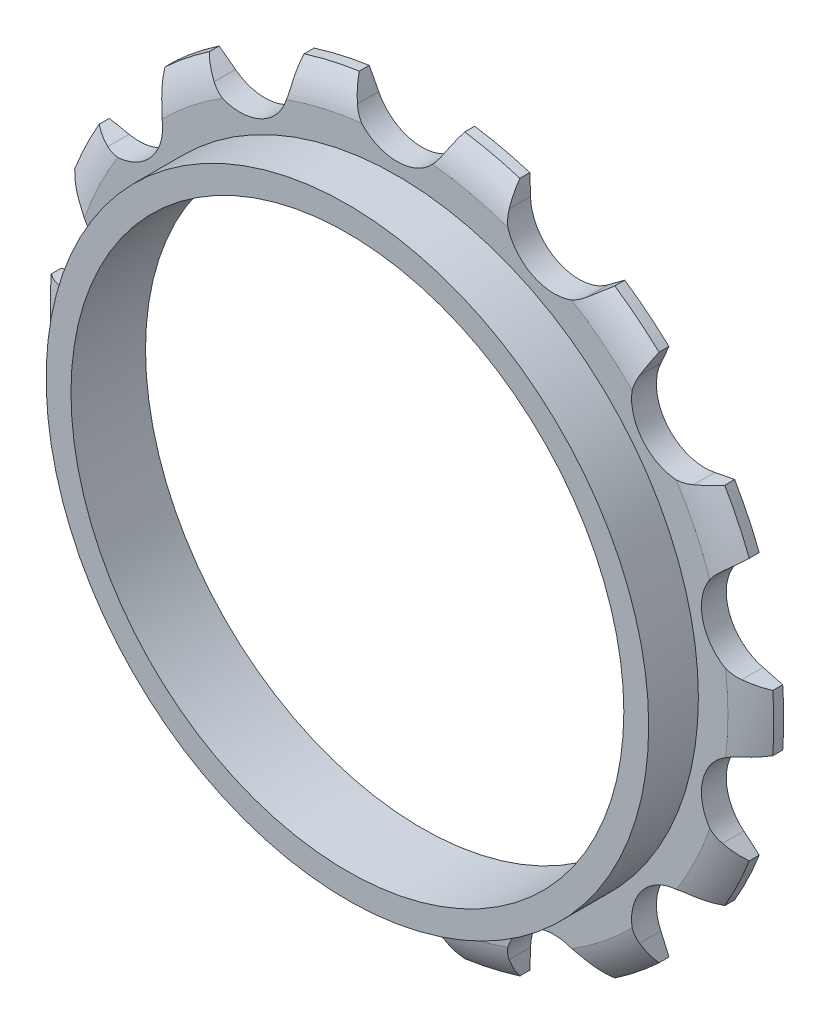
ISO-10303-21;
HEADER;
FILE_DESCRIPTION(('STEP AP214'),'2;1');
FILE_NAME('part.step','',(''),(''),'','','');
FILE_SCHEMA(('AUTOMOTIVE_DESIGN { 1 0 10303 214 1 1 1 1 }'));
ENDSEC;
DATA;
#1=APPLICATION_CONTEXT('core data for automotive mechanical design processes');
#2=APPLICATION_PROTOCOL_DEFINITION('international standard','automotive_design',2000,#1);
#3=PRODUCT_CONTEXT('',#1,'mechanical');
#4=PRODUCT('Part','Part','',(#3));
#5=PRODUCT_RELATED_PRODUCT_CATEGORY('part','',(#4));
#6=PRODUCT_DEFINITION_FORMATION('','',#4);
#7=PRODUCT_DEFINITION_CONTEXT('part definition',#1,'design');
#8=PRODUCT_DEFINITION('design','',#6,#7);
#9=PRODUCT_DEFINITION_SHAPE('','',#8);
#10=(LENGTH_UNIT() NAMED_UNIT(*) SI_UNIT(.MILLI.,.METRE.));
#11=(NAMED_UNIT(*) PLANE_ANGLE_UNIT() SI_UNIT($,.RADIAN.));
#12=(NAMED_UNIT(*) SI_UNIT($,.STERADIAN.) SOLID_ANGLE_UNIT());
#13=UNCERTAINTY_MEASURE_WITH_UNIT(LENGTH_MEASURE(1.E-05),#10,'distance_accuracy_value','');
#14=(GEOMETRIC_REPRESENTATION_CONTEXT(3) GLOBAL_UNCERTAINTY_ASSIGNED_CONTEXT((#13)) GLOBAL_UNIT_ASSIGNED_CONTEXT((#10,
#11,#12)) REPRESENTATION_CONTEXT('',''));
#15=CARTESIAN_POINT('',(0.,0.,0.));
#16=DIRECTION('',(0.,0.,1.));
#17=DIRECTION('',(1.,0.,0.));
#18=AXIS2_PLACEMENT_3D('',#15,#16,#17);
#19=CARTESIAN_POINT('',(0.,22.25,1.2));
#20=DIRECTION('',(0.,0.,1.));
#21=DIRECTION('',(1.,0.,0.));
#22=AXIS2_PLACEMENT_3D('',#19,#20,#21);
#23=PLANE('',#22);
#24=CARTESIAN_POINT('',(12.6368639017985,26.2407182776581,1.2));
#25=DIRECTION('',(0.,0.,1.));
#26=DIRECTION('',(0.900968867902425,-0.433883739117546,0.));
#27=AXIS2_PLACEMENT_3D('',#24,#25,#26);
#28=CIRCLE('',#27,3.89999999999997);
#29=CARTESIAN_POINT('',(8.91059116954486,25.0896789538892,1.2));
#30=VERTEX_POINT('',#29);
#31=CARTESIAN_POINT('',(14.0602381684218,22.6097396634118,1.2));
#32=VERTEX_POINT('',#31);
#33=EDGE_CURVE('E499',#30,#32,#28,.T.);
#34=ORIENTED_EDGE('',*,*,#33,.F.);
#35=CARTESIAN_POINT('',(0.,0.,1.20000000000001));
#36=DIRECTION('',(0.,0.,-1.));
#37=DIRECTION('',(-1.,0.,0.));
#38=AXIS2_PLACEMENT_3D('',#35,#36,#37);
#39=CIRCLE('',#38,26.625);
#40=CARTESIAN_POINT('',(2.85783847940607,26.4711802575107,1.2));
#41=VERTEX_POINT('',#40);
#42=EDGE_CURVE('E898',#41,#30,#39,.T.);
#43=ORIENTED_EDGE('',*,*,#42,.F.);
#44=CARTESIAN_POINT('',(0.,29.125,1.2));
#45=DIRECTION('',(0.,0.,1.));
#46=DIRECTION('',(1.,0.,0.));
#47=AXIS2_PLACEMENT_3D('',#44,#45,#46);
#48=CIRCLE('',#47,3.89999999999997);
#49=CARTESIAN_POINT('',(-2.85783847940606,26.4711802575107,1.2));
#50=VERTEX_POINT('',#49);
#51=EDGE_CURVE('E1110',#50,#41,#48,.T.);
#52=ORIENTED_EDGE('',*,*,#51,.F.);
#53=CARTESIAN_POINT('',(-8.91059116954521,25.089678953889,1.2));
#54=VERTEX_POINT('',#53);
#55=EDGE_CURVE('E896',#54,#50,#39,.T.);
#56=ORIENTED_EDGE('',*,*,#55,.F.);
#57=CARTESIAN_POINT('',(-12.6368639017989,26.2407182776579,1.2));
#58=DIRECTION('',(0.,0.,1.));
#59=DIRECTION('',(0.900968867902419,0.433883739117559,0.));
#60=AXIS2_PLACEMENT_3D('',#57,#58,#59);
#61=CIRCLE('',#60,3.89999999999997);
#62=CARTESIAN_POINT('',(-14.0602381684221,22.6097396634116,1.2));
#63=VERTEX_POINT('',#62);
#64=EDGE_CURVE('E828',#63,#54,#61,.T.);
#65=ORIENTED_EDGE('',*,*,#64,.F.);
#66=CARTESIAN_POINT('',(-18.9141689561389,18.7388590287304,1.2));
#67=VERTEX_POINT('',#66);
#68=EDGE_CURVE('E1270',#67,#63,#39,.T.);
#69=ORIENTED_EDGE('',*,*,#68,.F.);
#70=CARTESIAN_POINT('',(-22.7708419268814,18.1591404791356,1.2));
#71=DIRECTION('',(0.,0.,1.));
#72=DIRECTION('',(0.623489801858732,0.781831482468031,0.));
#73=AXIS2_PLACEMENT_3D('',#70,#71,#72);
#74=CIRCLE('',#73,3.89999999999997);
#75=CARTESIAN_POINT('',(-22.4778352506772,14.2701628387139,1.2));
#76=VERTEX_POINT('',#75);
#77=EDGE_CURVE('E2018',#76,#67,#74,.T.);
#78=ORIENTED_EDGE('',*,*,#77,.F.);
#79=CARTESIAN_POINT('',(-25.1715636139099,8.6765782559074,1.2));
#80=VERTEX_POINT('',#79);
#81=EDGE_CURVE('E1265',#80,#76,#39,.T.);
#82=ORIENTED_EDGE('',*,*,#81,.F.);
#83=CARTESIAN_POINT('',(-28.3947754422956,6.48092220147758,1.2));
#84=DIRECTION('',(0.,0.,1.));
#85=DIRECTION('',(0.222520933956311,0.974927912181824,0.));
#86=AXIS2_PLACEMENT_3D('',#83,#84,#85);
#87=CIRCLE('',#86,3.89999999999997);
#88=CARTESIAN_POINT('',(-26.4434213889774,3.10420525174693,1.2));
#89=VERTEX_POINT('',#88);
#90=EDGE_CURVE('E771',#89,#80,#87,.T.);
#91=ORIENTED_EDGE('',*,*,#90,.F.);
#92=CARTESIAN_POINT('',(-26.4434213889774,-3.1042052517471,1.2));
#93=VERTEX_POINT('',#92);
#94=EDGE_CURVE('E1260',#93,#89,#39,.T.);
#95=ORIENTED_EDGE('',*,*,#94,.F.);
#96=CARTESIAN_POINT('',(-28.3947754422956,-6.48092220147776,1.2));
#97=DIRECTION('',(0.,0.,1.));
#98=DIRECTION('',(-0.222520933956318,0.974927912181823,0.));
#99=AXIS2_PLACEMENT_3D('',#96,#97,#98);
#100=CIRCLE('',#99,3.89999999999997);
#101=CARTESIAN_POINT('',(-25.1715636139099,-8.67657825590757,1.2));
#102=VERTEX_POINT('',#101);
#103=EDGE_CURVE('E1995',#102,#93,#100,.T.);
#104=ORIENTED_EDGE('',*,*,#103,.F.);
#105=CARTESIAN_POINT('',(-22.4778352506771,-14.2701628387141,1.2));
#106=VERTEX_POINT('',#105);
#107=EDGE_CURVE('E1255',#106,#102,#39,.T.);
#108=ORIENTED_EDGE('',*,*,#107,.F.);
#109=CARTESIAN_POINT('',(-22.7708419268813,-18.1591404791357,1.2));
#110=DIRECTION('',(0.,0.,1.));
#111=DIRECTION('',(-0.623489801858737,0.781831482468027,0.));
#112=AXIS2_PLACEMENT_3D('',#109,#110,#111);
#113=CIRCLE('',#112,3.89999999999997);
#114=CARTESIAN_POINT('',(-18.9141689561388,-18.7388590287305,1.2));
#115=VERTEX_POINT('',#114);
#116=EDGE_CURVE('E714',#115,#106,#113,.T.);
#117=ORIENTED_EDGE('',*,*,#116,.F.);
#118=CARTESIAN_POINT('',(-14.060238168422,-22.6097396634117,1.2));
#119=VERTEX_POINT('',#118);
#120=EDGE_CURVE('E1250',#119,#115,#39,.T.);
#121=ORIENTED_EDGE('',*,*,#120,.F.);
#122=CARTESIAN_POINT('',(-12.6368639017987,-26.240718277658,1.2));
#123=DIRECTION('',(0.,0.,1.));
#124=DIRECTION('',(-0.900968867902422,0.433883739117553,0.));
#125=AXIS2_PLACEMENT_3D('',#122,#123,#124);
#126=CIRCLE('',#125,3.89999999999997);
#127=CARTESIAN_POINT('',(-8.91059116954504,-25.0896789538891,1.2));
#128=VERTEX_POINT('',#127);
#129=EDGE_CURVE('E1970',#128,#119,#126,.T.);
#130=ORIENTED_EDGE('',*,*,#129,.F.);
#131=CARTESIAN_POINT('',(-2.85783847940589,-26.4711802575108,1.2));
#132=VERTEX_POINT('',#131);
#133=EDGE_CURVE('E1245',#132,#128,#39,.T.);
#134=ORIENTED_EDGE('',*,*,#133,.F.);
#135=CARTESIAN_POINT('',(1.97384141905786E-13,-29.125,1.2));
#136=DIRECTION('',(0.,0.,1.));
#137=DIRECTION('',(-1.,0.,0.));
#138=AXIS2_PLACEMENT_3D('',#135,#136,#137);
#139=CIRCLE('',#138,3.89999999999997);
#140=CARTESIAN_POINT('',(2.85783847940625,-26.4711802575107,1.2));
#141=VERTEX_POINT('',#140);
#142=EDGE_CURVE('E657',#141,#132,#139,.T.);
#143=ORIENTED_EDGE('',*,*,#142,.F.);
#144=CARTESIAN_POINT('',(8.91059116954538,-25.089678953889,1.2));
#145=VERTEX_POINT('',#144);
#146=EDGE_CURVE('E1240',#145,#141,#39,.T.);
#147=ORIENTED_EDGE('',*,*,#146,.F.);
#148=CARTESIAN_POINT('',(12.6368639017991,-26.2407182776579,1.2));
#149=DIRECTION('',(0.,0.,1.));
#150=DIRECTION('',(-0.900968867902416,-0.433883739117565,0.));
#151=AXIS2_PLACEMENT_3D('',#148,#149,#150);
#152=CIRCLE('',#151,3.89999999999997);
#153=CARTESIAN_POINT('',(14.0602381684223,-22.6097396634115,1.2));
#154=VERTEX_POINT('',#153);
#155=EDGE_CURVE('E1424',#154,#145,#152,.T.);
#156=ORIENTED_EDGE('',*,*,#155,.F.);
#157=CARTESIAN_POINT('',(18.9141689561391,-18.7388590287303,1.2));
#158=VERTEX_POINT('',#157);
#159=EDGE_CURVE('E1235',#158,#154,#39,.T.);
#160=ORIENTED_EDGE('',*,*,#159,.F.);
#161=CARTESIAN_POINT('',(22.7708419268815,-18.1591404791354,1.2));
#162=DIRECTION('',(0.,0.,1.));
#163=DIRECTION('',(-0.623489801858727,-0.781831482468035,0.));
#164=AXIS2_PLACEMENT_3D('',#161,#162,#163);
#165=CIRCLE('',#164,3.89999999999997);
#166=CARTESIAN_POINT('',(22.4778352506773,-14.2701628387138,1.2));
#167=VERTEX_POINT('',#166);
#168=EDGE_CURVE('E600',#167,#158,#165,.T.);
#169=ORIENTED_EDGE('',*,*,#168,.F.);
#170=CARTESIAN_POINT('',(25.17156361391,-8.67657825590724,1.2));
#171=VERTEX_POINT('',#170);
#172=EDGE_CURVE('E1231',#171,#167,#39,.T.);
#173=ORIENTED_EDGE('',*,*,#172,.F.);
#174=CARTESIAN_POINT('',(28.3947754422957,-6.48092220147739,1.2));
#175=DIRECTION('',(0.,0.,1.));
#176=DIRECTION('',(-0.222520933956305,-0.974927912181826,0.));
#177=AXIS2_PLACEMENT_3D('',#174,#175,#176);
#178=CIRCLE('',#177,3.89999999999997);
#179=CARTESIAN_POINT('',(26.4434213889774,-3.10420525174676,1.2));
#180=VERTEX_POINT('',#179);
#181=EDGE_CURVE('E1399',#180,#171,#178,.T.);
#182=ORIENTED_EDGE('',*,*,#181,.F.);
#183=CARTESIAN_POINT('',(26.4434213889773,3.10420525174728,1.2));
#184=VERTEX_POINT('',#183);
#185=EDGE_CURVE('E1230',#184,#180,#39,.T.);
#186=ORIENTED_EDGE('',*,*,#185,.F.);
#187=CARTESIAN_POINT('',(28.3947754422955,6.48092220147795,1.2));
#188=DIRECTION('',(0.,0.,1.));
#189=DIRECTION('',(0.222520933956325,-0.974927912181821,0.));
#190=AXIS2_PLACEMENT_3D('',#187,#188,#189);
#191=CIRCLE('',#190,3.89999999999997);
#192=CARTESIAN_POINT('',(25.1715636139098,8.67657825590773,1.2));
#193=VERTEX_POINT('',#192);
#194=EDGE_CURVE('E543',#193,#184,#191,.T.);
#195=ORIENTED_EDGE('',*,*,#194,.F.);
#196=CARTESIAN_POINT('',(22.477835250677,14.2701628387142,1.2));
#197=VERTEX_POINT('',#196);
#198=EDGE_CURVE('E1223',#197,#193,#39,.T.);
#199=ORIENTED_EDGE('',*,*,#198,.F.);
#200=CARTESIAN_POINT('',(22.7708419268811,18.1591404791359,1.2));
#201=DIRECTION('',(0.,0.,1.));
#202=DIRECTION('',(0.623489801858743,-0.781831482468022,0.));
#203=AXIS2_PLACEMENT_3D('',#200,#201,#202);
#204=CIRCLE('',#203,3.89999999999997);
#205=CARTESIAN_POINT('',(18.9141689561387,18.7388590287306,1.2));
#206=VERTEX_POINT('',#205);
#207=EDGE_CURVE('E1219',#206,#197,#204,.T.);
#208=ORIENTED_EDGE('',*,*,#207,.F.);
#209=EDGE_CURVE('E902',#32,#206,#39,.T.);
#210=ORIENTED_EDGE('',*,*,#209,.F.);
#211=EDGE_LOOP('',(#34,#43,#52,#56,#65,#69,#78,#82,#91,#95,#104,#108,#117,#121,#130,#134,#143,
#147,#156,#160,#169,#173,#182,#186,#195,#199,#208,#210));
#212=FACE_BOUND('',#211,.T.);
#213=CARTESIAN_POINT('',(0.,0.,1.2));
#214=DIRECTION('',(0.,0.,1.));
#215=DIRECTION('',(1.,0.,0.));
#216=AXIS2_PLACEMENT_3D('',#213,#214,#215);
#217=CIRCLE('',#216,24.25);
#218=CARTESIAN_POINT('',(24.25,0.,1.2));
#219=VERTEX_POINT('',#218);
#220=EDGE_CURVE('E1359',#219,#219,#217,.T.);
#221=ORIENTED_EDGE('',*,*,#220,.F.);
#222=EDGE_LOOP('',(#221));
#223=FACE_BOUND('',#222,.T.);
#224=ADVANCED_FACE('F37',(#212,#223),#23,.T.);
#225=CARTESIAN_POINT('',(0.,0.,-4.19822890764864));
#226=DIRECTION('',(0.,0.,-1.));
#227=DIRECTION('',(-1.,0.,0.));
#228=AXIS2_PLACEMENT_3D('',#225,#226,#227);
#229=TOROIDAL_SURFACE('',#228,25.5718501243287,5.5);
#230=CARTESIAN_POINT('',(15.0113086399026,23.1468514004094,0.918781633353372));
#231=CARTESIAN_POINT('',(15.1283399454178,23.2366878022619,0.863993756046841));
#232=CARTESIAN_POINT('',(15.2440813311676,23.3247125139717,0.80346305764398));
#233=CARTESIAN_POINT('',(15.4714491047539,23.4961531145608,0.671644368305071));
#234=CARTESIAN_POINT('',(15.5830966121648,23.5795942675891,0.600425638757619));
#235=CARTESIAN_POINT('',(15.8022245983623,23.7420160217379,0.447264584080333));
#236=CARTESIAN_POINT('',(15.9097048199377,23.8209963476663,0.365321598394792));
#237=CARTESIAN_POINT('',(16.1203157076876,23.9745542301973,0.190569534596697));
#238=CARTESIAN_POINT('',(16.2234149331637,24.0491011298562,0.0976956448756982));
#239=CARTESIAN_POINT('',(16.3235552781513,24.120964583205,-0.00020000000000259));
#240=B_SPLINE_CURVE_WITH_KNOTS('',3,(#230,#231,#232,#233,#234,#235,#236,#237,#238,#239),
.UNSPECIFIED.,.F.,.F.,(4,2,2,2,4),(0.,0.472030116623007,0.94112382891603,1.41024644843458,
1.88230582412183),.UNSPECIFIED.);
#241=CARTESIAN_POINT('',(15.0115086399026,23.1470049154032,0.918687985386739));
#242=VERTEX_POINT('',#241);
#243=CARTESIAN_POINT('',(16.3233506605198,24.1208177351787,0.));
#244=VERTEX_POINT('',#243);
#245=EDGE_CURVE('E512',#242,#244,#240,.T.);
#246=ORIENTED_EDGE('',*,*,#245,.F.);
#247=CARTESIAN_POINT('',(8.77717824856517,26.8000273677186,0.632823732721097));
#248=CARTESIAN_POINT('',(8.76501323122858,26.7161965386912,0.67825892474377));
#249=CARTESIAN_POINT('',(8.75542424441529,26.6306647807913,0.721282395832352));
#250=CARTESIAN_POINT('',(8.74188524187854,26.456839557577,0.802399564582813));
#251=CARTESIAN_POINT('',(8.73793654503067,26.3685454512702,0.840492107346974));
#252=CARTESIAN_POINT('',(8.73617410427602,26.1901716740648,0.911501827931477));
#253=CARTESIAN_POINT('',(8.73834006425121,26.1000988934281,0.94443574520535));
#254=CARTESIAN_POINT('',(8.74912179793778,25.918668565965,1.00529075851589));
#255=CARTESIAN_POINT('',(8.75773665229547,25.8273112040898,1.0332125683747));
#256=CARTESIAN_POINT('',(8.7816826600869,25.6439411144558,1.08422667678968));
#257=CARTESIAN_POINT('',(8.79702641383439,25.5519274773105,1.10730979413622));
#258=CARTESIAN_POINT('',(8.83455747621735,25.3682158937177,1.14884357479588));
#259=CARTESIAN_POINT('',(8.85674746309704,25.2765180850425,1.16729242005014));
#260=CARTESIAN_POINT('',(8.90797544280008,25.0942679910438,1.1999167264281));
#261=CARTESIAN_POINT('',(8.93701437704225,25.0037158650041,1.21409159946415));
#262=CARTESIAN_POINT('',(9.00183110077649,24.8245148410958,1.23863113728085));
#263=CARTESIAN_POINT('',(9.03761135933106,24.7358666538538,1.24899440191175));
#264=CARTESIAN_POINT('',(9.15466613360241,24.4741690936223,1.27511152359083));
#265=CARTESIAN_POINT('',(9.24577836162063,24.3049249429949,1.28596573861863));
#266=CARTESIAN_POINT('',(9.45191203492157,23.9817849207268,1.29913422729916));
#267=CARTESIAN_POINT('',(9.56689341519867,23.8278639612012,1.30146269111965));
#268=CARTESIAN_POINT('',(9.73347102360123,23.6360590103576,1.30183264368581));
#269=CARTESIAN_POINT('',(9.77567219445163,23.5897723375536,1.30170432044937));
#270=CARTESIAN_POINT('',(9.8945962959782,23.4654855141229,1.30093042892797));
#271=CARTESIAN_POINT('',(9.97357028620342,23.3896081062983,1.29997022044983));
#272=CARTESIAN_POINT('',(10.1376492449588,23.2447344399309,1.29775622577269));
#273=CARTESIAN_POINT('',(10.2227577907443,23.1757422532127,1.29650226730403));
#274=CARTESIAN_POINT('',(10.3986840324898,23.0450046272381,1.29419495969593));
#275=CARTESIAN_POINT('',(10.4895144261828,22.9832762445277,1.29314207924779));
#276=CARTESIAN_POINT('',(10.6760438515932,22.8677045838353,1.29157498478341));
#277=CARTESIAN_POINT('',(10.7717421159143,22.8138600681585,1.2910606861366));
#278=CARTESIAN_POINT('',(10.9672254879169,22.7144857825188,1.29071768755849));
#279=CARTESIAN_POINT('',(11.0670057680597,22.6689465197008,1.29088819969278));
#280=CARTESIAN_POINT('',(11.2700478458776,22.5864299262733,1.29186531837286));
#281=CARTESIAN_POINT('',(11.3733098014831,22.5494529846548,1.29267195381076));
#282=CARTESIAN_POINT('',(11.5825467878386,22.4843347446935,1.29468178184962));
#283=CARTESIAN_POINT('',(11.6885210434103,22.4561909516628,1.2958848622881));
#284=CARTESIAN_POINT('',(11.9025130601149,22.4089117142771,1.29827162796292));
#285=CARTESIAN_POINT('',(12.0105317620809,22.3897805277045,1.29945530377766));
#286=CARTESIAN_POINT('',(12.2279413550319,22.3606633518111,1.30123153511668));
#287=CARTESIAN_POINT('',(12.3373338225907,22.3506890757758,1.30182333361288));
#288=CARTESIAN_POINT('',(12.5565688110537,22.3400008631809,1.30171166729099));
#289=CARTESIAN_POINT('',(12.6664113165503,22.339286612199,1.30100824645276));
#290=CARTESIAN_POINT('',(12.8855575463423,22.3471142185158,1.29751386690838));
#291=CARTESIAN_POINT('',(12.9948618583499,22.3556409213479,1.29472632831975));
#292=CARTESIAN_POINT('',(13.2122114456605,22.3818388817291,1.28622218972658));
#293=CARTESIAN_POINT('',(13.320257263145,22.3995060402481,1.28050690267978));
#294=CARTESIAN_POINT('',(13.5353623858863,22.4440237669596,1.26520860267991));
#295=CARTESIAN_POINT('',(13.6423993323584,22.4709690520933,1.25558550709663));
#296=CARTESIAN_POINT('',(13.8533342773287,22.5336573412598,1.23161975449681));
#297=CARTESIAN_POINT('',(13.9572323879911,22.5694000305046,1.21727726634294));
#298=CARTESIAN_POINT('',(14.1460404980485,22.6433415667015,1.1856085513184));
#299=CARTESIAN_POINT('',(14.2315130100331,22.6804255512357,1.1690205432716));
#300=CARTESIAN_POINT('',(14.3988080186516,22.7601813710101,1.13146588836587));
#301=CARTESIAN_POINT('',(14.4806308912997,22.802852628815,1.11049969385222));
#302=CARTESIAN_POINT('',(14.6401419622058,22.8932877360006,1.06387499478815));
#303=CARTESIAN_POINT('',(14.7178255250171,22.9410571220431,1.03821136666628));
#304=CARTESIAN_POINT('',(14.868430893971,23.0409873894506,0.982047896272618));
#305=CARTESIAN_POINT('',(14.9413543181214,23.0931467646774,0.951549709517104));
#306=CARTESIAN_POINT('',(15.0928358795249,23.209440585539,0.880592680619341));
#307=CARTESIAN_POINT('',(15.1705469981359,23.2741857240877,0.839323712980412));
#308=CARTESIAN_POINT('',(15.3185709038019,23.4072761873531,0.750487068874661));
#309=CARTESIAN_POINT('',(15.3889010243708,23.4756124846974,0.702934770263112));
#310=CARTESIAN_POINT('',(15.4554457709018,23.5452412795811,0.652259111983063));
#311=B_SPLINE_CURVE_WITH_KNOTS('',3,(#247,#248,#249,#250,#251,#252,#253,#254,#255,#256,#257,
#258,#259,#260,#261,#262,#263,#264,#265,#266,#267,#268,#269,#270,#271,#272,#273,#274,#275,#276,
#277,#278,#279,#280,#281,#282,#283,#284,#285,#286,#287,#288,#289,#290,#291,#292,#293,#294,#295,
#296,#297,#298,#299,#300,#301,#302,#303,#304,#305,#306,#307,#308,#309,#310),.UNSPECIFIED.,.F.,
.F.,(4,2,2,2,2,2,2,2,2,2,2,2,2,2,2,2,2,2,2,2,2,2,2,2,2,2,2,2,2,2,2,4),(0.,0.288321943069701,
0.576711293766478,0.864144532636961,1.15153680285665,1.43946954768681,1.72751507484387,
2.01560021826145,2.30379108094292,2.87879598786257,3.45284342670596,3.64071490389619,
3.96884770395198,4.29717342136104,4.62625533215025,4.95528552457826,5.28393724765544,
5.61260389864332,5.94117764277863,6.26990645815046,6.59905519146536,6.92819274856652,
7.25679136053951,7.58524274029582,7.91715176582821,8.24904891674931,8.53263413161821,
8.8161900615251,9.10005713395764,9.38382720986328,9.71104922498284,10.0374847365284),.UNSPECIFIED.);
#312=EDGE_CURVE('E12',#32,#242,#311,.T.);
#313=ORIENTED_EDGE('',*,*,#312,.F.);
#314=ORIENTED_EDGE('',*,*,#209,.T.);
#315=CARTESIAN_POINT('',(19.297416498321,19.9326442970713,0.854891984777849));
#316=CARTESIAN_POINT('',(19.2851572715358,19.9086340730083,0.86597000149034));
#317=CARTESIAN_POINT('',(19.2731048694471,19.8844147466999,0.876815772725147));
#318=CARTESIAN_POINT('',(19.2494192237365,19.8355417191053,0.898054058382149));
#319=CARTESIAN_POINT('',(19.2377864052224,19.8108876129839,0.90844611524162));
#320=CARTESIAN_POINT('',(19.189448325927,19.7055722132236,0.951495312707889));
#321=CARTESIAN_POINT('',(19.1548706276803,19.6230002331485,0.981954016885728));
#322=CARTESIAN_POINT('',(19.0910356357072,19.4541988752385,1.03805126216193));
#323=CARTESIAN_POINT('',(19.0617814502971,19.3679673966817,1.06368698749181));
#324=CARTESIAN_POINT('',(19.0090734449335,19.192347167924,1.11033918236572));
#325=CARTESIAN_POINT('',(18.9856302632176,19.1029529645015,1.13134717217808));
#326=CARTESIAN_POINT('',(18.9450212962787,18.9218412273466,1.16897127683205));
#327=CARTESIAN_POINT('',(18.9278561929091,18.8301234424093,1.18558691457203));
#328=CARTESIAN_POINT('',(18.8986191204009,18.6351781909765,1.21637425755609));
#329=CARTESIAN_POINT('',(18.8872871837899,18.5317679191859,1.23009522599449));
#330=CARTESIAN_POINT('',(18.8729300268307,18.3238926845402,1.25326825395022));
#331=CARTESIAN_POINT('',(18.8699061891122,18.2194275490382,1.26271960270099));
#332=CARTESIAN_POINT('',(18.8722797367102,18.0103544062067,1.27806814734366));
#333=CARTESIAN_POINT('',(18.8776754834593,17.9057464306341,1.28396603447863));
#334=CARTESIAN_POINT('',(18.8968813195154,17.6971763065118,1.29296151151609));
#335=CARTESIAN_POINT('',(18.9106939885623,17.5932143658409,1.29605824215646));
#336=CARTESIAN_POINT('',(18.9600926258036,17.3096480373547,1.30174705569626));
#337=CARTESIAN_POINT('',(19.0042338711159,17.1314280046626,1.30224205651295));
#338=CARTESIAN_POINT('',(19.1170852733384,16.7830668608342,1.30064662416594));
#339=CARTESIAN_POINT('',(19.1857842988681,16.6129221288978,1.29855736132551));
#340=CARTESIAN_POINT('',(19.3103533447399,16.3576810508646,1.29545430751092));
#341=CARTESIAN_POINT('',(19.3582108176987,16.2685927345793,1.29437756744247));
#342=CARTESIAN_POINT('',(19.4607109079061,16.0943792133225,1.29257463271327));
#343=CARTESIAN_POINT('',(19.515353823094,16.0092541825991,1.291848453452));
#344=CARTESIAN_POINT('',(19.6311224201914,15.8434563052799,1.29093476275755));
#345=CARTESIAN_POINT('',(19.6922520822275,15.7627862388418,1.29074758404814));
#346=CARTESIAN_POINT('',(19.8205958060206,15.6064405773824,1.29095614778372));
#347=CARTESIAN_POINT('',(19.8878099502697,15.5307650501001,1.29135189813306));
#348=CARTESIAN_POINT('',(20.0331128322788,15.3794570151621,1.29267955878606));
#349=CARTESIAN_POINT('',(20.1116383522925,15.3042436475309,1.29364904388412));
#350=CARTESIAN_POINT('',(20.2746955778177,15.1606308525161,1.29585708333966));
#351=CARTESIAN_POINT('',(20.3592277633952,15.0922319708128,1.29709565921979));
#352=CARTESIAN_POINT('',(20.5337872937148,14.9626730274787,1.29938946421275));
#353=CARTESIAN_POINT('',(20.6238193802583,14.9015193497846,1.30044453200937));
#354=CARTESIAN_POINT('',(20.8086764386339,14.7869370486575,1.30174392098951));
#355=CARTESIAN_POINT('',(20.9035014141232,14.733508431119,1.30198824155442));
#356=CARTESIAN_POINT('',(21.0004050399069,14.6841508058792,1.30151414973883));
#357=B_SPLINE_CURVE_WITH_KNOTS('',3,(#315,#316,#317,#318,#319,#320,#321,#322,#323,#324,#325,
#326,#327,#328,#329,#330,#331,#332,#333,#334,#335,#336,#337,#338,#339,#340,#341,#342,#343,#344,
#345,#346,#347,#348,#349,#350,#351,#352,#353,#354,#355,#356),.UNSPECIFIED.,.F.,.F.,(4,2,2,2,2,2,
2,2,2,2,2,2,2,2,2,2,2,2,2,2,4),(0.,0.0874301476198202,0.174946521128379,0.458243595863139,
0.7417055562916,1.02568268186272,1.30969064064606,1.62404026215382,1.93844219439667,
2.25278294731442,2.56722009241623,3.11605763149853,3.66464671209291,3.96778595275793,
4.27093850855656,4.57427815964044,4.87762192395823,5.20345510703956,5.52931436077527,
5.85545863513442,6.18160315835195),.UNSPECIFIED.);
#358=CARTESIAN_POINT('',(19.2262862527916,19.7858319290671,0.918687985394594));
#359=VERTEX_POINT('',#358);
#360=EDGE_CURVE('E1078',#359,#206,#357,.T.);
#361=ORIENTED_EDGE('',*,*,#360,.F.);
#362=CARTESIAN_POINT('',(19.8838688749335,21.2817092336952,-0.000200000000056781));
#363=CARTESIAN_POINT('',(19.8360913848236,21.1680905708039,0.0976938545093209));
#364=CARTESIAN_POINT('',(19.7863562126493,21.0509902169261,0.190566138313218));
#365=CARTESIAN_POINT('',(19.6835156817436,20.81149451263,0.365315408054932));
#366=CARTESIAN_POINT('',(19.6304332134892,20.6891366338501,0.447257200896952));
#367=CARTESIAN_POINT('',(19.5208465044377,20.4393652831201,0.600416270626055));
#368=CARTESIAN_POINT('',(19.4643424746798,20.3119521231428,0.671634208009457));
#369=CARTESIAN_POINT('',(19.3477968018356,20.0521409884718,0.80345170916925));
#370=CARTESIAN_POINT('',(19.2877352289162,19.9197168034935,0.863982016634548));
#371=CARTESIAN_POINT('',(19.2261944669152,19.7856319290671,0.918769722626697));
#372=B_SPLINE_CURVE_WITH_KNOTS('',3,(#362,#363,#364,#365,#366,#367,#368,#369,#370,#371),
.UNSPECIFIED.,.F.,.F.,(4,2,2,2,4),(0.,0.472050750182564,0.941164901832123,1.41025014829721,
1.8822716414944),.UNSPECIFIED.);
#373=CARTESIAN_POINT('',(19.8837712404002,21.2814770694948,0.));
#374=VERTEX_POINT('',#373);
#375=EDGE_CURVE('E544',#374,#359,#372,.T.);
#376=ORIENTED_EDGE('',*,*,#375,.F.);
#377=CARTESIAN_POINT('',(0.,0.,0.));
#378=DIRECTION('',(0.,0.,-1.));
#379=DIRECTION('',(-1.,0.,0.));
#380=AXIS2_PLACEMENT_3D('',#377,#378,#379);
#381=CIRCLE('',#380,29.125);
#382=EDGE_CURVE('E897',#244,#374,#381,.T.);
#383=ORIENTED_EDGE('',*,*,#382,.F.);
#384=EDGE_LOOP('',(#246,#313,#314,#361,#376,#383));
#385=FACE_BOUND('',#384,.T.);
#386=ADVANCED_FACE('F1205',(#385),#229,.T.);
#387=CARTESIAN_POINT('',(0.,0.,-80.9));
#388=DIRECTION('',(0.,0.,-1.));
#389=DIRECTION('',(-1.,0.,0.));
#390=AXIS2_PLACEMENT_3D('',#387,#388,#389);
#391=CYLINDRICAL_SURFACE('',#390,29.125);
#392=DIRECTION('',(0.,0.,1.));
#393=VECTOR('',#392,1.);
#394=CARTESIAN_POINT('',(16.3233506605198,24.1208177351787,-0.400000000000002));
#395=LINE('',#394,#393);
#396=CARTESIAN_POINT('',(16.3233506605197,24.1208177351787,-0.799999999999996));
#397=VERTEX_POINT('',#396);
#398=EDGE_CURVE('E1090',#244,#397,#395,.F.);
#399=ORIENTED_EDGE('',*,*,#398,.F.);
#400=ORIENTED_EDGE('',*,*,#382,.T.);
#401=DIRECTION('',(0.,0.,1.));
#402=VECTOR('',#401,1.);
#403=CARTESIAN_POINT('',(19.8837712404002,21.2814770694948,-0.400000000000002));
#404=LINE('',#403,#402);
#405=CARTESIAN_POINT('',(19.8837712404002,21.2814770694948,-0.799999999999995));
#406=VERTEX_POINT('',#405);
#407=EDGE_CURVE('E1073',#406,#374,#404,.T.);
#408=ORIENTED_EDGE('',*,*,#407,.F.);
#409=CARTESIAN_POINT('',(0.,0.,-0.799999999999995));
#410=DIRECTION('',(0.,0.,-1.));
#411=DIRECTION('',(-1.,0.,0.));
#412=AXIS2_PLACEMENT_3D('',#409,#410,#411);
#413=CIRCLE('',#412,29.125);
#414=EDGE_CURVE('E65',#397,#406,#413,.T.);
#415=ORIENTED_EDGE('',*,*,#414,.F.);
#416=EDGE_LOOP('',(#399,#400,#408,#415));
#417=FACE_BOUND('',#416,.T.);
#418=ADVANCED_FACE('F1196',(#417),#391,.T.);
#419=CARTESIAN_POINT('',(23.5678109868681,14.3414395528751,0.918763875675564));
#420=CARTESIAN_POINT('',(23.7122267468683,14.3716003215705,0.863976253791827));
#421=CARTESIAN_POINT('',(23.8546943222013,14.4006885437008,0.803446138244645));
#422=CARTESIAN_POINT('',(24.1339225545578,14.4564981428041,0.671629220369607));
#423=CARTESIAN_POINT('',(24.2707131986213,14.4832331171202,0.600411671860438));
#424=CARTESIAN_POINT('',(24.5386050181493,14.5344923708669,0.447253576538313));
#425=CARTESIAN_POINT('',(24.6697058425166,14.5590165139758,0.36531236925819));
#426=CARTESIAN_POINT('',(24.9260786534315,14.6059853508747,0.190564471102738));
#427=CARTESIAN_POINT('',(25.0513090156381,14.6284160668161,0.0976929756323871));
#428=CARTESIAN_POINT('',(25.1727094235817,14.649712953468,-0.000200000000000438));
#429=B_SPLINE_CURVE_WITH_KNOTS('',3,(#419,#420,#421,#422,#423,#424,#425,#426,#427,#428),
.UNSPECIFIED.,.F.,.F.,(4,2,2,2,4),(0.,0.472017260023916,0.941098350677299,1.41020834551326,
1.88225486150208),.UNSPECIFIED.);
#430=CARTESIAN_POINT('',(23.5680109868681,14.3414813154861,0.918687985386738));
#431=VERTEX_POINT('',#430);
#432=CARTESIAN_POINT('',(25.1724613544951,14.6496694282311,0.));
#433=VERTEX_POINT('',#432);
#434=EDGE_CURVE('E537',#431,#433,#429,.T.);
#435=ORIENTED_EDGE('',*,*,#434,.F.);
#436=CARTESIAN_POINT('',(22.4765591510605,14.2702591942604,1.2002));
#437=CARTESIAN_POINT('',(22.5700776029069,14.2631632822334,1.18556836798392));
#438=CARTESIAN_POINT('',(22.6635442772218,14.2595020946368,1.16889492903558));
#439=CARTESIAN_POINT('',(22.8489431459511,14.2588334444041,1.1312836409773));
#440=CARTESIAN_POINT('',(22.9408815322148,14.2617786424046,1.11037710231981));
#441=CARTESIAN_POINT('',(23.1231539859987,14.274012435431,1.06391767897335));
#442=CARTESIAN_POINT('',(23.2134879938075,14.2833012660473,1.03836462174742));
#443=CARTESIAN_POINT('',(23.3924766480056,14.307929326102,0.982268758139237));
#444=CARTESIAN_POINT('',(23.4811145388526,14.3233115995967,0.951691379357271));
#445=CARTESIAN_POINT('',(23.5682109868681,14.3415230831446,0.918612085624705));
#446=B_SPLINE_CURVE_WITH_KNOTS('',3,(#436,#437,#438,#439,#440,#441,#442,#443,#444,#445),
.UNSPECIFIED.,.F.,.F.,(4,2,2,2,4),(0.,0.284693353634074,0.567353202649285,0.850023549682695,
1.13472734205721),.UNSPECIFIED.);
#447=EDGE_CURVE('E1084',#197,#431,#446,.T.);
#448=ORIENTED_EDGE('',*,*,#447,.F.);
#449=ORIENTED_EDGE('',*,*,#198,.T.);
#450=CARTESIAN_POINT('',(25.9072775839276,9.48464562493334,0.918571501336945));
#451=CARTESIAN_POINT('',(25.83872742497,9.42790209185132,0.951656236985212));
#452=CARTESIAN_POINT('',(25.7714282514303,9.36818876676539,0.9822385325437));
#453=CARTESIAN_POINT('',(25.6405602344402,9.24359577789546,1.03834311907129));
#454=CARTESIAN_POINT('',(25.5769681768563,9.17875606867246,1.06389999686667));
#455=CARTESIAN_POINT('',(25.4537442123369,9.04386576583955,1.11036606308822));
#456=CARTESIAN_POINT('',(25.3941121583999,8.97381536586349,1.13127542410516));
#457=CARTESIAN_POINT('',(25.2790278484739,8.82843387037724,1.16889148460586));
#458=CARTESIAN_POINT('',(25.2236087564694,8.75306840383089,1.18556686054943));
#459=CARTESIAN_POINT('',(25.1708433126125,8.67552048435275,1.20019999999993));
#460=B_SPLINE_CURVE_WITH_KNOTS('',3,(#450,#451,#452,#453,#454,#455,#456,#457,#458,#459),
.UNSPECIFIED.,.F.,.F.,(4,2,2,2,4),(0.,0.284733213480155,0.567432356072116,0.850120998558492,
1.13484377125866),.UNSPECIFIED.);
#461=CARTESIAN_POINT('',(25.9070360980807,9.48444562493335,0.918687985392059));
#462=VERTEX_POINT('',#461);
#463=EDGE_CURVE('E1062',#462,#193,#460,.T.);
#464=ORIENTED_EDGE('',*,*,#463,.F.);
#465=CARTESIAN_POINT('',(27.1485344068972,10.5468700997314,-0.000200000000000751));
#466=CARTESIAN_POINT('',(27.0561889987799,10.4652312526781,0.0976960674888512));
#467=CARTESIAN_POINT('',(26.9605689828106,10.3813048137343,0.190570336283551));
#468=CARTESIAN_POINT('',(26.7639948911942,10.2101434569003,0.365323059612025));
#469=CARTESIAN_POINT('',(26.66307770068,10.1229323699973,0.447266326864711));
#470=CARTESIAN_POINT('',(26.4559666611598,9.9454398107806,0.6004278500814));
#471=CARTESIAN_POINT('',(26.3497731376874,9.85515852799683,0.671646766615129));
#472=CARTESIAN_POINT('',(26.1320357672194,9.67163961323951,0.803465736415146));
#473=CARTESIAN_POINT('',(26.0204625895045,9.57838701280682,0.86399652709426));
#474=CARTESIAN_POINT('',(25.9068360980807,9.48427997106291,0.918784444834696));
#475=B_SPLINE_CURVE_WITH_KNOTS('',3,(#465,#466,#467,#468,#469,#470,#471,#472,#473,#474),
.UNSPECIFIED.,.F.,.F.,(4,2,2,2,4),(0.,0.472061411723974,0.941186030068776,1.41028174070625,
1.88231389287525),.UNSPECIFIED.);
#476=CARTESIAN_POINT('',(27.1483457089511,10.5467032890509,0.));
#477=VERTEX_POINT('',#476);
#478=EDGE_CURVE('E563',#477,#462,#475,.T.);
#479=ORIENTED_EDGE('',*,*,#478,.F.);
#480=EDGE_CURVE('E1184',#433,#477,#381,.T.);
#481=ORIENTED_EDGE('',*,*,#480,.F.);
#482=EDGE_LOOP('',(#435,#448,#449,#464,#479,#481));
#483=FACE_BOUND('',#482,.T.);
#484=ADVANCED_FACE('F1332',(#483),#229,.T.);
#485=DIRECTION('',(0.,0.,1.));
#486=VECTOR('',#485,1.);
#487=CARTESIAN_POINT('',(25.1724613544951,14.6496694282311,-0.400000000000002));
#488=LINE('',#487,#486);
#489=CARTESIAN_POINT('',(25.1724613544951,14.6496694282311,-0.799999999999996));
#490=VERTEX_POINT('',#489);
#491=EDGE_CURVE('E1076',#433,#490,#488,.F.);
#492=ORIENTED_EDGE('',*,*,#491,.F.);
#493=ORIENTED_EDGE('',*,*,#480,.T.);
#494=DIRECTION('',(0.,0.,1.));
#495=VECTOR('',#494,1.);
#496=CARTESIAN_POINT('',(27.1483457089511,10.546703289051,-0.400000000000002));
#497=LINE('',#496,#495);
#498=CARTESIAN_POINT('',(27.1483457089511,10.5467032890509,-0.799999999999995));
#499=VERTEX_POINT('',#498);
#500=EDGE_CURVE('E1057',#499,#477,#497,.T.);
#501=ORIENTED_EDGE('',*,*,#500,.F.);
#502=EDGE_CURVE('E1321',#490,#499,#413,.T.);
#503=ORIENTED_EDGE('',*,*,#502,.F.);
#504=EDGE_LOOP('',(#492,#493,#501,#503));
#505=FACE_BOUND('',#504,.T.);
#506=ADVANCED_FACE('F1329',(#505),#391,.T.);
#507=CARTESIAN_POINT('',(27.456379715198,2.69550102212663,0.918764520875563));
#508=CARTESIAN_POINT('',(27.5995802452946,2.66001525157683,0.863976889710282));
#509=CARTESIAN_POINT('',(27.7405601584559,2.62440843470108,0.803446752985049));
#510=CARTESIAN_POINT('',(28.0163512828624,2.55353848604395,0.67162977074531));
#511=CARTESIAN_POINT('',(28.1511954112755,2.51827459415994,0.600412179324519));
#512=CARTESIAN_POINT('',(28.4147984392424,2.44822361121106,0.44725397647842));
#513=CARTESIAN_POINT('',(28.543556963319,2.41343654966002,0.365312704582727));
#514=CARTESIAN_POINT('',(28.7949201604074,2.3445179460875,0.190564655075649));
#515=CARTESIAN_POINT('',(28.9174812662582,2.31039187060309,0.0976930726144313));
#516=CARTESIAN_POINT('',(29.0360997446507,2.27690600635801,-0.000200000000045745));
#517=B_SPLINE_CURVE_WITH_KNOTS('',3,(#507,#508,#509,#510,#511,#512,#513,#514,#515,#516),
.UNSPECIFIED.,.F.,.F.,(4,2,2,2,4),(0.,0.472017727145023,0.941099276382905,1.41020972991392,
1.88225671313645),.UNSPECIFIED.);
#518=CARTESIAN_POINT('',(27.456579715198,2.69545145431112,0.918687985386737));
#519=VERTEX_POINT('',#518);
#520=CARTESIAN_POINT('',(29.035857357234,2.27697442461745,0.));
#521=VERTEX_POINT('',#520);
#522=EDGE_CURVE('E571',#519,#521,#517,.T.);
#523=ORIENTED_EDGE('',*,*,#522,.F.);
#524=CARTESIAN_POINT('',(24.628545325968,7.49359722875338,1.29909710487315));
#525=CARTESIAN_POINT('',(24.6000948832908,7.3878352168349,1.30088978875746));
#526=CARTESIAN_POINT('',(24.5761218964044,7.28086453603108,1.30165736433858));
#527=CARTESIAN_POINT('',(24.537253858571,7.06529752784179,1.30186268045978));
#528=CARTESIAN_POINT('',(24.5223576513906,6.95670140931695,1.30130059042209));
#529=CARTESIAN_POINT('',(24.5017669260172,6.73873297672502,1.29956772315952));
#530=CARTESIAN_POINT('',(24.4960652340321,6.62936133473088,1.29839742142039));
#531=CARTESIAN_POINT('',(24.4938760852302,6.41052554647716,1.29601765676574));
#532=CARTESIAN_POINT('',(24.4973886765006,6.3010613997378,1.29480819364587));
#533=CARTESIAN_POINT('',(24.5136075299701,6.08278030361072,1.29277246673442));
#534=CARTESIAN_POINT('',(24.5263164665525,5.97396355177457,1.29194631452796));
#535=CARTESIAN_POINT('',(24.5608418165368,5.75777995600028,1.29092284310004));
#536=CARTESIAN_POINT('',(24.5826583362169,5.65041312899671,1.29072553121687));
#537=CARTESIAN_POINT('',(24.635240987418,5.43790715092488,1.29101503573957));
#538=CARTESIAN_POINT('',(24.6660061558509,5.33276776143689,1.29150177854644));
#539=CARTESIAN_POINT('',(24.7362672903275,5.12545285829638,1.29302088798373));
#540=CARTESIAN_POINT('',(24.7757632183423,5.02327733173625,1.29405325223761));
#541=CARTESIAN_POINT('',(24.8632052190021,4.8226128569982,1.29633991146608));
#542=CARTESIAN_POINT('',(24.9111511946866,4.72412386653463,1.29759420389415));
#543=CARTESIAN_POINT('',(25.0151763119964,4.53148729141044,1.29983430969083));
#544=CARTESIAN_POINT('',(25.0712584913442,4.43734134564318,1.3008200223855));
#545=CARTESIAN_POINT('',(25.1911203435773,4.25413714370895,1.30188902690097));
#546=CARTESIAN_POINT('',(25.2548965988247,4.16507665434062,1.30197271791));
#547=CARTESIAN_POINT('',(25.3897279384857,3.99261535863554,1.3004952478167));
#548=CARTESIAN_POINT('',(25.4607848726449,3.90921599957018,1.298933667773));
#549=CARTESIAN_POINT('',(25.6014724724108,3.75751259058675,1.29365104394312));
#550=CARTESIAN_POINT('',(25.6704093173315,3.68855513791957,1.29018483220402));
#551=CARTESIAN_POINT('',(25.8131554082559,3.55607745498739,1.28069252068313));
#552=CARTESIAN_POINT('',(25.8869641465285,3.49255665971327,1.27466668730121));
#553=CARTESIAN_POINT('',(26.0389319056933,3.37134861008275,1.25945267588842));
#554=CARTESIAN_POINT('',(26.1170912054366,3.31366173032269,1.25026429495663));
#555=CARTESIAN_POINT('',(26.2771052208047,3.20451452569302,1.22815675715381));
#556=CARTESIAN_POINT('',(26.3589585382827,3.15305187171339,1.21523900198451));
#557=CARTESIAN_POINT('',(26.523328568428,3.05799279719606,1.18558315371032));
#558=CARTESIAN_POINT('',(26.6057621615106,3.01421611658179,1.16896247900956));
#559=CARTESIAN_POINT('',(26.772701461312,2.93303751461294,1.13133162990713));
#560=CARTESIAN_POINT('',(26.8572063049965,2.89563298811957,1.11032325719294));
#561=CARTESIAN_POINT('',(27.0273596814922,2.82735357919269,1.06367321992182));
#562=CARTESIAN_POINT('',(27.1130057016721,2.79646627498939,1.03804054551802));
#563=CARTESIAN_POINT('',(27.2847558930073,2.74113783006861,0.981950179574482));
#564=CARTESIAN_POINT('',(27.3708597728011,2.71669299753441,0.951495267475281));
#565=CARTESIAN_POINT('',(27.4768657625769,2.69042453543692,0.910923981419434));
#566=CARTESIAN_POINT('',(27.4969417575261,2.68561953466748,0.903103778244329));
#567=CARTESIAN_POINT('',(27.5170021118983,2.68098615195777,0.89515068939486));
#568=B_SPLINE_CURVE_WITH_KNOTS('',3,(#524,#525,#526,#527,#528,#529,#530,#531,#532,#533,#534,
#535,#536,#537,#538,#539,#540,#541,#542,#543,#544,#545,#546,#547,#548,#549,#550,#551,#552,#553,
#554,#555,#556,#557,#558,#559,#560,#561,#562,#563,#564,#565,#566,#567),.UNSPECIFIED.,.F.,.F.,(4,
2,2,2,2,2,2,2,2,2,2,2,2,2,2,2,2,2,2,2,2,4),(0.,0.328490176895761,0.656938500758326,
0.985130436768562,1.31332408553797,1.64161321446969,1.96990617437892,2.29816381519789,
2.62642002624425,2.95467247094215,3.28304778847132,3.61127777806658,3.93959136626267,
4.23200094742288,4.52438010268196,4.81677801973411,5.10906618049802,5.39314960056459,
5.67711659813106,5.96053736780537,6.24379537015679,6.31001438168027),.UNSPECIFIED.);
#569=EDGE_CURVE('E1068',#184,#519,#568,.T.);
#570=ORIENTED_EDGE('',*,*,#569,.F.);
#571=ORIENTED_EDGE('',*,*,#185,.T.);
#572=CARTESIAN_POINT('',(27.9899613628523,-2.60198864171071,0.680759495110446));
#573=CARTESIAN_POINT('',(27.9048666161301,-2.61085125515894,0.724445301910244));
#574=CARTESIAN_POINT('',(27.8188070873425,-2.62268091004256,0.765682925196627));
#575=CARTESIAN_POINT('',(27.6455240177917,-2.65256525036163,0.843186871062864));
#576=CARTESIAN_POINT('',(27.55830029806,-2.6706209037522,0.87945241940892));
#577=CARTESIAN_POINT('',(27.3837640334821,-2.71317668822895,0.946814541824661));
#578=CARTESIAN_POINT('',(27.2964526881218,-2.73765578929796,0.977927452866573));
#579=CARTESIAN_POINT('',(27.1223133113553,-2.79321431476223,1.03518065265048));
#580=CARTESIAN_POINT('',(27.0354852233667,-2.82429294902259,1.06132153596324));
#581=CARTESIAN_POINT('',(26.8630118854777,-2.8931185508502,1.10884610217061));
#582=CARTESIAN_POINT('',(26.7773687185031,-2.93087596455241,1.13022221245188));
#583=CARTESIAN_POINT('',(26.6081976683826,-3.01292814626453,1.16846849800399));
#584=CARTESIAN_POINT('',(26.5246706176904,-3.05722544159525,1.18533692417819));
#585=CARTESIAN_POINT('',(26.3605583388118,-3.15211792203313,1.2149544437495));
#586=CARTESIAN_POINT('',(26.2799719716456,-3.20271063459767,1.2277051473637));
#587=CARTESIAN_POINT('',(26.1223737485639,-3.30991436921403,1.24958725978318));
#588=CARTESIAN_POINT('',(26.0453633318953,-3.36652778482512,1.25871722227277));
#589=CARTESIAN_POINT('',(25.8199198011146,-3.54545541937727,1.2815494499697));
#590=CARTESIAN_POINT('',(25.6777742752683,-3.67645345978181,1.29057833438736));
#591=CARTESIAN_POINT('',(25.4142773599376,-3.95824326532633,1.30087204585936));
#592=CARTESIAN_POINT('',(25.292940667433,-4.10904888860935,1.30213140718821));
#593=CARTESIAN_POINT('',(25.123534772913,-4.35485352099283,1.30145307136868));
#594=CARTESIAN_POINT('',(25.0671503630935,-4.44424013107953,1.30070383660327));
#595=CARTESIAN_POINT('',(24.9618254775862,-4.6272797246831,1.29877588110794));
#596=CARTESIAN_POINT('',(24.9128828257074,-4.72093145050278,1.29759728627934));
#597=CARTESIAN_POINT('',(24.8227491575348,-4.91191488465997,1.29530025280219));
#598=CARTESIAN_POINT('',(24.7815599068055,-5.00924742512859,1.29418182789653));
#599=CARTESIAN_POINT('',(24.7072262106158,-5.20690329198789,1.29235382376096));
#600=CARTESIAN_POINT('',(24.6740789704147,-5.30722556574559,1.29164410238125));
#601=CARTESIAN_POINT('',(24.6149343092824,-5.5140694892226,1.2908120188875));
#602=CARTESIAN_POINT('',(24.5892543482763,-5.62068215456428,1.29071286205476));
#603=CARTESIAN_POINT('',(24.5469600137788,-5.83569219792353,1.29119211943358));
#604=CARTESIAN_POINT('',(24.5303459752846,-5.94408964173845,1.29177055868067));
#605=CARTESIAN_POINT('',(24.5062951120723,-6.16195707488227,1.29343921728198));
#606=CARTESIAN_POINT('',(24.4988635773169,-6.27142764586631,1.29452973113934));
#607=CARTESIAN_POINT('',(24.4932470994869,-6.49060132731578,1.2968718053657));
#608=CARTESIAN_POINT('',(24.4950619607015,-6.6003044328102,1.29812336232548));
#609=CARTESIAN_POINT('',(24.507927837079,-6.81921501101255,1.30027217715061));
#610=CARTESIAN_POINT('',(24.5189824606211,-6.92842227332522,1.30116929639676));
#611=CARTESIAN_POINT('',(24.5502550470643,-7.14551986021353,1.3019538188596));
#612=CARTESIAN_POINT('',(24.5704728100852,-7.25341021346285,1.30184124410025));
#613=CARTESIAN_POINT('',(24.6198925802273,-7.46695056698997,1.29984603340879));
#614=CARTESIAN_POINT('',(24.64908253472,-7.57260337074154,1.2979657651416));
#615=CARTESIAN_POINT('',(24.7162089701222,-7.78097108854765,1.29161096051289));
#616=CARTESIAN_POINT('',(24.7541423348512,-7.88368703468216,1.28713734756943));
#617=CARTESIAN_POINT('',(24.8470858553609,-8.1061131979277,1.27346302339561));
#618=CARTESIAN_POINT('',(24.9040028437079,-8.22498662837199,1.2634808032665));
#619=CARTESIAN_POINT('',(25.0292111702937,-8.45581525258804,1.2370263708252));
#620=CARTESIAN_POINT('',(25.0974995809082,-8.56777221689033,1.22055582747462));
#621=CARTESIAN_POINT('',(25.2234125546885,-8.75274923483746,1.18560992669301));
#622=CARTESIAN_POINT('',(25.2785788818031,-8.82781583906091,1.16902385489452));
#623=CARTESIAN_POINT('',(25.3935675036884,-8.97317747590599,1.13146761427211));
#624=CARTESIAN_POINT('',(25.4533909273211,-9.04347134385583,1.11049638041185));
#625=CARTESIAN_POINT('',(25.577059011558,-9.17886317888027,1.06386863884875));
#626=CARTESIAN_POINT('',(25.6409063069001,-9.2439576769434,1.03820903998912));
#627=CARTESIAN_POINT('',(25.7718451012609,-9.3685528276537,0.982045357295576));
#628=CARTESIAN_POINT('',(25.8389370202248,-9.42805275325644,0.951540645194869));
#629=CARTESIAN_POINT('',(25.9976472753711,-9.55948083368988,0.874974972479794));
#630=CARTESIAN_POINT('',(26.0902003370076,-9.62923279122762,0.827069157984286));
#631=CARTESIAN_POINT('',(26.2307379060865,-9.72594607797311,0.748966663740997));
#632=CARTESIAN_POINT('',(26.27783013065,-9.75684320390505,0.721915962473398));
#633=CARTESIAN_POINT('',(26.3724007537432,-9.81605481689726,0.665770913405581));
#634=CARTESIAN_POINT('',(26.4198790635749,-9.84436987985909,0.636677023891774));
#635=CARTESIAN_POINT('',(26.4674579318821,-9.8714158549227,0.60657786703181));
#636=B_SPLINE_CURVE_WITH_KNOTS('',3,(#572,#573,#574,#575,#576,#577,#578,#579,#580,#581,#582,
#583,#584,#585,#586,#587,#588,#589,#590,#591,#592,#593,#594,#595,#596,#597,#598,#599,#600,#601,
#602,#603,#604,#605,#606,#607,#608,#609,#610,#611,#612,#613,#614,#615,#616,#617,#618,#619,#620,
#621,#622,#623,#624,#625,#626,#627,#628,#629,#630,#631,#632,#633,#634,#635),.UNSPECIFIED.,.F.,
.F.,(4,2,2,2,2,2,2,2,2,2,2,2,2,2,2,2,2,2,2,2,2,2,2,2,2,2,2,2,2,2,2,4),(0.,0.288131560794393,
0.576307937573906,0.863552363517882,1.15076241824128,1.43842572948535,1.72620049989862,
2.01386260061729,2.30163949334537,2.87961270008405,3.45799245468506,3.77475220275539,
4.09141914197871,4.4081581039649,4.72478683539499,5.05337871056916,5.38198272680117,
5.71077596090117,6.03956223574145,6.36847697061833,6.69738453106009,7.02585217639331,
7.35420293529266,7.74991752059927,8.14553038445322,8.42908656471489,8.71271169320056,
8.99652450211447,9.28037414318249,9.65572083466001,9.84309509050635,10.0304274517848),.UNSPECIFIED.);
#637=CARTESIAN_POINT('',(27.4565797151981,-2.69545145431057,0.918687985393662));
#638=VERTEX_POINT('',#637);
#639=EDGE_CURVE('E1050',#638,#180,#636,.T.);
#640=ORIENTED_EDGE('',*,*,#639,.F.);
#641=CARTESIAN_POINT('',(29.0360997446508,-2.27690600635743,-0.00020000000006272));
#642=CARTESIAN_POINT('',(28.9174812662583,-2.31039187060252,0.0976930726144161));
#643=CARTESIAN_POINT('',(28.7949201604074,-2.34451794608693,0.190564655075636));
#644=CARTESIAN_POINT('',(28.5435569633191,-2.41343654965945,0.365312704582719));
#645=CARTESIAN_POINT('',(28.4147984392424,-2.44822361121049,0.447253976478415));
#646=CARTESIAN_POINT('',(28.1511954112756,-2.51827459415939,0.600412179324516));
#647=CARTESIAN_POINT('',(28.0163512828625,-2.55353848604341,0.671629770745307));
#648=CARTESIAN_POINT('',(27.7405601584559,-2.62440843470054,0.803446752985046));
#649=CARTESIAN_POINT('',(27.5995802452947,-2.6600152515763,0.86397688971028));
#650=CARTESIAN_POINT('',(27.4563797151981,-2.6955010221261,0.918764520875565));
#651=B_SPLINE_CURVE_WITH_KNOTS('',3,(#641,#642,#643,#644,#645,#646,#647,#648,#649,#650),
.UNSPECIFIED.,.F.,.F.,(4,2,2,2,4),(0.,0.472046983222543,0.941157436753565,1.41023898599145,
1.88225671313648),.UNSPECIFIED.);
#652=CARTESIAN_POINT('',(29.035857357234,-2.27697442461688,0.));
#653=VERTEX_POINT('',#652);
#654=EDGE_CURVE('E601',#653,#638,#651,.T.);
#655=ORIENTED_EDGE('',*,*,#654,.F.);
#656=EDGE_CURVE('E1179',#521,#653,#381,.T.);
#657=ORIENTED_EDGE('',*,*,#656,.F.);
#658=EDGE_LOOP('',(#523,#570,#571,#640,#655,#657));
#659=FACE_BOUND('',#658,.T.);
#660=ADVANCED_FACE('F1331',(#659),#229,.T.);
#661=DIRECTION('',(0.,0.,1.));
#662=VECTOR('',#661,1.);
#663=CARTESIAN_POINT('',(29.035857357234,2.27697442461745,-0.400000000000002));
#664=LINE('',#663,#662);
#665=CARTESIAN_POINT('',(29.035857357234,2.27697442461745,-0.799999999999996));
#666=VERTEX_POINT('',#665);
#667=EDGE_CURVE('E1060',#521,#666,#664,.F.);
#668=ORIENTED_EDGE('',*,*,#667,.F.);
#669=ORIENTED_EDGE('',*,*,#656,.T.);
#670=DIRECTION('',(0.,0.,1.));
#671=VECTOR('',#670,1.);
#672=CARTESIAN_POINT('',(29.035857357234,-2.27697442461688,-0.400000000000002));
#673=LINE('',#672,#671);
#674=CARTESIAN_POINT('',(29.035857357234,-2.27697442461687,-0.799999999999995));
#675=VERTEX_POINT('',#674);
#676=EDGE_CURVE('E1045',#675,#653,#673,.T.);
#677=ORIENTED_EDGE('',*,*,#676,.F.);
#678=EDGE_CURVE('E1317',#666,#675,#413,.T.);
#679=ORIENTED_EDGE('',*,*,#678,.F.);
#680=EDGE_LOOP('',(#668,#669,#677,#679));
#681=FACE_BOUND('',#680,.T.);
#682=ADVANCED_FACE('F1333',(#681),#391,.T.);
#683=CARTESIAN_POINT('',(25.9068360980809,-9.48427997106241,0.918784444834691));
#684=CARTESIAN_POINT('',(26.0204625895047,-9.57838701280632,0.863996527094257));
#685=CARTESIAN_POINT('',(26.1320357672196,-9.671639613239,0.803465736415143));
#686=CARTESIAN_POINT('',(26.3497731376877,-9.85515852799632,0.671646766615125));
#687=CARTESIAN_POINT('',(26.45596666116,-9.94543981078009,0.600427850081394));
#688=CARTESIAN_POINT('',(26.6630777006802,-10.1229323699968,0.447266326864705));
#689=CARTESIAN_POINT('',(26.7639948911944,-10.2101434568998,0.36532305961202));
#690=CARTESIAN_POINT('',(26.9605689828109,-10.3813048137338,0.190570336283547));
#691=CARTESIAN_POINT('',(27.0561889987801,-10.4652312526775,0.0976960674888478));
#692=CARTESIAN_POINT('',(27.1485344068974,-10.5468700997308,-0.000200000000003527));
#693=B_SPLINE_CURVE_WITH_KNOTS('',3,(#683,#684,#685,#686,#687,#688,#689,#690,#691,#692),
.UNSPECIFIED.,.F.,.F.,(4,2,2,2,4),(0.,0.472032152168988,0.941127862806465,1.41025248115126,
1.88231389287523),.UNSPECIFIED.);
#694=CARTESIAN_POINT('',(25.9070360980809,-9.48444562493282,0.918687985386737));
#695=VERTEX_POINT('',#694);
#696=CARTESIAN_POINT('',(27.1483457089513,-10.5467032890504,0.));
#697=VERTEX_POINT('',#696);
#698=EDGE_CURVE('E594',#695,#697,#693,.T.);
#699=ORIENTED_EDGE('',*,*,#698,.F.);
#700=EDGE_CURVE('E1056',#171,#695,#636,.T.);
#701=ORIENTED_EDGE('',*,*,#700,.F.);
#702=ORIENTED_EDGE('',*,*,#172,.T.);
#703=CARTESIAN_POINT('',(23.5682109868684,-14.3415230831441,0.918612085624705));
#704=CARTESIAN_POINT('',(23.4811145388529,-14.3233115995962,0.951691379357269));
#705=CARTESIAN_POINT('',(23.3924766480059,-14.3079293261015,0.982268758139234));
#706=CARTESIAN_POINT('',(23.2134879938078,-14.2833012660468,1.03836462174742));
#707=CARTESIAN_POINT('',(23.123153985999,-14.2740124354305,1.06391767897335));
#708=CARTESIAN_POINT('',(22.9408815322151,-14.2617786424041,1.11037710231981));
#709=CARTESIAN_POINT('',(22.8489431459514,-14.2588334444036,1.1312836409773));
#710=CARTESIAN_POINT('',(22.6635442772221,-14.2595020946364,1.16889492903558));
#711=CARTESIAN_POINT('',(22.5700776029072,-14.2631632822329,1.18556836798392));
#712=CARTESIAN_POINT('',(22.4765591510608,-14.2702591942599,1.2002));
#713=B_SPLINE_CURVE_WITH_KNOTS('',3,(#703,#704,#705,#706,#707,#708,#709,#710,#711,#712),
.UNSPECIFIED.,.F.,.F.,(4,2,2,2,4),(0.,0.284703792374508,0.567374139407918,0.850033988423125,
1.13472734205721),.UNSPECIFIED.);
#714=CARTESIAN_POINT('',(23.5680109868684,-14.3414813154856,0.918687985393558));
#715=VERTEX_POINT('',#714);
#716=EDGE_CURVE('E1034',#715,#167,#713,.T.);
#717=ORIENTED_EDGE('',*,*,#716,.F.);
#718=CARTESIAN_POINT('',(25.1727094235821,-14.6497129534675,-0.000200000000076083));
#719=CARTESIAN_POINT('',(25.0513090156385,-14.6284160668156,0.0976929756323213));
#720=CARTESIAN_POINT('',(24.9260786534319,-14.6059853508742,0.190564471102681));
#721=CARTESIAN_POINT('',(24.669705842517,-14.5590165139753,0.365312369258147));
#722=CARTESIAN_POINT('',(24.5386050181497,-14.5344923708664,0.447253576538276));
#723=CARTESIAN_POINT('',(24.2707131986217,-14.4832331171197,0.600411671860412));
#724=CARTESIAN_POINT('',(24.1339225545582,-14.4564981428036,0.671629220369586));
#725=CARTESIAN_POINT('',(23.8546943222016,-14.4006885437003,0.803446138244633));
#726=CARTESIAN_POINT('',(23.7122267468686,-14.37160032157,0.863976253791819));
#727=CARTESIAN_POINT('',(23.5678109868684,-14.3414395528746,0.918763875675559));
#728=B_SPLINE_CURVE_WITH_KNOTS('',3,(#718,#719,#720,#721,#722,#723,#724,#725,#726,#727),
.UNSPECIFIED.,.F.,.F.,(4,2,2,2,4),(0.,0.47204651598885,0.941156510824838,1.41023760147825,
1.88225486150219),.UNSPECIFIED.);
#729=CARTESIAN_POINT('',(25.1724613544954,-14.6496694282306,0.));
#730=VERTEX_POINT('',#729);
#731=EDGE_CURVE('E620',#730,#715,#728,.T.);
#732=ORIENTED_EDGE('',*,*,#731,.F.);
#733=EDGE_CURVE('E1174',#697,#730,#381,.T.);
#734=ORIENTED_EDGE('',*,*,#733,.F.);
#735=EDGE_LOOP('',(#699,#701,#702,#717,#732,#734));
#736=FACE_BOUND('',#735,.T.);
#737=ADVANCED_FACE('F1338',(#736),#229,.T.);
#738=DIRECTION('',(0.,0.,1.));
#739=VECTOR('',#738,1.);
#740=CARTESIAN_POINT('',(27.1483457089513,-10.5467032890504,-0.400000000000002));
#741=LINE('',#740,#739);
#742=CARTESIAN_POINT('',(27.1483457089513,-10.5467032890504,-0.799999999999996));
#743=VERTEX_POINT('',#742);
#744=EDGE_CURVE('E1048',#697,#743,#741,.F.);
#745=ORIENTED_EDGE('',*,*,#744,.F.);
#746=ORIENTED_EDGE('',*,*,#733,.T.);
#747=DIRECTION('',(0.,0.,1.));
#748=VECTOR('',#747,1.);
#749=CARTESIAN_POINT('',(25.1724613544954,-14.6496694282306,-0.400000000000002));
#750=LINE('',#749,#748);
#751=CARTESIAN_POINT('',(25.1724613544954,-14.6496694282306,-0.799999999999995));
#752=VERTEX_POINT('',#751);
#753=EDGE_CURVE('E1029',#752,#730,#750,.T.);
#754=ORIENTED_EDGE('',*,*,#753,.F.);
#755=EDGE_CURVE('E1313',#743,#752,#413,.T.);
#756=ORIENTED_EDGE('',*,*,#755,.F.);
#757=EDGE_LOOP('',(#745,#746,#754,#756));
#758=FACE_BOUND('',#757,.T.);
#759=ADVANCED_FACE('F1340',(#758),#391,.T.);
#760=CARTESIAN_POINT('',(19.2261944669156,-19.7856319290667,0.918769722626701));
#761=CARTESIAN_POINT('',(19.2877352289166,-19.9197168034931,0.863982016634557));
#762=CARTESIAN_POINT('',(19.347796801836,-20.0521409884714,0.803451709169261));
#763=CARTESIAN_POINT('',(19.4643424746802,-20.3119521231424,0.671634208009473));
#764=CARTESIAN_POINT('',(19.5208465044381,-20.4393652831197,0.600416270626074));
#765=CARTESIAN_POINT('',(19.6304332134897,-20.6891366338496,0.447257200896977));
#766=CARTESIAN_POINT('',(19.683515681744,-20.8114945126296,0.365315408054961));
#767=CARTESIAN_POINT('',(19.7863562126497,-21.0509902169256,0.190566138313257));
#768=CARTESIAN_POINT('',(19.836091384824,-21.1680905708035,0.0976938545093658));
#769=CARTESIAN_POINT('',(19.8838688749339,-21.2817092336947,-0.000200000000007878));
#770=B_SPLINE_CURVE_WITH_KNOTS('',3,(#760,#761,#762,#763,#764,#765,#766,#767,#768,#769),
.UNSPECIFIED.,.F.,.F.,(4,2,2,2,4),(0.,0.472021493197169,0.941106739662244,1.41022089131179,
1.88227164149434),.UNSPECIFIED.);
#771=CARTESIAN_POINT('',(19.226286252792,-19.7858319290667,0.918687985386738));
#772=VERTEX_POINT('',#771);
#773=CARTESIAN_POINT('',(19.8837712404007,-21.2814770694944,0.));
#774=VERTEX_POINT('',#773);
#775=EDGE_CURVE('E628',#772,#774,#770,.T.);
#776=ORIENTED_EDGE('',*,*,#775,.F.);
#777=CARTESIAN_POINT('',(19.2660178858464,-16.4485240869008,1.29655871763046));
#778=CARTESIAN_POINT('',(19.2181306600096,-16.5466141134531,1.29772394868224));
#779=CARTESIAN_POINT('',(19.1743816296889,-16.6467219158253,1.29895443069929));
#780=CARTESIAN_POINT('',(19.0954077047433,-16.8502915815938,1.30090000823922));
#781=CARTESIAN_POINT('',(19.0601859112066,-16.9537546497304,1.30161491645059));
#782=CARTESIAN_POINT('',(18.9985489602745,-17.1632824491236,1.3018816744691));
#783=CARTESIAN_POINT('',(18.9721339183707,-17.2693472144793,1.3014335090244));
#784=CARTESIAN_POINT('',(18.9283044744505,-17.483249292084,1.29859644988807));
#785=CARTESIAN_POINT('',(18.9108875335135,-17.5910860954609,1.29620810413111));
#786=CARTESIAN_POINT('',(18.8774976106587,-17.8724627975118,1.28640758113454));
#787=CARTESIAN_POINT('',(18.8685826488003,-18.0468262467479,1.27684853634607));
#788=CARTESIAN_POINT('',(18.8740682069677,-18.39427306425,1.24718161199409));
#789=CARTESIAN_POINT('',(18.8884557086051,-18.5673570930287,1.22707962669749));
#790=CARTESIAN_POINT('',(18.9278517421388,-18.8301231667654,1.18558994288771));
#791=CARTESIAN_POINT('',(18.9450143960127,-18.9218115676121,1.16897755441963));
#792=CARTESIAN_POINT('',(18.9856099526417,-19.1028612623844,1.13136610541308));
#793=CARTESIAN_POINT('',(19.0090407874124,-19.1922233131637,1.11036849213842));
#794=CARTESIAN_POINT('',(19.0617389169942,-19.3678406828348,1.0637242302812));
#795=CARTESIAN_POINT('',(19.0909997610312,-19.4540993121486,1.03808272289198));
#796=CARTESIAN_POINT('',(19.1548507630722,-19.6229523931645,0.981971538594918));
#797=CARTESIAN_POINT('',(19.1894377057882,-19.7055490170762,0.951504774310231));
#798=CARTESIAN_POINT('',(19.2377871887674,-19.8108893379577,0.908445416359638));
#799=CARTESIAN_POINT('',(19.2494208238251,-19.8355451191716,0.898052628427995));
#800=CARTESIAN_POINT('',(19.2731065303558,-19.884418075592,0.876814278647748));
#801=CARTESIAN_POINT('',(19.2851581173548,-19.9086357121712,0.865969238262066));
#802=CARTESIAN_POINT('',(19.2974164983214,-19.9326442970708,0.854891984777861));
#803=B_SPLINE_CURVE_WITH_KNOTS('',3,(#777,#778,#779,#780,#781,#782,#783,#784,#785,#786,#787,
#788,#789,#790,#791,#792,#793,#794,#795,#796,#797,#798,#799,#800,#801,#802),.UNSPECIFIED.,.F.,
.F.,(4,2,2,2,2,2,2,2,2,2,2,2,4),(0.,0.327385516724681,0.654889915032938,0.982398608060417,
1.30981484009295,1.83252804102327,2.35494931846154,2.63890432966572,2.92276577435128,
3.20631485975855,3.48969343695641,3.57721583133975,3.66463995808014),.UNSPECIFIED.);
#804=EDGE_CURVE('E1040',#158,#772,#803,.T.);
#805=ORIENTED_EDGE('',*,*,#804,.F.);
#806=ORIENTED_EDGE('',*,*,#159,.T.);
#807=CARTESIAN_POINT('',(15.4554457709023,-23.5452412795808,0.652259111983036));
#808=CARTESIAN_POINT('',(15.3966917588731,-23.4837788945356,0.696983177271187));
#809=CARTESIAN_POINT('',(15.3350083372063,-23.4233261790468,0.739281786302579));
#810=CARTESIAN_POINT('',(15.2060005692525,-23.3052198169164,0.818934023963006));
#811=CARTESIAN_POINT('',(15.13867508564,-23.2475667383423,0.856286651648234));
#812=CARTESIAN_POINT('',(14.9988329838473,-23.1360307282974,0.925831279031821));
#813=CARTESIAN_POINT('',(14.9263323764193,-23.0821371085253,0.958038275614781));
#814=CARTESIAN_POINT('',(14.7763698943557,-22.9786931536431,1.01745342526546));
#815=CARTESIAN_POINT('',(14.6989086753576,-22.9291422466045,1.04466223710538));
#816=CARTESIAN_POINT('',(14.5393698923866,-22.834978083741,1.09427830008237));
#817=CARTESIAN_POINT('',(14.4572842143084,-22.7903739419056,1.11667675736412));
#818=CARTESIAN_POINT('',(14.2891828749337,-22.7067887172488,1.15688932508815));
#819=CARTESIAN_POINT('',(14.2031657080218,-22.6678098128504,1.17470166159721));
#820=CARTESIAN_POINT('',(14.0279077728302,-22.5960020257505,1.20610567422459));
#821=CARTESIAN_POINT('',(13.9386686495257,-22.5631700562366,1.2196994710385));
#822=CARTESIAN_POINT('',(13.7575722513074,-22.5039944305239,1.24315507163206));
#823=CARTESIAN_POINT('',(13.6657139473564,-22.4776533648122,1.25301538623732));
#824=CARTESIAN_POINT('',(13.3871426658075,-22.408800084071,1.27778701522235));
#825=CARTESIAN_POINT('',(13.1973887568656,-22.3764394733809,1.28789637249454));
#826=CARTESIAN_POINT('',(12.8148763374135,-22.3400397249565,1.29990204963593));
#827=CARTESIAN_POINT('',(12.6221157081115,-22.3360215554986,1.30179228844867));
#828=CARTESIAN_POINT('',(12.3252091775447,-22.351764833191,1.30175931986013));
#829=CARTESIAN_POINT('',(12.2204408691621,-22.3615871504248,1.30117482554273));
#830=CARTESIAN_POINT('',(12.0120547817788,-22.3896595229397,1.29946302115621));
#831=CARTESIAN_POINT('',(11.9084366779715,-22.4079071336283,1.29833586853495));
#832=CARTESIAN_POINT('',(11.7029943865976,-22.4527178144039,1.29604796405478));
#833=CARTESIAN_POINT('',(11.6011706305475,-22.4792828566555,1.2948872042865));
#834=CARTESIAN_POINT('',(11.4000330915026,-22.5405429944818,1.29290758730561));
#835=CARTESIAN_POINT('',(11.3007184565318,-22.5752352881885,1.29208861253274));
#836=CARTESIAN_POINT('',(11.1010934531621,-22.6541588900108,1.2909967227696));
#837=CARTESIAN_POINT('',(11.0009172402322,-22.6987303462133,1.29074825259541));
#838=CARTESIAN_POINT('',(10.8046696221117,-22.7961477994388,1.29093922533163));
#839=CARTESIAN_POINT('',(10.708598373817,-22.8489941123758,1.29137869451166));
#840=CARTESIAN_POINT('',(10.5211996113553,-22.9626124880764,1.2928211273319));
#841=CARTESIAN_POINT('',(10.4298745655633,-23.0233886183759,1.29382438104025));
#842=CARTESIAN_POINT('',(10.2526707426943,-23.1524121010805,1.29608248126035));
#843=CARTESIAN_POINT('',(10.1667918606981,-23.2206593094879,1.29733732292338));
#844=CARTESIAN_POINT('',(10.001068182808,-23.3641583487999,1.29961696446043));
#845=CARTESIAN_POINT('',(9.92122452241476,-23.4394114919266,1.30064172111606));
#846=CARTESIAN_POINT('',(9.76815630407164,-23.5963782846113,1.30183441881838));
#847=CARTESIAN_POINT('',(9.69493164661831,-23.6780918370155,1.30200237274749));
#848=CARTESIAN_POINT('',(9.55570540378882,-23.8473001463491,1.3007416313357));
#849=CARTESIAN_POINT('',(9.48969585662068,-23.9347883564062,1.29931471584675));
#850=CARTESIAN_POINT('',(9.36532132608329,-24.1149268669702,1.29405198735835));
#851=CARTESIAN_POINT('',(9.3069540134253,-24.207575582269,1.29021691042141));
#852=CARTESIAN_POINT('',(9.18119474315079,-24.4271624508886,1.27756144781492));
#853=CARTESIAN_POINT('',(9.11672967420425,-24.5557276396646,1.26755325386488));
#854=CARTESIAN_POINT('',(9.00261453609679,-24.8184922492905,1.23996792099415));
#855=CARTESIAN_POINT('',(8.95295970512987,-24.9526898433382,1.22239321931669));
#856=CARTESIAN_POINT('',(8.88335612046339,-25.1777359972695,1.1856057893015));
#857=CARTESIAN_POINT('',(8.85905743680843,-25.2676941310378,1.16901437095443));
#858=CARTESIAN_POINT('',(8.81710561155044,-25.4482368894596,1.13145340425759));
#859=CARTESIAN_POINT('',(8.79945101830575,-25.5388213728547,1.11048481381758));
#860=CARTESIAN_POINT('',(8.77070792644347,-25.7199022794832,1.06386177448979));
#861=CARTESIAN_POINT('',(8.7596245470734,-25.8103985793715,1.03820369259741));
#862=CARTESIAN_POINT('',(8.74385573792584,-25.990410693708,0.982053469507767));
#863=CARTESIAN_POINT('',(8.73916844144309,-26.0799267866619,0.951562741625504));
#864=CARTESIAN_POINT('',(8.73552284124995,-26.2773199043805,0.878208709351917));
#865=CARTESIAN_POINT('',(8.73810094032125,-26.3847680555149,0.834106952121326));
#866=CARTESIAN_POINT('',(8.75160366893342,-26.5956500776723,0.738773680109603));
#867=CARTESIAN_POINT('',(8.76251116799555,-26.699091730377,0.687556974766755));
#868=CARTESIAN_POINT('',(8.77717824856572,-26.8000273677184,0.632823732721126));
#869=B_SPLINE_CURVE_WITH_KNOTS('',3,(#807,#808,#809,#810,#811,#812,#813,#814,#815,#816,#817,
#818,#819,#820,#821,#822,#823,#824,#825,#826,#827,#828,#829,#830,#831,#832,#833,#834,#835,#836,
#837,#838,#839,#840,#841,#842,#843,#844,#845,#846,#847,#848,#849,#850,#851,#852,#853,#854,#855,
#856,#857,#858,#859,#860,#861,#862,#863,#864,#865,#866,#867,#868),.UNSPECIFIED.,.F.,.F.,(4,2,2,
2,2,2,2,2,2,2,2,2,2,2,2,2,2,2,2,2,2,2,2,2,2,2,2,2,2,2,4),(0.,0.288162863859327,
0.576383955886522,0.863749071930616,1.15107628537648,1.43892437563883,1.72688364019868,
2.01469790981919,2.30262685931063,2.87834029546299,3.45447961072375,3.76987015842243,
4.08516925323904,4.4005431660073,4.71580851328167,5.04434865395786,5.37290134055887,
5.70162322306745,6.03033877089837,6.35911601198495,6.68788830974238,7.01629406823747,
7.34459949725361,7.77606223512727,8.20738609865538,8.49102369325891,8.77459928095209,
9.05839549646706,9.34210886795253,9.6900225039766,10.0372225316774),.UNSPECIFIED.);
#870=CARTESIAN_POINT('',(15.0115086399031,-23.1470049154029,0.918687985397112));
#871=VERTEX_POINT('',#870);
#872=EDGE_CURVE('E1022',#871,#154,#869,.T.);
#873=ORIENTED_EDGE('',*,*,#872,.F.);
#874=CARTESIAN_POINT('',(16.3235552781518,-24.1209645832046,-0.000200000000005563));
#875=CARTESIAN_POINT('',(16.2234149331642,-24.0491011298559,0.0976956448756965));
#876=CARTESIAN_POINT('',(16.1203157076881,-23.974554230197,0.190569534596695));
#877=CARTESIAN_POINT('',(15.9097048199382,-23.820996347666,0.365321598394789));
#878=CARTESIAN_POINT('',(15.8022245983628,-23.7420160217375,0.44726458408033));
#879=CARTESIAN_POINT('',(15.5830966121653,-23.5795942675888,0.600425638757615));
#880=CARTESIAN_POINT('',(15.4714491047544,-23.4961531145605,0.671644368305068));
#881=CARTESIAN_POINT('',(15.2440813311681,-23.3247125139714,0.803463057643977));
#882=CARTESIAN_POINT('',(15.1283399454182,-23.2366878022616,0.863993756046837));
#883=CARTESIAN_POINT('',(15.0113086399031,-23.1468514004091,0.918781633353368));
#884=B_SPLINE_CURVE_WITH_KNOTS('',3,(#874,#875,#876,#877,#878,#879,#880,#881,#882,#883),
.UNSPECIFIED.,.F.,.F.,(4,2,2,2,4),(0.,0.472059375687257,0.941181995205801,1.41027570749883,
1.88230582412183),.UNSPECIFIED.);
#885=CARTESIAN_POINT('',(16.3233506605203,-24.1208177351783,0.));
#886=VERTEX_POINT('',#885);
#887=EDGE_CURVE('E658',#886,#871,#884,.T.);
#888=ORIENTED_EDGE('',*,*,#887,.F.);
#889=EDGE_CURVE('E1169',#774,#886,#381,.T.);
#890=ORIENTED_EDGE('',*,*,#889,.F.);
#891=EDGE_LOOP('',(#776,#805,#806,#873,#888,#890));
#892=FACE_BOUND('',#891,.T.);
#893=ADVANCED_FACE('F1421',(#892),#229,.T.);
#894=DIRECTION('',(0.,0.,1.));
#895=VECTOR('',#894,1.);
#896=CARTESIAN_POINT('',(19.8837712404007,-21.2814770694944,-0.400000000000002));
#897=LINE('',#896,#895);
#898=CARTESIAN_POINT('',(19.8837712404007,-21.2814770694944,-0.799999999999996));
#899=VERTEX_POINT('',#898);
#900=EDGE_CURVE('E1032',#774,#899,#897,.F.);
#901=ORIENTED_EDGE('',*,*,#900,.F.);
#902=ORIENTED_EDGE('',*,*,#889,.T.);
#903=DIRECTION('',(0.,0.,1.));
#904=VECTOR('',#903,1.);
#905=CARTESIAN_POINT('',(16.3233506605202,-24.1208177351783,-0.400000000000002));
#906=LINE('',#905,#904);
#907=CARTESIAN_POINT('',(16.3233506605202,-24.1208177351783,-0.799999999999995));
#908=VERTEX_POINT('',#907);
#909=EDGE_CURVE('E1017',#908,#886,#906,.T.);
#910=ORIENTED_EDGE('',*,*,#909,.F.);
#911=EDGE_CURVE('E1309',#899,#908,#413,.T.);
#912=ORIENTED_EDGE('',*,*,#911,.F.);
#913=EDGE_LOOP('',(#901,#902,#910,#912));
#914=FACE_BOUND('',#913,.T.);
#915=ADVANCED_FACE('F1441',(#914),#391,.T.);
#916=CARTESIAN_POINT('',(8.73753832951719,-26.1681915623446,0.918762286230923));
#917=CARTESIAN_POINT('',(8.7348073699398,-26.3156975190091,0.86397468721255));
#918=CARTESIAN_POINT('',(8.73146427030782,-26.4610654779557,0.803444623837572));
#919=CARTESIAN_POINT('',(8.7237404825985,-26.7457109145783,0.671627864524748));
#920=CARTESIAN_POINT('',(8.71936637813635,-26.8850206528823,0.600410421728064));
#921=CARTESIAN_POINT('',(8.70972893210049,-27.1576014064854,0.447252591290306));
#922=CARTESIAN_POINT('',(8.7044655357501,-27.2908720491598,0.365311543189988));
#923=CARTESIAN_POINT('',(8.69320847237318,-27.5512679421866,0.19056401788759));
#924=CARTESIAN_POINT('',(8.68721044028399,-27.6783495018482,0.0976927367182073));
#925=CARTESIAN_POINT('',(8.68095925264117,-27.8014448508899,-0.000200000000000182));
#926=B_SPLINE_CURVE_WITH_KNOTS('',3,(#916,#917,#918,#919,#920,#921,#922,#923,#924,#925),
.UNSPECIFIED.,.F.,.F.,(4,2,2,2,4),(0.,0.472016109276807,0.941096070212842,1.4102049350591,
1.88225030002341),.UNSPECIFIED.);
#927=CARTESIAN_POINT('',(8.7375346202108,-26.1683915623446,0.91868798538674));
#928=VERTEX_POINT('',#927);
#929=CARTESIAN_POINT('',(8.68097201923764,-27.8011933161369,0.));
#930=VERTEX_POINT('',#929);
#931=EDGE_CURVE('E651',#928,#930,#926,.T.);
#932=ORIENTED_EDGE('',*,*,#931,.F.);
#933=EDGE_CURVE('E1028',#145,#928,#869,.T.);
#934=ORIENTED_EDGE('',*,*,#933,.F.);
#935=ORIENTED_EDGE('',*,*,#146,.T.);
#936=CARTESIAN_POINT('',(3.48189382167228,-27.3681803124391,0.918604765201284));
#937=CARTESIAN_POINT('',(3.44182810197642,-27.2887293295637,0.951685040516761));
#938=CARTESIAN_POINT('',(3.39858922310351,-27.2098371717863,0.98226330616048));
#939=CARTESIAN_POINT('',(3.30624558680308,-27.0545397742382,1.03836074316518));
#940=CARTESIAN_POINT('',(3.25718493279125,-26.9781207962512,1.0639144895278));
#941=CARTESIAN_POINT('',(3.15310320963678,-26.8279838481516,1.11037511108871));
#942=CARTESIAN_POINT('',(3.09808236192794,-26.7542657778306,1.13128215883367));
#943=CARTESIAN_POINT('',(2.9819633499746,-26.6097291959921,1.16889430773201));
#944=CARTESIAN_POINT('',(2.92082431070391,-26.5389353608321,1.1855680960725));
#945=CARTESIAN_POINT('',(2.8569675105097,-26.4702426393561,1.2002));
#946=B_SPLINE_CURVE_WITH_KNOTS('',3,(#936,#937,#938,#939,#940,#941,#942,#943,#944,#945),
.UNSPECIFIED.,.F.,.F.,(4,2,2,2,4),(0.,0.284709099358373,0.567384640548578,0.850049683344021,
1.13474834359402),.UNSPECIFIED.);
#947=CARTESIAN_POINT('',(3.48179290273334,-27.367980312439,0.918687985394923));
#948=VERTEX_POINT('',#947);
#949=EDGE_CURVE('E1006',#948,#141,#946,.T.);
#950=ORIENTED_EDGE('',*,*,#949,.F.);
#951=CARTESIAN_POINT('',(4.24132081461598,-28.8147633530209,-0.0002));
#952=CARTESIAN_POINT('',(4.18227881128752,-28.7065690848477,0.0976940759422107));
#953=CARTESIAN_POINT('',(4.12173530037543,-28.5946734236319,0.190566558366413));
#954=CARTESIAN_POINT('',(3.99860975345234,-28.3649457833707,0.365316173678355));
#955=CARTESIAN_POINT('',(3.93604274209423,-28.2471550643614,0.447258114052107));
#956=CARTESIAN_POINT('',(3.80908953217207,-28.0057462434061,0.600417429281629));
#957=CARTESIAN_POINT('',(3.74470344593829,-27.8821285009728,0.671635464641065));
#958=CARTESIAN_POINT('',(3.61423964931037,-27.6290191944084,0.803453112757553));
#959=CARTESIAN_POINT('',(3.54815387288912,-27.4994957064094,0.863983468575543));
#960=CARTESIAN_POINT('',(3.48169197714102,-27.367780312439,0.918771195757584));
#961=B_SPLINE_CURVE_WITH_KNOTS('',3,(#951,#952,#953,#954,#955,#956,#957,#958,#959,#960),
.UNSPECIFIED.,.F.,.F.,(4,2,2,2,4),(0.,0.472051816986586,0.941167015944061,1.41025330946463,
1.88227586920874),.UNSPECIFIED.);
#962=CARTESIAN_POINT('',(4.24120017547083,-28.8145422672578,0.));
#963=VERTEX_POINT('',#962);
#964=EDGE_CURVE('E677',#963,#948,#961,.T.);
#965=ORIENTED_EDGE('',*,*,#964,.F.);
#966=EDGE_CURVE('E1164',#930,#963,#381,.T.);
#967=ORIENTED_EDGE('',*,*,#966,.F.);
#968=EDGE_LOOP('',(#932,#934,#935,#950,#965,#967));
#969=FACE_BOUND('',#968,.T.);
#970=ADVANCED_FACE('F1452',(#969),#229,.T.);
#971=DIRECTION('',(0.,0.,1.));
#972=VECTOR('',#971,1.);
#973=CARTESIAN_POINT('',(8.68097201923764,-27.8011933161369,-0.400000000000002));
#974=LINE('',#973,#972);
#975=CARTESIAN_POINT('',(8.68097201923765,-27.8011933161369,-0.799999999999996));
#976=VERTEX_POINT('',#975);
#977=EDGE_CURVE('E1020',#930,#976,#974,.F.);
#978=ORIENTED_EDGE('',*,*,#977,.F.);
#979=ORIENTED_EDGE('',*,*,#966,.T.);
#980=DIRECTION('',(0.,0.,1.));
#981=VECTOR('',#980,1.);
#982=CARTESIAN_POINT('',(4.24120017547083,-28.8145422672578,-0.400000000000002));
#983=LINE('',#982,#981);
#984=CARTESIAN_POINT('',(4.24120017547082,-28.8145422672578,-0.799999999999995));
#985=VERTEX_POINT('',#984);
#986=EDGE_CURVE('E1001',#985,#963,#983,.T.);
#987=ORIENTED_EDGE('',*,*,#986,.F.);
#988=EDGE_CURVE('E1305',#976,#985,#413,.T.);
#989=ORIENTED_EDGE('',*,*,#988,.F.);
#990=EDGE_LOOP('',(#978,#979,#987,#989));
#991=FACE_BOUND('',#990,.T.);
#992=ADVANCED_FACE('F1454',(#991),#391,.T.);
#993=CARTESIAN_POINT('',(-3.48169197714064,-27.367780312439,0.918771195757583));
#994=CARTESIAN_POINT('',(-3.54815387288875,-27.4994957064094,0.86398346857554));
#995=CARTESIAN_POINT('',(-3.61423964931,-27.6290191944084,0.803453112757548));
#996=CARTESIAN_POINT('',(-3.74470344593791,-27.8821285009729,0.671635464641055));
#997=CARTESIAN_POINT('',(-3.8090895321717,-28.0057462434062,0.600417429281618));
#998=CARTESIAN_POINT('',(-3.93604274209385,-28.2471550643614,0.447258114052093));
#999=CARTESIAN_POINT('',(-3.99860975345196,-28.3649457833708,0.365316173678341));
#1000=CARTESIAN_POINT('',(-4.12173530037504,-28.594673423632,0.190566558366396));
#1001=CARTESIAN_POINT('',(-4.18227881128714,-28.7065690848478,0.0976940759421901));
#1002=CARTESIAN_POINT('',(-4.24132081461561,-28.814763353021,-0.000200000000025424));
#1003=B_SPLINE_CURVE_WITH_KNOTS('',3,(#993,#994,#995,#996,#997,#998,#999,#1000,#1001,#1002),
.UNSPECIFIED.,.F.,.F.,(4,2,2,2,4),(0.,0.472022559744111,0.94110885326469,1.41022405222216,
1.88227586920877),.UNSPECIFIED.);
#1004=CARTESIAN_POINT('',(-3.48179290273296,-27.367980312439,0.918687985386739));
#1005=VERTEX_POINT('',#1004);
#1006=CARTESIAN_POINT('',(-4.24120017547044,-28.8145422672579,0.));
#1007=VERTEX_POINT('',#1006);
#1008=EDGE_CURVE('E685',#1005,#1007,#1003,.T.);
#1009=ORIENTED_EDGE('',*,*,#1008,.F.);
#1010=CARTESIAN_POINT('',(1.39855114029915,-25.4843881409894,1.30155178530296));
#1011=CARTESIAN_POINT('',(1.29620343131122,-25.4450587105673,1.30112641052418));
#1012=CARTESIAN_POINT('',(1.19219510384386,-25.4100686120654,1.30024243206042));
#1013=CARTESIAN_POINT('',(0.981609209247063,-25.3489651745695,1.29810130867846));
#1014=CARTESIAN_POINT('',(0.875031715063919,-25.3228515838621,1.29684417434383));
#1015=CARTESIAN_POINT('',(0.660167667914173,-25.2797199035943,1.29450193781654));
#1016=CARTESIAN_POINT('',(0.55188304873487,-25.262692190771,1.29341665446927));
#1017=CARTESIAN_POINT('',(0.334263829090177,-25.237808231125,1.29175720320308));
#1018=CARTESIAN_POINT('',(0.224929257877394,-25.2299517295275,1.29118302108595));
#1019=CARTESIAN_POINT('',(0.00596299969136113,-25.2234664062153,1.29071239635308));
#1020=CARTESIAN_POINT('',(-0.103668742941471,-25.22483945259,1.29081609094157));
#1021=CARTESIAN_POINT('',(-0.322427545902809,-25.2368075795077,1.29167204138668));
#1022=CARTESIAN_POINT('',(-0.431554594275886,-25.247402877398,1.29242431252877));
#1023=CARTESIAN_POINT('',(-0.648547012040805,-25.2777423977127,1.29435679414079));
#1024=CARTESIAN_POINT('',(-0.756412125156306,-25.2974884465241,1.2955370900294));
#1025=CARTESIAN_POINT('',(-0.970092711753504,-25.3459892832,1.29792528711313));
#1026=CARTESIAN_POINT('',(-1.07590829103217,-25.3747436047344,1.29913318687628));
#1027=CARTESIAN_POINT('',(-1.28012604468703,-25.439590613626,1.30097669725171));
#1028=CARTESIAN_POINT('',(-1.37864911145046,-25.475302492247,1.30163525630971));
#1029=CARTESIAN_POINT('',(-1.57250047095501,-25.5545371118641,1.30186975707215));
#1030=CARTESIAN_POINT('',(-1.66782895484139,-25.5980593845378,1.30144576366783));
#1031=CARTESIAN_POINT('',(-1.85453825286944,-25.692563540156,1.29883780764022));
#1032=CARTESIAN_POINT('',(-1.94592404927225,-25.7435356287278,1.29665613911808));
#1033=CARTESIAN_POINT('',(-2.12421026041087,-25.8525928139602,1.28980828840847));
#1034=CARTESIAN_POINT('',(-2.21111208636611,-25.9106756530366,1.28514289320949));
#1035=CARTESIAN_POINT('',(-2.39716547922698,-26.0461348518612,1.27128768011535));
#1036=CARTESIAN_POINT('',(-2.49516911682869,-26.1250240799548,1.26136562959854));
#1037=CARTESIAN_POINT('',(-2.68269344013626,-26.291474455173,1.23554428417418));
#1038=CARTESIAN_POINT('',(-2.77221381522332,-26.3790359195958,1.21964477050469));
#1039=CARTESIAN_POINT('',(-2.92058656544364,-26.5387055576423,1.18560408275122));
#1040=CARTESIAN_POINT('',(-2.98151982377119,-26.6092224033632,1.16901058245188));
#1041=CARTESIAN_POINT('',(-3.09766930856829,-26.753706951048,1.13144297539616));
#1042=CARTESIAN_POINT('',(-3.15288644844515,-26.827674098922,1.11046957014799));
#1043=CARTESIAN_POINT('',(-3.25735353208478,-26.9783610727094,1.0638415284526));
#1044=CARTESIAN_POINT('',(-3.30660016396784,-27.0550823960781,1.03818431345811));
#1045=CARTESIAN_POINT('',(-3.3988998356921,-27.2104139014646,0.982035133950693));
#1046=CARTESIAN_POINT('',(-3.44195529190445,-27.2890233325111,0.951545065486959));
#1047=CARTESIAN_POINT('',(-3.52021845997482,-27.4441386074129,0.886995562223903));
#1048=CARTESIAN_POINT('',(-3.55567298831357,-27.5206010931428,0.853130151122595));
#1049=CARTESIAN_POINT('',(-3.62085056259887,-27.6736650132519,0.781028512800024));
#1050=CARTESIAN_POINT('',(-3.65058646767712,-27.7502657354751,0.74280240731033));
#1051=CARTESIAN_POINT('',(-3.67754782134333,-27.8266772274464,0.702389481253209));
#1052=B_SPLINE_CURVE_WITH_KNOTS('',3,(#1010,#1011,#1012,#1013,#1014,#1015,#1016,#1017,#1018,
#1019,#1020,#1021,#1022,#1023,#1024,#1025,#1026,#1027,#1028,#1029,#1030,#1031,#1032,#1033,#1034,
#1035,#1036,#1037,#1038,#1039,#1040,#1041,#1042,#1043,#1044,#1045,#1046,#1047,#1048,#1049,#1050,
#1051),.UNSPECIFIED.,.F.,.F.,(4,2,2,2,2,2,2,2,2,2,2,2,2,2,2,2,2,2,2,2,4),(0.,0.328830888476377,
0.657652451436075,0.986125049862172,1.31458852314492,1.64311848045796,1.97165618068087,
2.30025948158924,2.6288457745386,2.94289932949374,3.25693405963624,3.57055957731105,
3.88408577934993,4.26197964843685,4.63988734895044,4.9235579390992,5.20718312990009,
5.49096493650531,5.77463568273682,6.0468434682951,6.3184318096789),.UNSPECIFIED.);
#1053=EDGE_CURVE('E1012',#132,#1005,#1052,.T.);
#1054=ORIENTED_EDGE('',*,*,#1053,.F.);
#1055=ORIENTED_EDGE('',*,*,#133,.T.);
#1056=CARTESIAN_POINT('',(-8.74084206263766,-26.4168257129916,0.818908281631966));
#1057=CARTESIAN_POINT('',(-8.73681814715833,-26.3282777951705,0.857259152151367));
#1058=CARTESIAN_POINT('',(-8.73580471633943,-26.2384743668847,0.893043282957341));
#1059=CARTESIAN_POINT('',(-8.74013629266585,-26.0571635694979,0.959520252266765));
#1060=CARTESIAN_POINT('',(-8.7454806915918,-25.9656563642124,0.990213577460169));
#1061=CARTESIAN_POINT('',(-8.76282646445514,-25.7821302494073,1.04643516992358));
#1062=CARTESIAN_POINT('',(-8.77479860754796,-25.6901153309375,1.07198544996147));
#1063=CARTESIAN_POINT('',(-8.80555464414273,-25.5060243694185,1.11828846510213));
#1064=CARTESIAN_POINT('',(-8.82433819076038,-25.4139483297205,1.13904144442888));
#1065=CARTESIAN_POINT('',(-8.86878461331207,-25.2305266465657,1.17607129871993));
#1066=CARTESIAN_POINT('',(-8.89444995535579,-25.1391812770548,1.19234656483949));
#1067=CARTESIAN_POINT('',(-8.9526110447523,-24.9580111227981,1.22083741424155));
#1068=CARTESIAN_POINT('',(-8.98510949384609,-24.8681869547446,1.23305138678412));
#1069=CARTESIAN_POINT('',(-9.05679102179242,-24.6908064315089,1.25391436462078));
#1070=CARTESIAN_POINT('',(-9.09597503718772,-24.6032503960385,1.26256286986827));
#1071=CARTESIAN_POINT('',(-9.1808028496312,-24.431058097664,1.27684950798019));
#1072=CARTESIAN_POINT('',(-9.22644906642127,-24.346422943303,1.28248650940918));
#1073=CARTESIAN_POINT('',(-9.37529444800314,-24.0933803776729,1.29598408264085));
#1074=CARTESIAN_POINT('',(-9.48851441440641,-23.9305303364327,1.29994334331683));
#1075=CARTESIAN_POINT('',(-9.73839126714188,-23.623843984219,1.3025695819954));
#1076=CARTESIAN_POINT('',(-9.87505940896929,-23.4800168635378,1.30123401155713));
#1077=CARTESIAN_POINT('',(-10.1016125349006,-23.2752293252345,1.29826696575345));
#1078=CARTESIAN_POINT('',(-10.184475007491,-23.2063497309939,1.29704691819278));
#1079=CARTESIAN_POINT('',(-10.3556353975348,-23.0756621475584,1.29473444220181));
#1080=CARTESIAN_POINT('',(-10.4439335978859,-23.0138545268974,1.29364202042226));
#1081=CARTESIAN_POINT('',(-10.6253274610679,-22.8977677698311,1.29193342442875));
#1082=CARTESIAN_POINT('',(-10.7184224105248,-22.84348751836,1.29131717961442));
#1083=CARTESIAN_POINT('',(-10.9087855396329,-22.7428135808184,1.29073129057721));
#1084=CARTESIAN_POINT('',(-11.006053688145,-22.6964198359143,1.29076164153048));
#1085=CARTESIAN_POINT('',(-11.2057714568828,-22.6111226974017,1.29146735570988));
#1086=CARTESIAN_POINT('',(-11.3082809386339,-22.5723595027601,1.29215363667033));
#1087=CARTESIAN_POINT('',(-11.5161961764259,-22.5035945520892,1.29398790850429));
#1088=CARTESIAN_POINT('',(-11.6216020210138,-22.4735930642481,1.2951359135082));
#1089=CARTESIAN_POINT('',(-11.8346277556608,-22.4225484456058,1.29751399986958));
#1090=CARTESIAN_POINT('',(-11.942248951,-22.4015107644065,1.2987441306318));
#1091=CARTESIAN_POINT('',(-12.1589372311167,-22.3685610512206,1.30074510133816));
#1092=CARTESIAN_POINT('',(-12.2680049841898,-22.3566533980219,1.30151572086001));
#1093=CARTESIAN_POINT('',(-12.4870196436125,-22.3420492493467,1.30192236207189));
#1094=CARTESIAN_POINT('',(-12.5969680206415,-22.3393746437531,1.30155569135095));
#1095=CARTESIAN_POINT('',(-12.8166737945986,-22.3433168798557,1.29890051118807));
#1096=CARTESIAN_POINT('',(-12.926431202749,-22.349933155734,1.29661211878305));
#1097=CARTESIAN_POINT('',(-13.1446406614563,-22.3723641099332,1.28927728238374));
#1098=CARTESIAN_POINT('',(-13.253095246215,-22.3881562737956,1.28423759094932));
#1099=CARTESIAN_POINT('',(-13.4680242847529,-22.4287478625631,1.2705438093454));
#1100=CARTESIAN_POINT('',(-13.574499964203,-22.4535415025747,1.26189203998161));
#1101=CARTESIAN_POINT('',(-13.7440122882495,-22.5005702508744,1.24434305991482));
#1102=CARTESIAN_POINT('',(-13.8079565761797,-22.5201007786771,1.23682884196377));
#1103=CARTESIAN_POINT('',(-13.9345361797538,-22.5623358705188,1.21994668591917));
#1104=CARTESIAN_POINT('',(-13.9971715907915,-22.5850402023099,1.21057888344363));
#1105=CARTESIAN_POINT('',(-14.1459314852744,-22.6433001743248,1.1856259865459));
#1106=CARTESIAN_POINT('',(-14.2313170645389,-22.6803409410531,1.16905835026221));
#1107=CARTESIAN_POINT('',(-14.398482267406,-22.7600172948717,1.13154517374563));
#1108=CARTESIAN_POINT('',(-14.4802603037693,-22.8026553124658,1.11059772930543));
#1109=CARTESIAN_POINT('',(-14.6397925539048,-22.8930768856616,1.06398738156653));
#1110=CARTESIAN_POINT('',(-14.7175367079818,-22.9408724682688,1.03831335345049));
#1111=CARTESIAN_POINT('',(-14.868282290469,-23.040881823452,0.982109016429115));
#1112=CARTESIAN_POINT('',(-14.9412837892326,-23.0930955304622,0.951578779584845));
#1113=CARTESIAN_POINT('',(-15.0762325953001,-23.196691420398,0.888373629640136));
#1114=CARTESIAN_POINT('',(-15.1385936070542,-23.2477766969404,0.856092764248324));
#1115=CARTESIAN_POINT('',(-15.2587820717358,-23.3524837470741,0.787442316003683));
#1116=CARTESIAN_POINT('',(-15.3166090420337,-23.406105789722,0.75107229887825));
#1117=CARTESIAN_POINT('',(-15.4274808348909,-23.515192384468,0.674417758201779));
#1118=CARTESIAN_POINT('',(-15.4805342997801,-23.5706533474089,0.634140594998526));
#1119=CARTESIAN_POINT('',(-15.5819364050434,-23.6829293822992,0.549788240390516));
#1120=CARTESIAN_POINT('',(-15.6302866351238,-23.7397439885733,0.505714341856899));
#1121=CARTESIAN_POINT('',(-15.6762819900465,-23.7969634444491,0.459814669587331));
#1122=B_SPLINE_CURVE_WITH_KNOTS('',3,(#1056,#1057,#1058,#1059,#1060,#1061,#1062,#1063,#1064,
#1065,#1066,#1067,#1068,#1069,#1070,#1071,#1072,#1073,#1074,#1075,#1076,#1077,#1078,#1079,#1080,
#1081,#1082,#1083,#1084,#1085,#1086,#1087,#1088,#1089,#1090,#1091,#1092,#1093,#1094,#1095,#1096,
#1097,#1098,#1099,#1100,#1101,#1102,#1103,#1104,#1105,#1106,#1107,#1108,#1109,#1110,#1111,#1112,
#1113,#1114,#1115,#1116,#1117,#1118,#1119,#1120,#1121),.UNSPECIFIED.,.F.,.F.,(4,2,2,2,2,2,2,2,2,
2,2,2,2,2,2,2,2,2,2,2,2,2,2,2,2,2,2,2,2,2,2,2,4),(0.,0.289662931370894,0.579298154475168,
0.867666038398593,1.15601923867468,1.44447590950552,1.73304684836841,2.02165824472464,
2.31037799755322,2.90289129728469,3.49568981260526,3.8186494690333,4.141625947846,
4.46455453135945,4.78748070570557,5.11587721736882,5.44428377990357,5.77288971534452,
6.10165315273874,6.43119549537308,6.76071776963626,7.08943490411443,7.41794115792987,
7.61968321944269,7.82141052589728,8.10467572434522,8.3880643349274,8.67212868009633,
8.95618881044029,9.21644755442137,9.47673396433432,9.736539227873,9.99625636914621),.UNSPECIFIED.);
#1123=CARTESIAN_POINT('',(-8.73753462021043,-26.1683915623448,0.918687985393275));
#1124=VERTEX_POINT('',#1123);
#1125=EDGE_CURVE('E994',#1124,#128,#1122,.T.);
#1126=ORIENTED_EDGE('',*,*,#1125,.F.);
#1127=CARTESIAN_POINT('',(-8.68095925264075,-27.8014448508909,-0.000200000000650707));
#1128=CARTESIAN_POINT('',(-8.68721044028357,-27.678349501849,0.0976927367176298));
#1129=CARTESIAN_POINT('',(-8.69320847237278,-27.5512679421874,0.190564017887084));
#1130=CARTESIAN_POINT('',(-8.70446553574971,-27.2908720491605,0.365311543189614));
#1131=CARTESIAN_POINT('',(-8.7097289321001,-27.1576014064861,0.447252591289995));
#1132=CARTESIAN_POINT('',(-8.71936637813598,-26.8850206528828,0.600410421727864));
#1133=CARTESIAN_POINT('',(-8.72374048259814,-26.7457109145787,0.671627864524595));
#1134=CARTESIAN_POINT('',(-8.73146427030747,-26.461065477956,0.803444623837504));
#1135=CARTESIAN_POINT('',(-8.73480736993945,-26.3156975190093,0.86397468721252));
#1136=CARTESIAN_POINT('',(-8.73753832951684,-26.1681915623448,0.918762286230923));
#1137=B_SPLINE_CURVE_WITH_KNOTS('',3,(#1127,#1128,#1129,#1130,#1131,#1132,#1133,#1134,#1135,
#1136),.UNSPECIFIED.,.F.,.F.,(4,2,2,2,4),(0.,0.472045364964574,0.941154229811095,
1.41023419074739,1.88225030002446),.UNSPECIFIED.);
#1138=CARTESIAN_POINT('',(-8.68097201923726,-27.801193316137,0.));
#1139=VERTEX_POINT('',#1138);
#1140=EDGE_CURVE('E715',#1139,#1124,#1137,.T.);
#1141=ORIENTED_EDGE('',*,*,#1140,.F.);
#1142=EDGE_CURVE('E1159',#1007,#1139,#381,.T.);
#1143=ORIENTED_EDGE('',*,*,#1142,.F.);
#1144=EDGE_LOOP('',(#1009,#1054,#1055,#1126,#1141,#1143));
#1145=FACE_BOUND('',#1144,.T.);
#1146=ADVANCED_FACE('F1458',(#1145),#229,.T.);
#1147=DIRECTION('',(0.,0.,1.));
#1148=VECTOR('',#1147,1.);
#1149=CARTESIAN_POINT('',(-4.24120017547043,-28.8145422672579,0.2));
#1150=LINE('',#1149,#1148);
#1151=CARTESIAN_POINT('',(-4.24120017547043,-28.8145422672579,-0.799999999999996));
#1152=VERTEX_POINT('',#1151);
#1153=EDGE_CURVE('E1004',#1007,#1152,#1150,.F.);
#1154=ORIENTED_EDGE('',*,*,#1153,.F.);
#1155=ORIENTED_EDGE('',*,*,#1142,.T.);
#1156=DIRECTION('',(0.,0.,1.));
#1157=VECTOR('',#1156,1.);
#1158=CARTESIAN_POINT('',(-8.68097201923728,-27.801193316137,-0.400000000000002));
#1159=LINE('',#1158,#1157);
#1160=CARTESIAN_POINT('',(-8.68097201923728,-27.801193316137,-0.799999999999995));
#1161=VERTEX_POINT('',#1160);
#1162=EDGE_CURVE('E989',#1161,#1139,#1159,.T.);
#1163=ORIENTED_EDGE('',*,*,#1162,.F.);
#1164=EDGE_CURVE('E1301',#1152,#1161,#413,.T.);
#1165=ORIENTED_EDGE('',*,*,#1164,.F.);
#1166=EDGE_LOOP('',(#1154,#1155,#1163,#1165));
#1167=FACE_BOUND('',#1166,.T.);
#1168=ADVANCED_FACE('F1460',(#1167),#391,.T.);
#1169=CARTESIAN_POINT('',(-15.0113086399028,-23.1468514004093,0.918781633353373));
#1170=CARTESIAN_POINT('',(-15.1283399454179,-23.2366878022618,0.863993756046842));
#1171=CARTESIAN_POINT('',(-15.2440813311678,-23.3247125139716,0.803463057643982));
#1172=CARTESIAN_POINT('',(-15.4714491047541,-23.4961531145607,0.671644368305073));
#1173=CARTESIAN_POINT('',(-15.583096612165,-23.579594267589,0.60042563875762));
#1174=CARTESIAN_POINT('',(-15.8022245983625,-23.7420160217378,0.447264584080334));
#1175=CARTESIAN_POINT('',(-15.9097048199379,-23.8209963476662,0.365321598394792));
#1176=CARTESIAN_POINT('',(-16.1203157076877,-23.9745542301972,0.190569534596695));
#1177=CARTESIAN_POINT('',(-16.2234149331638,-24.0491011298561,0.097695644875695));
#1178=CARTESIAN_POINT('',(-16.3235552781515,-24.1209645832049,-0.00020000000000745));
#1179=B_SPLINE_CURVE_WITH_KNOTS('',3,(#1169,#1170,#1171,#1172,#1173,#1174,#1175,#1176,#1177,
#1178),.UNSPECIFIED.,.F.,.F.,(4,2,2,2,4),(0.,0.472030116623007,0.941123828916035,
1.41024644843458,1.88230582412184),.UNSPECIFIED.);
#1180=CARTESIAN_POINT('',(-15.0115086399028,-23.1470049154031,0.918687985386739));
#1181=VERTEX_POINT('',#1180);
#1182=CARTESIAN_POINT('',(-16.3233506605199,-24.1208177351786,0.));
#1183=VERTEX_POINT('',#1182);
#1184=EDGE_CURVE('E708',#1181,#1183,#1179,.T.);
#1185=ORIENTED_EDGE('',*,*,#1184,.F.);
#1186=EDGE_CURVE('E1000',#119,#1181,#1122,.T.);
#1187=ORIENTED_EDGE('',*,*,#1186,.F.);
#1188=ORIENTED_EDGE('',*,*,#120,.T.);
#1189=CARTESIAN_POINT('',(-19.2974164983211,-19.9326442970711,0.854891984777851));
#1190=CARTESIAN_POINT('',(-19.2566715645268,-19.8528937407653,0.891719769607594));
#1191=CARTESIAN_POINT('',(-19.2182255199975,-19.7707657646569,0.92595227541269));
#1192=CARTESIAN_POINT('',(-19.1465642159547,-19.6023786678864,0.989307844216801));
#1193=CARTESIAN_POINT('',(-19.1133481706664,-19.516120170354,1.01843167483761));
#1194=CARTESIAN_POINT('',(-19.0528736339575,-19.3403805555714,1.0715685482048));
#1195=CARTESIAN_POINT('',(-19.0255946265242,-19.2509118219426,1.09559918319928));
#1196=CARTESIAN_POINT('',(-18.9773388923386,-19.0691791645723,1.1389219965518));
#1197=CARTESIAN_POINT('',(-18.9563618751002,-18.9769153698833,1.15821439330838));
#1198=CARTESIAN_POINT('',(-18.921084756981,-18.7903196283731,1.19241693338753));
#1199=CARTESIAN_POINT('',(-18.9067851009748,-18.6959875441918,1.2073267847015));
#1200=CARTESIAN_POINT('',(-18.8851160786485,-18.5059610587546,1.23322326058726));
#1201=CARTESIAN_POINT('',(-18.8777497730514,-18.4102660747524,1.24420815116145));
#1202=CARTESIAN_POINT('',(-18.8701102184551,-18.218352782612,1.26276548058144));
#1203=CARTESIAN_POINT('',(-18.8698307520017,-18.1221350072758,1.27034090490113));
#1204=CARTESIAN_POINT('',(-18.876403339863,-17.9297571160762,1.28266497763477));
#1205=CARTESIAN_POINT('',(-18.8832566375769,-17.8335970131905,1.28741313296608));
#1206=CARTESIAN_POINT('',(-18.9076578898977,-17.6090914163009,1.29591338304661));
#1207=CARTESIAN_POINT('',(-18.9280668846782,-17.4810141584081,1.29876588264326));
#1208=CARTESIAN_POINT('',(-18.9815386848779,-17.2274900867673,1.30182201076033));
#1209=CARTESIAN_POINT('',(-19.0146036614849,-17.1020437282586,1.30202518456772));
#1210=CARTESIAN_POINT('',(-19.0869693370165,-16.8741973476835,1.30112200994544));
#1211=CARTESIAN_POINT('',(-19.1245138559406,-16.7712344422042,1.30021339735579));
#1212=CARTESIAN_POINT('',(-19.2081442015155,-16.5688008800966,1.29805308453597));
#1213=CARTESIAN_POINT('',(-19.2542325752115,-16.4693312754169,1.29680128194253));
#1214=CARTESIAN_POINT('',(-19.3546673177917,-16.2745257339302,1.29446568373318));
#1215=CARTESIAN_POINT('',(-19.409021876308,-16.1791940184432,1.29338205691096));
#1216=CARTESIAN_POINT('',(-19.5255662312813,-15.9934523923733,1.29173190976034));
#1217=CARTESIAN_POINT('',(-19.5877553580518,-15.9030420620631,1.29116534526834));
#1218=CARTESIAN_POINT('',(-19.7194749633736,-15.7278527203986,1.29071210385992));
#1219=CARTESIAN_POINT('',(-19.7889993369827,-15.6430691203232,1.29082486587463));
#1220=CARTESIAN_POINT('',(-19.9349380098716,-15.4796535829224,1.29169743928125));
#1221=CARTESIAN_POINT('',(-20.0113525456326,-15.4010218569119,1.29245727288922));
#1222=CARTESIAN_POINT('',(-20.1705348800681,-15.2504626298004,1.29440065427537));
#1223=CARTESIAN_POINT('',(-20.253303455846,-15.178535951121,1.29558425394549));
#1224=CARTESIAN_POINT('',(-20.4245977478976,-15.0419078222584,1.29797267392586));
#1225=CARTESIAN_POINT('',(-20.5131231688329,-14.9772060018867,1.29917749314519));
#1226=CARTESIAN_POINT('',(-20.6912585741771,-14.858187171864,1.30100672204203));
#1227=CARTESIAN_POINT('',(-20.7806455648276,-14.8035364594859,1.30165454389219));
#1228=CARTESIAN_POINT('',(-20.9635261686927,-14.7016026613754,1.30185940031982));
#1229=CARTESIAN_POINT('',(-21.0570196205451,-14.6543192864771,1.30141647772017));
#1230=CARTESIAN_POINT('',(-21.2473579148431,-14.5674943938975,1.29876215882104));
#1231=CARTESIAN_POINT('',(-21.3441978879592,-14.5279421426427,1.29655323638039));
#1232=CARTESIAN_POINT('',(-21.5406312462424,-14.4567774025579,1.28964279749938));
#1233=CARTESIAN_POINT('',(-21.6402237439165,-14.4251623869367,1.28494207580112));
#1234=CARTESIAN_POINT('',(-21.8615174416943,-14.3645686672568,1.27103855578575));
#1235=CARTESIAN_POINT('',(-21.9836682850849,-14.3373718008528,1.26112509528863));
#1236=CARTESIAN_POINT('',(-22.2294391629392,-14.2948903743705,1.23537736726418));
#1237=CARTESIAN_POINT('',(-22.3530592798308,-14.279606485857,1.21954276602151));
#1238=CARTESIAN_POINT('',(-22.5697485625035,-14.2632059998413,1.18560451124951));
#1239=CARTESIAN_POINT('',(-22.6628695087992,-14.2595329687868,1.16901155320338));
#1240=CARTESIAN_POINT('',(-22.8482450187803,-14.2588078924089,1.13144526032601));
#1241=CARTESIAN_POINT('',(-22.9404997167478,-14.2617548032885,1.11047261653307));
#1242=CARTESIAN_POINT('',(-23.1234425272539,-14.2740300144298,1.06384593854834));
#1243=CARTESIAN_POINT('',(-23.2141297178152,-14.2833619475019,1.03818924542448));
#1244=CARTESIAN_POINT('',(-23.3931193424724,-14.3080457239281,0.982041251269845));
#1245=CARTESIAN_POINT('',(-23.4814226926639,-14.3233952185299,0.951551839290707));
#1246=CARTESIAN_POINT('',(-23.6519996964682,-14.3590244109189,0.886810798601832));
#1247=CARTESIAN_POINT('',(-23.7343762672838,-14.3791153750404,0.852725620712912));
#1248=CARTESIAN_POINT('',(-23.8956197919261,-14.4239176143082,0.780131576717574));
#1249=CARTESIAN_POINT('',(-23.9744943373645,-14.44861822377,0.741632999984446));
#1250=CARTESIAN_POINT('',(-24.0514651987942,-14.4753918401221,0.700921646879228));
#1251=B_SPLINE_CURVE_WITH_KNOTS('',3,(#1189,#1190,#1191,#1192,#1193,#1194,#1195,#1196,#1197,
#1198,#1199,#1200,#1201,#1202,#1203,#1204,#1205,#1206,#1207,#1208,#1209,#1210,#1211,#1212,#1213,
#1214,#1215,#1216,#1217,#1218,#1219,#1220,#1221,#1222,#1223,#1224,#1225,#1226,#1227,#1228,#1229,
#1230,#1231,#1232,#1233,#1234,#1235,#1236,#1237,#1238,#1239,#1240,#1241,#1242,#1243,#1244,#1245,
#1246,#1247,#1248,#1249,#1250),.UNSPECIFIED.,.F.,.F.,(4,2,2,2,2,2,2,2,2,2,2,2,2,2,2,2,2,2,2,2,2,
2,2,2,2,2,2,2,2,2,4),(0.,0.290414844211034,0.58078601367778,0.870137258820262,1.1594751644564,
1.44883234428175,1.73831720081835,2.02754807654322,2.31682938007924,2.70528863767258,
3.09381456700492,3.42223082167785,3.75074513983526,4.07958707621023,4.40840092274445,
4.7369432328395,5.06549682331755,5.39409066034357,5.72266765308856,6.0366439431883,
6.35060790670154,6.66413283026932,6.97755781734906,7.35346191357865,7.72938719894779,
8.01304948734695,8.29666705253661,8.58044611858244,8.86411453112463,9.1379787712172,
9.41121703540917),.UNSPECIFIED.);
#1252=CARTESIAN_POINT('',(-19.2262862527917,-19.7858319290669,0.918687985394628));
#1253=VERTEX_POINT('',#1252);
#1254=EDGE_CURVE('E982',#1253,#115,#1251,.T.);
#1255=ORIENTED_EDGE('',*,*,#1254,.F.);
#1256=CARTESIAN_POINT('',(-19.8838688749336,-21.281709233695,-0.0002));
#1257=CARTESIAN_POINT('',(-19.8360913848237,-21.1680905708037,0.0976938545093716));
#1258=CARTESIAN_POINT('',(-19.7863562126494,-21.0509902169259,0.190566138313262));
#1259=CARTESIAN_POINT('',(-19.6835156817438,-20.8114945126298,0.365315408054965));
#1260=CARTESIAN_POINT('',(-19.6304332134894,-20.6891366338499,0.447257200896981));
#1261=CARTESIAN_POINT('',(-19.5208465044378,-20.4393652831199,0.600416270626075));
#1262=CARTESIAN_POINT('',(-19.4643424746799,-20.3119521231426,0.671634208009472));
#1263=CARTESIAN_POINT('',(-19.3477968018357,-20.0521409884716,0.803451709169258));
#1264=CARTESIAN_POINT('',(-19.2877352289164,-19.9197168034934,0.863982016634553));
#1265=CARTESIAN_POINT('',(-19.2261944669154,-19.7856319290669,0.918769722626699));
#1266=B_SPLINE_CURVE_WITH_KNOTS('',3,(#1256,#1257,#1258,#1259,#1260,#1261,#1262,#1263,#1264,
#1265),.UNSPECIFIED.,.F.,.F.,(4,2,2,2,4),(0.,0.472050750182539,0.94116490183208,
1.41025014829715,1.88227164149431),.UNSPECIFIED.);
#1267=CARTESIAN_POINT('',(-19.8837712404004,-21.2814770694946,0.));
#1268=VERTEX_POINT('',#1267);
#1269=EDGE_CURVE('E734',#1268,#1253,#1266,.T.);
#1270=ORIENTED_EDGE('',*,*,#1269,.F.);
#1271=EDGE_CURVE('E1154',#1183,#1268,#381,.T.);
#1272=ORIENTED_EDGE('',*,*,#1271,.F.);
#1273=EDGE_LOOP('',(#1185,#1187,#1188,#1255,#1270,#1272));
#1274=FACE_BOUND('',#1273,.T.);
#1275=ADVANCED_FACE('F1464',(#1274),#229,.T.);
#1276=DIRECTION('',(0.,0.,1.));
#1277=VECTOR('',#1276,1.);
#1278=CARTESIAN_POINT('',(-16.3233506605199,-24.1208177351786,0.2));
#1279=LINE('',#1278,#1277);
#1280=CARTESIAN_POINT('',(-16.3233506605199,-24.1208177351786,-0.799999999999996));
#1281=VERTEX_POINT('',#1280);
#1282=EDGE_CURVE('E992',#1183,#1281,#1279,.F.);
#1283=ORIENTED_EDGE('',*,*,#1282,.F.);
#1284=ORIENTED_EDGE('',*,*,#1271,.T.);
#1285=DIRECTION('',(0.,0.,1.));
#1286=VECTOR('',#1285,1.);
#1287=CARTESIAN_POINT('',(-19.8837712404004,-21.2814770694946,-0.400000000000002));
#1288=LINE('',#1287,#1286);
#1289=CARTESIAN_POINT('',(-19.8837712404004,-21.2814770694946,-0.799999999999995));
#1290=VERTEX_POINT('',#1289);
#1291=EDGE_CURVE('E977',#1290,#1268,#1288,.T.);
#1292=ORIENTED_EDGE('',*,*,#1291,.F.);
#1293=EDGE_CURVE('E1297',#1281,#1290,#413,.T.);
#1294=ORIENTED_EDGE('',*,*,#1293,.F.);
#1295=EDGE_LOOP('',(#1283,#1284,#1292,#1294));
#1296=FACE_BOUND('',#1295,.T.);
#1297=ADVANCED_FACE('F1466',(#1296),#391,.T.);
#1298=CARTESIAN_POINT('',(-23.5678109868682,-14.3414395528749,0.918763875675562));
#1299=CARTESIAN_POINT('',(-23.7122267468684,-14.3716003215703,0.863976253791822));
#1300=CARTESIAN_POINT('',(-23.8546943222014,-14.4006885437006,0.803446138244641));
#1301=CARTESIAN_POINT('',(-24.133922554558,-14.4564981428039,0.671629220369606));
#1302=CARTESIAN_POINT('',(-24.2707131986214,-14.48323311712,0.600411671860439));
#1303=CARTESIAN_POINT('',(-24.5386050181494,-14.5344923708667,0.447253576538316));
#1304=CARTESIAN_POINT('',(-24.6697058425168,-14.5590165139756,0.365312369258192));
#1305=CARTESIAN_POINT('',(-24.9260786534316,-14.6059853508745,0.190564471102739));
#1306=CARTESIAN_POINT('',(-25.0513090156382,-14.6284160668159,0.0976929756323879));
#1307=CARTESIAN_POINT('',(-25.1727094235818,-14.6497129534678,-0.000199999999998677));
#1308=B_SPLINE_CURVE_WITH_KNOTS('',3,(#1298,#1299,#1300,#1301,#1302,#1303,#1304,#1305,#1306,
#1307),.UNSPECIFIED.,.F.,.F.,(4,2,2,2,4),(0.,0.472017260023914,0.941098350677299,
1.41020834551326,1.88225486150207),.UNSPECIFIED.);
#1309=CARTESIAN_POINT('',(-23.5680109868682,-14.3414813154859,0.918687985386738));
#1310=VERTEX_POINT('',#1309);
#1311=CARTESIAN_POINT('',(-25.1724613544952,-14.6496694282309,0.));
#1312=VERTEX_POINT('',#1311);
#1313=EDGE_CURVE('E742',#1310,#1312,#1308,.T.);
#1314=ORIENTED_EDGE('',*,*,#1313,.F.);
#1315=EDGE_CURVE('E988',#106,#1310,#1251,.T.);
#1316=ORIENTED_EDGE('',*,*,#1315,.F.);
#1317=ORIENTED_EDGE('',*,*,#107,.T.);
#1318=CARTESIAN_POINT('',(-26.467457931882,-9.87141585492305,0.606577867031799));
#1319=CARTESIAN_POINT('',(-26.3941874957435,-9.82978418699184,0.652947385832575));
#1320=CARTESIAN_POINT('',(-26.3211196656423,-9.78508857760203,0.696924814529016));
#1321=CARTESIAN_POINT('',(-26.1761860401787,-9.68956100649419,0.779973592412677));
#1322=CARTESIAN_POINT('',(-26.1043205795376,-9.63872736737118,0.819043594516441));
#1323=CARTESIAN_POINT('',(-25.9628471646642,-9.5311036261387,0.892017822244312));
#1324=CARTESIAN_POINT('',(-25.8932329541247,-9.47433230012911,0.925937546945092));
#1325=CARTESIAN_POINT('',(-25.7568733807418,-9.35488883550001,0.988743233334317));
#1326=CARTESIAN_POINT('',(-25.6901275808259,-9.29221760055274,1.01762996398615));
#1327=CARTESIAN_POINT('',(-25.5601587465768,-9.16112461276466,1.07053788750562));
#1328=CARTESIAN_POINT('',(-25.4969433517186,-9.09269113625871,1.09454880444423));
#1329=CARTESIAN_POINT('',(-25.3749069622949,-8.9505723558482,1.13787118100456));
#1330=CARTESIAN_POINT('',(-25.3160876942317,-8.87688501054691,1.15718080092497));
#1331=CARTESIAN_POINT('',(-25.2035213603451,-8.72476859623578,1.19143913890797));
#1332=CARTESIAN_POINT('',(-25.1497745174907,-8.64633931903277,1.20638766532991));
#1333=CARTESIAN_POINT('',(-25.0478929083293,-8.48528595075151,1.2323756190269));
#1334=CARTESIAN_POINT('',(-24.9997601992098,-8.4026603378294,1.24341361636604));
#1335=CARTESIAN_POINT('',(-24.865021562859,-8.15034476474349,1.27131442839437));
#1336=CARTESIAN_POINT('',(-24.787341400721,-7.97522629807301,1.2831707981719));
#1337=CARTESIAN_POINT('',(-24.6585732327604,-7.6154974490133,1.29795295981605));
#1338=CARTESIAN_POINT('',(-24.6074412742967,-7.43090331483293,1.30089355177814));
#1339=CARTESIAN_POINT('',(-24.5589065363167,-7.1876074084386,1.30180751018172));
#1340=CARTESIAN_POINT('',(-24.5489459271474,-7.13121678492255,1.30181694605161));
#1341=CARTESIAN_POINT('',(-24.5235805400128,-6.96651267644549,1.30140899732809));
#1342=CARTESIAN_POINT('',(-24.5114743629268,-6.85766411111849,1.30059523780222));
#1343=CARTESIAN_POINT('',(-24.4964537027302,-6.63929366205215,1.29854450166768));
#1344=CARTESIAN_POINT('',(-24.4935448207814,-6.52977140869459,1.29730726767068));
#1345=CARTESIAN_POINT('',(-24.4969519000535,-6.31060612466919,1.29493702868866));
#1346=CARTESIAN_POINT('',(-24.5032895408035,-6.20096341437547,1.29380427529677));
#1347=CARTESIAN_POINT('',(-24.5251849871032,-5.98261767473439,1.29201959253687));
#1348=CARTESIAN_POINT('',(-24.5407412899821,-5.87391449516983,1.29136758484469));
#1349=CARTESIAN_POINT('',(-24.5809393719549,-5.65832637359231,1.29073365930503));
#1350=CARTESIAN_POINT('',(-24.6055708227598,-5.55143950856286,1.29075098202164));
#1351=CARTESIAN_POINT('',(-24.6637468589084,-5.34011685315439,1.29144902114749));
#1352=CARTESIAN_POINT('',(-24.6972918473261,-5.2356811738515,1.29212976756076));
#1353=CARTESIAN_POINT('',(-24.7730409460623,-5.03004629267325,1.29395633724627));
#1354=CARTESIAN_POINT('',(-24.8152419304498,-4.92884593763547,1.29510199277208));
#1355=CARTESIAN_POINT('',(-24.9080332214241,-4.73031057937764,1.297479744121));
#1356=CARTESIAN_POINT('',(-24.9586274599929,-4.6329774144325,1.29871188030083));
#1357=CARTESIAN_POINT('',(-25.0678825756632,-4.44283064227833,1.30072255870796));
#1358=CARTESIAN_POINT('',(-25.1265503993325,-4.35002102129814,1.30150070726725));
#1359=CARTESIAN_POINT('',(-25.251500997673,-4.16967589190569,1.30192637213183));
#1360=CARTESIAN_POINT('',(-25.3177835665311,-4.08214024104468,1.30157391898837));
#1361=CARTESIAN_POINT('',(-25.4573807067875,-3.91310032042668,1.29896353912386));
#1362=CARTESIAN_POINT('',(-25.5306851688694,-3.83158767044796,1.29670831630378));
#1363=CARTESIAN_POINT('',(-25.6837984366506,-3.67511009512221,1.28945984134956));
#1364=CARTESIAN_POINT('',(-25.7636046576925,-3.60014259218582,1.28446767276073));
#1365=CARTESIAN_POINT('',(-25.9391101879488,-3.44864222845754,1.27006082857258));
#1366=CARTESIAN_POINT('',(-26.0355631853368,-3.37302205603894,1.26018324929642));
#1367=CARTESIAN_POINT('',(-26.2346594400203,-3.23149019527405,1.23472537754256));
#1368=CARTESIAN_POINT('',(-26.337302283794,-3.16557785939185,1.21914546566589));
#1369=CARTESIAN_POINT('',(-26.5232049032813,-3.05806303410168,1.18560607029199));
#1370=CARTESIAN_POINT('',(-26.6055016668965,-3.01435417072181,1.16901508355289));
#1371=CARTESIAN_POINT('',(-26.772187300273,-2.9332762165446,1.131453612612));
#1372=CARTESIAN_POINT('',(-26.8565758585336,-2.8959061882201,1.11048377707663));
#1373=CARTESIAN_POINT('',(-27.0267269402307,-2.82758743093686,1.06385892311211));
#1374=CARTESIAN_POINT('',(-27.1124904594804,-2.79664360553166,1.03820035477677));
#1375=CARTESIAN_POINT('',(-27.2844816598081,-2.7412148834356,0.982048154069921));
#1376=CARTESIAN_POINT('',(-27.3707091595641,-2.71672762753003,0.951556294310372));
#1377=CARTESIAN_POINT('',(-27.5466560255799,-2.6731332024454,0.884209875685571));
#1378=CARTESIAN_POINT('',(-27.6363612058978,-2.65431179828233,0.847133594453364));
#1379=CARTESIAN_POINT('',(-27.8143690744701,-2.62329163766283,0.767809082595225));
#1380=CARTESIAN_POINT('',(-27.9026745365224,-2.61107759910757,0.725573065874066));
#1381=CARTESIAN_POINT('',(-27.9899613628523,-2.60198864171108,0.680759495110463));
#1382=B_SPLINE_CURVE_WITH_KNOTS('',3,(#1318,#1319,#1320,#1321,#1322,#1323,#1324,#1325,#1326,
#1327,#1328,#1329,#1330,#1331,#1332,#1333,#1334,#1335,#1336,#1337,#1338,#1339,#1340,#1341,#1342,
#1343,#1344,#1345,#1346,#1347,#1348,#1349,#1350,#1351,#1352,#1353,#1354,#1355,#1356,#1357,#1358,
#1359,#1360,#1361,#1362,#1363,#1364,#1365,#1366,#1367,#1368,#1369,#1370,#1371,#1372,#1373,#1374,
#1375,#1376,#1377,#1378,#1379,#1380,#1381),.UNSPECIFIED.,.F.,.F.,(4,2,2,2,2,2,2,2,2,2,2,2,2,2,2,
2,2,2,2,2,2,2,2,2,2,2,2,2,2,2,2,4),(0.,0.288510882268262,0.577100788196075,0.864804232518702,
1.15246368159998,1.44072322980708,1.72909539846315,2.01748023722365,2.30597041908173,
2.87924856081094,3.45157454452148,3.6233385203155,3.95146747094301,4.27979621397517,
4.60889599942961,4.93794215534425,5.2666149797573,5.59530266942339,5.92387186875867,
6.25259542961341,6.5816036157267,6.91060291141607,7.23913547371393,7.56753806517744,
7.93576636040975,8.30397008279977,8.58760202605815,8.87119198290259,9.15499754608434,
9.43869926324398,9.73494533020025,10.0305032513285),.UNSPECIFIED.);
#1383=CARTESIAN_POINT('',(-25.9070360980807,-9.48444562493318,0.918687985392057));
#1384=VERTEX_POINT('',#1383);
#1385=EDGE_CURVE('E970',#1384,#102,#1382,.T.);
#1386=ORIENTED_EDGE('',*,*,#1385,.F.);
#1387=CARTESIAN_POINT('',(-27.1485344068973,-10.5468700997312,-0.0002));
#1388=CARTESIAN_POINT('',(-27.0561889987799,-10.4652312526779,0.0976960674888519));
#1389=CARTESIAN_POINT('',(-26.9605689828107,-10.3813048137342,0.190570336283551));
#1390=CARTESIAN_POINT('',(-26.7639948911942,-10.2101434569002,0.365323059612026));
#1391=CARTESIAN_POINT('',(-26.66307770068,-10.1229323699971,0.447266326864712));
#1392=CARTESIAN_POINT('',(-26.4559666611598,-9.94543981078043,0.600427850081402));
#1393=CARTESIAN_POINT('',(-26.3497731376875,-9.85515852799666,0.671646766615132));
#1394=CARTESIAN_POINT('',(-26.1320357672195,-9.67163961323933,0.80346573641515));
#1395=CARTESIAN_POINT('',(-26.0204625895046,-9.57838701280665,0.863996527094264));
#1396=CARTESIAN_POINT('',(-25.9068360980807,-9.48427997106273,0.918784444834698));
#1397=B_SPLINE_CURVE_WITH_KNOTS('',3,(#1387,#1388,#1389,#1390,#1391,#1392,#1393,#1394,#1395,
#1396),.UNSPECIFIED.,.F.,.F.,(4,2,2,2,4),(0.,0.472061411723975,0.941186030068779,
1.41028174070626,1.88231389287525),.UNSPECIFIED.);
#1398=CARTESIAN_POINT('',(-27.1483457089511,-10.5467032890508,0.));
#1399=VERTEX_POINT('',#1398);
#1400=EDGE_CURVE('E772',#1399,#1384,#1397,.T.);
#1401=ORIENTED_EDGE('',*,*,#1400,.F.);
#1402=EDGE_CURVE('E1149',#1312,#1399,#381,.T.);
#1403=ORIENTED_EDGE('',*,*,#1402,.F.);
#1404=EDGE_LOOP('',(#1314,#1316,#1317,#1386,#1401,#1403));
#1405=FACE_BOUND('',#1404,.T.);
#1406=ADVANCED_FACE('F1470',(#1405),#229,.T.);
#1407=DIRECTION('',(0.,0.,1.));
#1408=VECTOR('',#1407,1.);
#1409=CARTESIAN_POINT('',(-25.1724613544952,-14.6496694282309,0.2));
#1410=LINE('',#1409,#1408);
#1411=CARTESIAN_POINT('',(-25.1724613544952,-14.6496694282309,-0.799999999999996));
#1412=VERTEX_POINT('',#1411);
#1413=EDGE_CURVE('E980',#1312,#1412,#1410,.F.);
#1414=ORIENTED_EDGE('',*,*,#1413,.F.);
#1415=ORIENTED_EDGE('',*,*,#1402,.T.);
#1416=DIRECTION('',(0.,0.,1.));
#1417=VECTOR('',#1416,1.);
#1418=CARTESIAN_POINT('',(-27.1483457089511,-10.5467032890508,-0.400000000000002));
#1419=LINE('',#1418,#1417);
#1420=CARTESIAN_POINT('',(-27.1483457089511,-10.5467032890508,-0.799999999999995));
#1421=VERTEX_POINT('',#1420);
#1422=EDGE_CURVE('E965',#1421,#1399,#1419,.T.);
#1423=ORIENTED_EDGE('',*,*,#1422,.F.);
#1424=EDGE_CURVE('E1293',#1412,#1421,#413,.T.);
#1425=ORIENTED_EDGE('',*,*,#1424,.F.);
#1426=EDGE_LOOP('',(#1414,#1415,#1423,#1425));
#1427=FACE_BOUND('',#1426,.T.);
#1428=ADVANCED_FACE('F1472',(#1427),#391,.T.);
#1429=CARTESIAN_POINT('',(-27.4563797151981,-2.69550102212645,0.918764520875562));
#1430=CARTESIAN_POINT('',(-27.5995802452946,-2.66001525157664,0.863976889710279));
#1431=CARTESIAN_POINT('',(-27.7405601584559,-2.62440843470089,0.803446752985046));
#1432=CARTESIAN_POINT('',(-28.0163512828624,-2.55353848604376,0.671629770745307));
#1433=CARTESIAN_POINT('',(-28.1511954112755,-2.51827459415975,0.600412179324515));
#1434=CARTESIAN_POINT('',(-28.4147984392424,-2.44822361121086,0.447253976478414));
#1435=CARTESIAN_POINT('',(-28.543556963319,-2.41343654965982,0.36531270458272));
#1436=CARTESIAN_POINT('',(-28.7949201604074,-2.3445179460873,0.190564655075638));
#1437=CARTESIAN_POINT('',(-28.9174812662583,-2.31039187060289,0.097693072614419));
#1438=CARTESIAN_POINT('',(-29.0360997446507,-2.2769060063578,-0.000200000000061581));
#1439=B_SPLINE_CURVE_WITH_KNOTS('',3,(#1429,#1430,#1431,#1432,#1433,#1434,#1435,#1436,#1437,
#1438),.UNSPECIFIED.,.F.,.F.,(4,2,2,2,4),(0.,0.472017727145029,0.941099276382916,
1.41020972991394,1.88225671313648),.UNSPECIFIED.);
#1440=CARTESIAN_POINT('',(-27.4565797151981,-2.69545145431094,0.918687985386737));
#1441=VERTEX_POINT('',#1440);
#1442=CARTESIAN_POINT('',(-29.035857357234,-2.27697442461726,0.));
#1443=VERTEX_POINT('',#1442);
#1444=EDGE_CURVE('E765',#1441,#1443,#1439,.T.);
#1445=ORIENTED_EDGE('',*,*,#1444,.F.);
#1446=EDGE_CURVE('E976',#93,#1441,#1382,.T.);
#1447=ORIENTED_EDGE('',*,*,#1446,.F.);
#1448=ORIENTED_EDGE('',*,*,#94,.T.);
#1449=CARTESIAN_POINT('',(-27.5170021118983,2.6809861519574,0.895150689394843));
#1450=CARTESIAN_POINT('',(-27.4969417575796,2.68561953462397,0.903103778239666));
#1451=CARTESIAN_POINT('',(-27.4768657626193,2.69042453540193,0.910923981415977));
#1452=CARTESIAN_POINT('',(-27.370859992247,2.71669294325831,0.951495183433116));
#1453=CARTESIAN_POINT('',(-27.2847563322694,2.74113770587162,0.981950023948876));
#1454=CARTESIAN_POINT('',(-27.113006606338,2.79646596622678,1.03804026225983));
#1455=CARTESIAN_POINT('',(-27.0273608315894,2.82735315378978,1.06367288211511));
#1456=CARTESIAN_POINT('',(-26.8572075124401,2.89563246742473,1.11032294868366));
#1457=CARTESIAN_POINT('',(-26.7727024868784,2.93303704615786,1.13133138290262));
#1458=CARTESIAN_POINT('',(-26.6057627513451,3.01421579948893,1.16896236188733));
#1459=CARTESIAN_POINT('',(-26.5233289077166,3.05799258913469,1.18558309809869));
#1460=CARTESIAN_POINT('',(-26.358729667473,3.15318424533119,1.21528028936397));
#1461=CARTESIAN_POINT('',(-26.2766556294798,3.20479725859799,1.2282276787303));
#1462=CARTESIAN_POINT('',(-26.116222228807,3.31427861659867,1.25037546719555));
#1463=CARTESIAN_POINT('',(-26.0378642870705,3.37214932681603,1.25957444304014));
#1464=CARTESIAN_POINT('',(-25.8855261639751,3.49375522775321,1.27479551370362));
#1465=CARTESIAN_POINT('',(-25.8115457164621,3.55749006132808,1.28081780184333));
#1466=CARTESIAN_POINT('',(-25.6684871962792,3.69042234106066,1.29029394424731));
#1467=CARTESIAN_POINT('',(-25.5994096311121,3.7596203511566,1.29374753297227));
#1468=CARTESIAN_POINT('',(-25.4587376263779,3.91155808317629,1.29898855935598));
#1469=CARTESIAN_POINT('',(-25.3878163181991,3.99493051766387,1.30052981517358));
#1470=CARTESIAN_POINT('',(-25.2532462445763,4.16732105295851,1.30197680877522));
#1471=CARTESIAN_POINT('',(-25.1895956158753,4.25633769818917,1.30188296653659));
#1472=CARTESIAN_POINT('',(-25.0699740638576,4.43943761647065,1.30080083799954));
#1473=CARTESIAN_POINT('',(-25.0140064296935,4.5335230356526,1.29981216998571));
#1474=CARTESIAN_POINT('',(-24.9101964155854,4.7260252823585,1.29757052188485));
#1475=CARTESIAN_POINT('',(-24.8623510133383,4.82444048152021,1.29631764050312));
#1476=CARTESIAN_POINT('',(-24.7751071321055,5.02491786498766,1.29403602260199));
#1477=CARTESIAN_POINT('',(-24.7357063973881,5.12697906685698,1.29300722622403));
#1478=CARTESIAN_POINT('',(-24.665614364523,5.3340543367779,1.29149486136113));
#1479=CARTESIAN_POINT('',(-24.6349230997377,5.43906841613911,1.29101129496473));
#1480=CARTESIAN_POINT('',(-24.5824657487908,5.65131610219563,1.29072648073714));
#1481=CARTESIAN_POINT('',(-24.5607006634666,5.75854995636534,1.29092530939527));
#1482=CARTESIAN_POINT('',(-24.5262550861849,5.97446240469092,1.29194986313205));
#1483=CARTESIAN_POINT('',(-24.5135744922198,6.08314098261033,1.29277558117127));
#1484=CARTESIAN_POINT('',(-24.4973798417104,6.3012644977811,1.29481033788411));
#1485=CARTESIAN_POINT('',(-24.4938732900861,6.41070998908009,1.29601968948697));
#1486=CARTESIAN_POINT('',(-24.4960713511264,6.62950818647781,1.29839899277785));
#1487=CARTESIAN_POINT('',(-24.5017759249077,6.73886089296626,1.29956894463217));
#1488=CARTESIAN_POINT('',(-24.5223692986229,6.95679201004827,1.30130110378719));
#1489=CARTESIAN_POINT('',(-24.5372653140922,7.06536974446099,1.30186283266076));
#1490=CARTESIAN_POINT('',(-24.5761299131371,7.28090029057,1.30165711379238));
#1491=CARTESIAN_POINT('',(-24.6000996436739,7.38785289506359,1.30088949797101));
#1492=CARTESIAN_POINT('',(-24.6285453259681,7.49359722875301,1.29909710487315));
#1493=B_SPLINE_CURVE_WITH_KNOTS('',3,(#1449,#1450,#1451,#1452,#1453,#1454,#1455,#1456,#1457,
#1458,#1459,#1460,#1461,#1462,#1463,#1464,#1465,#1466,#1467,#1468,#1469,#1470,#1471,#1472,#1473,
#1474,#1475,#1476,#1477,#1478,#1479,#1480,#1481,#1482,#1483,#1484,#1485,#1486,#1487,#1488,#1489,
#1490,#1491,#1492),.UNSPECIFIED.,.F.,.F.,(4,2,2,2,2,2,2,2,2,2,2,2,2,2,2,2,2,2,2,2,2,4),(0.,
0.0662190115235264,0.349476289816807,0.632896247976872,0.916863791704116,1.20094820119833,
1.49403870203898,1.78724038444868,2.0804242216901,2.37363836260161,2.70162749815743,
3.02953239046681,3.35757722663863,3.68549972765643,4.01333452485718,4.34117057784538,
4.66904337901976,4.99691249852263,5.32504975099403,5.65318561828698,5.98157940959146,
6.31001472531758),.UNSPECIFIED.);
#1494=CARTESIAN_POINT('',(-27.4565797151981,2.69545145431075,0.918687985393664));
#1495=VERTEX_POINT('',#1494);
#1496=EDGE_CURVE('E954',#1495,#89,#1493,.T.);
#1497=ORIENTED_EDGE('',*,*,#1496,.F.);
#1498=CARTESIAN_POINT('',(-29.0360997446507,2.27690600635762,-0.000200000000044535));
#1499=CARTESIAN_POINT('',(-28.9174812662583,2.31039187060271,0.0976930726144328));
#1500=CARTESIAN_POINT('',(-28.7949201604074,2.34451794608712,0.19056465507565));
#1501=CARTESIAN_POINT('',(-28.543556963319,2.41343654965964,0.365312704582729));
#1502=CARTESIAN_POINT('',(-28.4147984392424,2.44822361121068,0.447253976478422));
#1503=CARTESIAN_POINT('',(-28.1511954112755,2.51827459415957,0.600412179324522));
#1504=CARTESIAN_POINT('',(-28.0163512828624,2.55353848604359,0.671629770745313));
#1505=CARTESIAN_POINT('',(-27.7405601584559,2.62440843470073,0.80344675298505));
#1506=CARTESIAN_POINT('',(-27.5995802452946,2.66001525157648,0.863976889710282));
#1507=CARTESIAN_POINT('',(-27.4563797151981,2.69550102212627,0.918764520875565));
#1508=B_SPLINE_CURVE_WITH_KNOTS('',3,(#1498,#1499,#1500,#1501,#1502,#1503,#1504,#1505,#1506,
#1507),.UNSPECIFIED.,.F.,.F.,(4,2,2,2,4),(0.,0.472046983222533,0.941157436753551,
1.41023898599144,1.88225671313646),.UNSPECIFIED.);
#1509=CARTESIAN_POINT('',(-29.035857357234,2.27697442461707,0.));
#1510=VERTEX_POINT('',#1509);
#1511=EDGE_CURVE('E791',#1510,#1495,#1508,.T.);
#1512=ORIENTED_EDGE('',*,*,#1511,.F.);
#1513=EDGE_CURVE('E1144',#1443,#1510,#381,.T.);
#1514=ORIENTED_EDGE('',*,*,#1513,.F.);
#1515=EDGE_LOOP('',(#1445,#1447,#1448,#1497,#1512,#1514));
#1516=FACE_BOUND('',#1515,.T.);
#1517=ADVANCED_FACE('F1476',(#1516),#229,.T.);
#1518=DIRECTION('',(0.,0.,1.));
#1519=VECTOR('',#1518,1.);
#1520=CARTESIAN_POINT('',(-29.035857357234,-2.27697442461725,0.2));
#1521=LINE('',#1520,#1519);
#1522=CARTESIAN_POINT('',(-29.035857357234,-2.27697442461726,-0.799999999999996));
#1523=VERTEX_POINT('',#1522);
#1524=EDGE_CURVE('E968',#1443,#1523,#1521,.F.);
#1525=ORIENTED_EDGE('',*,*,#1524,.F.);
#1526=ORIENTED_EDGE('',*,*,#1513,.T.);
#1527=DIRECTION('',(0.,0.,1.));
#1528=VECTOR('',#1527,1.);
#1529=CARTESIAN_POINT('',(-29.035857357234,2.27697442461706,-0.400000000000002));
#1530=LINE('',#1529,#1528);
#1531=CARTESIAN_POINT('',(-29.035857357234,2.27697442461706,-0.799999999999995));
#1532=VERTEX_POINT('',#1531);
#1533=EDGE_CURVE('E949',#1532,#1510,#1530,.T.);
#1534=ORIENTED_EDGE('',*,*,#1533,.F.);
#1535=EDGE_CURVE('E1289',#1523,#1532,#413,.T.);
#1536=ORIENTED_EDGE('',*,*,#1535,.F.);
#1537=EDGE_LOOP('',(#1525,#1526,#1534,#1536));
#1538=FACE_BOUND('',#1537,.T.);
#1539=ADVANCED_FACE('F1478',(#1538),#391,.T.);
#1540=CARTESIAN_POINT('',(-25.9068360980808,9.48427997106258,0.91878444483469));
#1541=CARTESIAN_POINT('',(-26.0204625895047,9.57838701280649,0.863996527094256));
#1542=CARTESIAN_POINT('',(-26.1320357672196,9.67163961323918,0.803465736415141));
#1543=CARTESIAN_POINT('',(-26.3497731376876,9.8551585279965,0.671646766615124));
#1544=CARTESIAN_POINT('',(-26.4559666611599,9.94543981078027,0.600427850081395));
#1545=CARTESIAN_POINT('',(-26.6630777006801,10.122932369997,0.447266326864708));
#1546=CARTESIAN_POINT('',(-26.7639948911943,10.2101434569,0.365323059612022));
#1547=CARTESIAN_POINT('',(-26.9605689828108,10.381304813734,0.190570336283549));
#1548=CARTESIAN_POINT('',(-27.05618899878,10.4652312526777,0.0976960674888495));
#1549=CARTESIAN_POINT('',(-27.1485344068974,10.546870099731,-0.000200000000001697));
#1550=B_SPLINE_CURVE_WITH_KNOTS('',3,(#1540,#1541,#1542,#1543,#1544,#1545,#1546,#1547,#1548,
#1549),.UNSPECIFIED.,.F.,.F.,(4,2,2,2,4),(0.,0.472032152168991,0.941127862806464,
1.41025248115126,1.88231389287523),.UNSPECIFIED.);
#1551=CARTESIAN_POINT('',(-25.9070360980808,9.484445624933,0.918687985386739));
#1552=VERTEX_POINT('',#1551);
#1553=CARTESIAN_POINT('',(-27.1483457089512,10.5467032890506,0.));
#1554=VERTEX_POINT('',#1553);
#1555=EDGE_CURVE('E799',#1552,#1554,#1550,.T.);
#1556=ORIENTED_EDGE('',*,*,#1555,.F.);
#1557=CARTESIAN_POINT('',(-25.1708433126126,8.67552048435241,1.20019999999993));
#1558=CARTESIAN_POINT('',(-25.2236087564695,8.75306840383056,1.18556686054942));
#1559=CARTESIAN_POINT('',(-25.279027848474,8.82843387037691,1.16889148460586));
#1560=CARTESIAN_POINT('',(-25.3941121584,8.97381536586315,1.13127542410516));
#1561=CARTESIAN_POINT('',(-25.453744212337,9.04386576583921,1.11036606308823));
#1562=CARTESIAN_POINT('',(-25.5769681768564,9.17875606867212,1.06389999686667));
#1563=CARTESIAN_POINT('',(-25.6405602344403,9.24359577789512,1.03834311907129));
#1564=CARTESIAN_POINT('',(-25.7714282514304,9.36818876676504,0.982238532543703));
#1565=CARTESIAN_POINT('',(-25.8387274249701,9.42790209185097,0.951656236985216));
#1566=CARTESIAN_POINT('',(-25.9072775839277,9.48464562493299,0.918571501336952));
#1567=B_SPLINE_CURVE_WITH_KNOTS('',3,(#1557,#1558,#1559,#1560,#1561,#1562,#1563,#1564,#1565,
#1566),.UNSPECIFIED.,.F.,.F.,(4,2,2,2,4),(0.,0.284722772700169,0.56741141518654,
0.850110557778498,1.13484377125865),.UNSPECIFIED.);
#1568=EDGE_CURVE('E960',#80,#1552,#1567,.T.);
#1569=ORIENTED_EDGE('',*,*,#1568,.F.);
#1570=ORIENTED_EDGE('',*,*,#81,.T.);
#1571=CARTESIAN_POINT('',(-24.0514651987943,14.4753918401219,0.700921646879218));
#1572=CARTESIAN_POINT('',(-23.9744731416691,14.4486108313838,0.741644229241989));
#1573=CARTESIAN_POINT('',(-23.8955763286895,14.4239039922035,0.780152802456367));
#1574=CARTESIAN_POINT('',(-23.7343309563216,14.3791043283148,0.852744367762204));
#1575=CARTESIAN_POINT('',(-23.6519766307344,14.3590196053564,0.886819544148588));
#1576=CARTESIAN_POINT('',(-23.4814663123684,14.3234043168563,0.951535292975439));
#1577=CARTESIAN_POINT('',(-23.3932081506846,14.3080611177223,0.982010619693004));
#1578=CARTESIAN_POINT('',(-23.2143160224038,14.28338449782,1.03813357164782));
#1579=CARTESIAN_POINT('',(-23.1236812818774,14.2740530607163,1.06377960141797));
#1580=CARTESIAN_POINT('',(-22.9407426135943,14.2617640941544,1.11041618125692));
#1581=CARTESIAN_POINT('',(-22.8484377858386,14.2588101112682,1.13140413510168));
#1582=CARTESIAN_POINT('',(-22.6629617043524,14.25952963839,1.16899492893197));
#1583=CARTESIAN_POINT('',(-22.5697903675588,14.26320379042,1.1855973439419));
#1584=CARTESIAN_POINT('',(-22.3733300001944,14.2780712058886,1.21636861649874));
#1585=CARTESIAN_POINT('',(-22.2700274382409,14.2900285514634,1.23008557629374));
#1586=CARTESIAN_POINT('',(-22.064244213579,14.3222705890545,1.25325306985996));
#1587=CARTESIAN_POINT('',(-21.9617636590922,14.3425563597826,1.26270305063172));
#1588=CARTESIAN_POINT('',(-21.7584662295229,14.391378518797,1.27805617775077));
#1589=CARTESIAN_POINT('',(-21.657650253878,14.4199192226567,1.28395746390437));
#1590=CARTESIAN_POINT('',(-21.45849868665,14.4850776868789,1.29295941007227));
#1591=CARTESIAN_POINT('',(-21.3601640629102,14.5216985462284,1.29605899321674));
#1592=CARTESIAN_POINT('',(-21.1670889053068,14.6026122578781,1.30019404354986));
#1593=CARTESIAN_POINT('',(-21.072336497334,14.6468764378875,1.30123705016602));
#1594=CARTESIAN_POINT('',(-20.8866873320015,14.7428731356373,1.30198143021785));
#1595=CARTESIAN_POINT('',(-20.795790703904,14.7946059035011,1.30168275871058));
#1596=CARTESIAN_POINT('',(-20.6184538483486,14.9051975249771,1.30037360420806));
#1597=CARTESIAN_POINT('',(-20.5320134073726,14.9640560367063,1.29936315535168));
#1598=CARTESIAN_POINT('',(-20.3641653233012,15.0885021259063,1.29716346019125));
#1599=CARTESIAN_POINT('',(-20.2827561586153,15.1540876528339,1.29597426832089));
#1600=CARTESIAN_POINT('',(-20.1220045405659,15.2946071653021,1.29378222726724));
#1601=CARTESIAN_POINT('',(-20.0429100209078,15.3698252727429,1.29278986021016));
#1602=CARTESIAN_POINT('',(-19.8912933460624,15.5266328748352,1.29136530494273));
#1603=CARTESIAN_POINT('',(-19.818771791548,15.6082229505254,1.29093316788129));
#1604=CARTESIAN_POINT('',(-19.6808404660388,15.7771713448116,1.29075104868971));
#1605=CARTESIAN_POINT('',(-19.6154285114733,15.8645278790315,1.29100085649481));
#1606=CARTESIAN_POINT('',(-19.492175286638,16.0443751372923,1.2921107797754));
#1607=CARTESIAN_POINT('',(-19.434332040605,16.1368645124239,1.29297073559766));
#1608=CARTESIAN_POINT('',(-19.3131284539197,16.3500638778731,1.29531185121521));
#1609=CARTESIAN_POINT('',(-19.251996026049,16.472054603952,1.29689449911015));
#1610=CARTESIAN_POINT('',(-19.1701889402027,16.659163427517,1.2990345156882));
#1611=CARTESIAN_POINT('',(-19.1445835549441,16.7221727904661,1.29970845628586));
#1612=CARTESIAN_POINT('',(-19.0966946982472,16.8494596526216,1.30082962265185));
#1613=CARTESIAN_POINT('',(-19.0744119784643,16.9137374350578,1.3012767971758));
#1614=CARTESIAN_POINT('',(-19.0538201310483,16.9785690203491,1.30153573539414));
#1615=B_SPLINE_CURVE_WITH_KNOTS('',3,(#1571,#1572,#1573,#1574,#1575,#1576,#1577,#1578,#1579,
#1580,#1581,#1582,#1583,#1584,#1585,#1586,#1587,#1588,#1589,#1590,#1591,#1592,#1593,#1594,#1595,
#1596,#1597,#1598,#1599,#1600,#1601,#1602,#1603,#1604,#1605,#1606,#1607,#1608,#1609,#1610,#1611,
#1612,#1613,#1614),.UNSPECIFIED.,.F.,.F.,(4,2,2,2,2,2,2,2,2,2,2,2,2,2,2,2,2,2,2,2,2,4),(0.,
0.273313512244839,0.547102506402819,0.830628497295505,1.11424799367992,1.3980251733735,
1.6818298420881,1.99606917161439,2.31034921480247,2.62479385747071,2.93935930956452,
3.25276940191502,3.56618999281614,3.87959555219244,4.19290586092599,4.519981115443,
4.84708622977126,5.17409059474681,5.50100942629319,5.90954589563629,6.11351736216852,
6.31753490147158),.UNSPECIFIED.);
#1616=CARTESIAN_POINT('',(-23.5680109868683,14.3414813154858,0.918687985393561));
#1617=VERTEX_POINT('',#1616);
#1618=EDGE_CURVE('E938',#1617,#76,#1615,.T.);
#1619=ORIENTED_EDGE('',*,*,#1618,.F.);
#1620=CARTESIAN_POINT('',(-25.1727094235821,14.6497129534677,-0.000200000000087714));
#1621=CARTESIAN_POINT('',(-25.0513090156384,14.6284160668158,0.0976929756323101));
#1622=CARTESIAN_POINT('',(-24.9260786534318,14.6059853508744,0.19056447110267));
#1623=CARTESIAN_POINT('',(-24.6697058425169,14.5590165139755,0.36531236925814));
#1624=CARTESIAN_POINT('',(-24.5386050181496,14.5344923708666,0.447253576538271));
#1625=CARTESIAN_POINT('',(-24.2707131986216,14.4832331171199,0.600411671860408));
#1626=CARTESIAN_POINT('',(-24.1339225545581,14.4564981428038,0.671629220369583));
#1627=CARTESIAN_POINT('',(-23.8546943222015,14.4006885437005,0.803446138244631));
#1628=CARTESIAN_POINT('',(-23.7122267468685,14.3716003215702,0.863976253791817));
#1629=CARTESIAN_POINT('',(-23.5678109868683,14.3414395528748,0.918763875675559));
#1630=B_SPLINE_CURVE_WITH_KNOTS('',3,(#1620,#1621,#1622,#1623,#1624,#1625,#1626,#1627,#1628,
#1629),.UNSPECIFIED.,.F.,.F.,(4,2,2,2,4),(0.,0.472046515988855,0.941156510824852,
1.41023760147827,1.88225486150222),.UNSPECIFIED.);
#1631=CARTESIAN_POINT('',(-25.1724613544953,14.6496694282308,0.));
#1632=VERTEX_POINT('',#1631);
#1633=EDGE_CURVE('E829',#1632,#1617,#1630,.T.);
#1634=ORIENTED_EDGE('',*,*,#1633,.F.);
#1635=EDGE_CURVE('E1139',#1554,#1632,#381,.T.);
#1636=ORIENTED_EDGE('',*,*,#1635,.F.);
#1637=EDGE_LOOP('',(#1556,#1569,#1570,#1619,#1634,#1636));
#1638=FACE_BOUND('',#1637,.T.);
#1639=ADVANCED_FACE('F1482',(#1638),#229,.T.);
#1640=DIRECTION('',(0.,0.,1.));
#1641=VECTOR('',#1640,1.);
#1642=CARTESIAN_POINT('',(-27.1483457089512,10.5467032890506,0.2));
#1643=LINE('',#1642,#1641);
#1644=CARTESIAN_POINT('',(-27.1483457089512,10.5467032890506,-0.799999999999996));
#1645=VERTEX_POINT('',#1644);
#1646=EDGE_CURVE('E952',#1554,#1645,#1643,.F.);
#1647=ORIENTED_EDGE('',*,*,#1646,.F.);
#1648=ORIENTED_EDGE('',*,*,#1635,.T.);
#1649=DIRECTION('',(0.,0.,1.));
#1650=VECTOR('',#1649,1.);
#1651=CARTESIAN_POINT('',(-25.1724613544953,14.6496694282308,-0.400000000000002));
#1652=LINE('',#1651,#1650);
#1653=CARTESIAN_POINT('',(-25.1724613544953,14.6496694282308,-0.799999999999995));
#1654=VERTEX_POINT('',#1653);
#1655=EDGE_CURVE('E933',#1654,#1632,#1652,.T.);
#1656=ORIENTED_EDGE('',*,*,#1655,.F.);
#1657=EDGE_CURVE('E1285',#1645,#1654,#413,.T.);
#1658=ORIENTED_EDGE('',*,*,#1657,.F.);
#1659=EDGE_LOOP('',(#1647,#1648,#1656,#1658));
#1660=FACE_BOUND('',#1659,.T.);
#1661=ADVANCED_FACE('F1484',(#1660),#391,.T.);
#1662=CARTESIAN_POINT('',(-19.2261944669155,19.7856319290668,0.918769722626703));
#1663=CARTESIAN_POINT('',(-19.2877352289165,19.9197168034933,0.863982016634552));
#1664=CARTESIAN_POINT('',(-19.3477968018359,20.0521409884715,0.803451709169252));
#1665=CARTESIAN_POINT('',(-19.4643424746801,20.3119521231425,0.67163420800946));
#1666=CARTESIAN_POINT('',(-19.520846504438,20.4393652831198,0.600416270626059));
#1667=CARTESIAN_POINT('',(-19.6304332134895,20.6891366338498,0.447257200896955));
#1668=CARTESIAN_POINT('',(-19.6835156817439,20.8114945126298,0.365315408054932));
#1669=CARTESIAN_POINT('',(-19.7863562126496,21.0509902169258,0.190566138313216));
#1670=CARTESIAN_POINT('',(-19.8360913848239,21.1680905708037,0.0976938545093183));
#1671=CARTESIAN_POINT('',(-19.8838688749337,21.2817092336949,-0.000200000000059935));
#1672=B_SPLINE_CURVE_WITH_KNOTS('',3,(#1662,#1663,#1664,#1665,#1666,#1667,#1668,#1669,#1670,
#1671),.UNSPECIFIED.,.F.,.F.,(4,2,2,2,4),(0.,0.472021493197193,0.941106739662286,
1.41022089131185,1.88227164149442),.UNSPECIFIED.);
#1673=CARTESIAN_POINT('',(-19.2262862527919,19.7858319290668,0.918687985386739));
#1674=VERTEX_POINT('',#1673);
#1675=CARTESIAN_POINT('',(-19.8837712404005,21.2814770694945,0.));
#1676=VERTEX_POINT('',#1675);
#1677=EDGE_CURVE('E822',#1674,#1676,#1672,.T.);
#1678=ORIENTED_EDGE('',*,*,#1677,.F.);
#1679=CARTESIAN_POINT('',(-18.9139789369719,18.7375934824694,1.2002));
#1680=CARTESIAN_POINT('',(-18.9278709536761,18.8303476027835,1.18556815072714));
#1681=CARTESIAN_POINT('',(-18.9451001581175,18.9222869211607,1.16889443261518));
#1682=CARTESIAN_POINT('',(-18.9857041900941,19.1031888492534,1.13128245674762));
#1683=CARTESIAN_POINT('',(-19.0090342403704,19.1921680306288,1.11037551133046));
#1684=CARTESIAN_POINT('',(-19.0615218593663,19.3671506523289,1.06391513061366));
#1685=CARTESIAN_POINT('',(-19.0906796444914,19.45315398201,1.03836152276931));
#1686=CARTESIAN_POINT('',(-19.1545203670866,19.6221769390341,0.982264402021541));
#1687=CARTESIAN_POINT('',(-19.1892415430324,19.7051706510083,0.95168631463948));
#1688=CARTESIAN_POINT('',(-19.2263780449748,19.7860319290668,0.918606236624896));
#1689=B_SPLINE_CURVE_WITH_KNOTS('',3,(#1679,#1680,#1681,#1682,#1683,#1684,#1685,#1686,#1687,
#1688),.UNSPECIFIED.,.F.,.F.,(4,2,2,2,4),(0.,0.284697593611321,0.567361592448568,
0.850036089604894,1.13474412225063),.UNSPECIFIED.);
#1690=EDGE_CURVE('E944',#67,#1674,#1689,.T.);
#1691=ORIENTED_EDGE('',*,*,#1690,.F.);
#1692=ORIENTED_EDGE('',*,*,#68,.T.);
#1693=CARTESIAN_POINT('',(-15.6762819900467,23.796963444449,0.459814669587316));
#1694=CARTESIAN_POINT('',(-15.6247573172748,23.7328585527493,0.511242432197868));
#1695=CARTESIAN_POINT('',(-15.5702667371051,23.6692589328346,0.560374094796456));
#1696=CARTESIAN_POINT('',(-15.4553816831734,23.5438373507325,0.653853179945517));
#1697=CARTESIAN_POINT('',(-15.394984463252,23.4820162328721,0.698198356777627));
#1698=CARTESIAN_POINT('',(-15.2684365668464,23.3610511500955,0.781814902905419));
#1699=CARTESIAN_POINT('',(-15.20229272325,23.3019041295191,0.821092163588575));
#1700=CARTESIAN_POINT('',(-15.0644339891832,23.1870402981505,0.894512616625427));
#1701=CARTESIAN_POINT('',(-14.9927201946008,23.1313228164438,0.928656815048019));
#1702=CARTESIAN_POINT('',(-14.8438298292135,23.0239258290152,0.991912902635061));
#1703=CARTESIAN_POINT('',(-14.7666363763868,22.9722599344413,1.02100819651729));
#1704=CARTESIAN_POINT('',(-14.6074561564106,22.8738914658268,1.07415853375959));
#1705=CARTESIAN_POINT('',(-14.5254676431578,22.8271907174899,1.09821172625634));
#1706=CARTESIAN_POINT('',(-14.3574105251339,22.7394765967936,1.14148755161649));
#1707=CARTESIAN_POINT('',(-14.2713467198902,22.6984567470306,1.16071570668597));
#1708=CARTESIAN_POINT('',(-14.0956697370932,22.622563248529,1.19475247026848));
#1709=CARTESIAN_POINT('',(-14.0060551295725,22.5876921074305,1.20955927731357));
#1710=CARTESIAN_POINT('',(-13.8206126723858,22.5233638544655,1.23568773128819));
#1711=CARTESIAN_POINT('',(-13.7246776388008,22.4941552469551,1.24685990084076));
#1712=CARTESIAN_POINT('',(-13.5304660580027,22.4431451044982,1.26555525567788));
#1713=CARTESIAN_POINT('',(-13.4321883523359,22.4213473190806,1.27307659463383));
#1714=CARTESIAN_POINT('',(-13.2339771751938,22.3853829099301,1.28512485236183));
#1715=CARTESIAN_POINT('',(-13.1340422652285,22.3712233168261,1.28964901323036));
#1716=CARTESIAN_POINT('',(-12.9332957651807,22.3506911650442,1.29636557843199));
#1717=CARTESIAN_POINT('',(-12.8324840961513,22.3443193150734,1.29855777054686));
#1718=CARTESIAN_POINT('',(-12.6220678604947,22.3392088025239,1.30138266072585));
#1719=CARTESIAN_POINT('',(-12.5124440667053,22.3411647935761,1.30186700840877));
#1720=CARTESIAN_POINT('',(-12.2937901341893,22.3542939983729,1.30164477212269));
#1721=CARTESIAN_POINT('',(-12.1847598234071,22.3654643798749,1.30093855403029));
#1722=CARTESIAN_POINT('',(-11.9680393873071,22.3969360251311,1.29901790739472));
#1723=CARTESIAN_POINT('',(-11.8603491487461,22.4172365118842,1.29780352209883));
#1724=CARTESIAN_POINT('',(-11.6470603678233,22.4668241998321,1.29541840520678));
#1725=CARTESIAN_POINT('',(-11.5414617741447,22.4961111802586,1.29424767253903));
#1726=CARTESIAN_POINT('',(-11.3331069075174,22.5634633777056,1.29234382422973));
#1727=CARTESIAN_POINT('',(-11.23035040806,22.6015278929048,1.29161067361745));
#1728=CARTESIAN_POINT('',(-11.0284008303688,22.6861671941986,1.290796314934));
#1729=CARTESIAN_POINT('',(-10.9292077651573,22.73274201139,1.2907151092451));
#1730=CARTESIAN_POINT('',(-10.7350744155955,22.834079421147,1.29122736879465));
#1731=CARTESIAN_POINT('',(-10.6401349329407,22.8888435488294,1.29182096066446));
#1732=CARTESIAN_POINT('',(-10.4552039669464,23.0061625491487,1.29351241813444));
#1733=CARTESIAN_POINT('',(-10.3652124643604,23.0687173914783,1.29461028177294));
#1734=CARTESIAN_POINT('',(-10.1908381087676,23.2011556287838,1.29695604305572));
#1735=CARTESIAN_POINT('',(-10.1064536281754,23.2710368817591,1.29820389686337));
#1736=CARTESIAN_POINT('',(-9.94382491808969,23.4176820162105,1.30033327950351));
#1737=CARTESIAN_POINT('',(-9.86558318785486,23.4944486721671,1.3012146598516));
#1738=CARTESIAN_POINT('',(-9.71588920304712,23.6542373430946,1.30195550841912));
#1739=CARTESIAN_POINT('',(-9.64443196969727,23.737254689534,1.30181573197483));
#1740=CARTESIAN_POINT('',(-9.50874144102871,23.9090175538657,1.2997571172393));
#1741=CARTESIAN_POINT('',(-9.44450973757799,23.9977643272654,1.29783788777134));
#1742=CARTESIAN_POINT('',(-9.33292562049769,24.16644415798,1.29187997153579));
#1743=CARTESIAN_POINT('',(-9.28449021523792,24.2456758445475,1.28820638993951));
#1744=CARTESIAN_POINT('',(-9.19345136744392,24.407276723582,1.27845785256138));
#1745=CARTESIAN_POINT('',(-9.15084728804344,24.4896455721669,1.27238315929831));
#1746=CARTESIAN_POINT('',(-9.07170529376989,24.6569854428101,1.25731443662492));
#1747=CARTESIAN_POINT('',(-9.03516689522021,24.7419562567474,1.24832064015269));
#1748=CARTESIAN_POINT('',(-8.96834901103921,24.91387965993,1.22692545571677));
#1749=CARTESIAN_POINT('',(-8.93806756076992,25.0008316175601,1.21452514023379));
#1750=CARTESIAN_POINT('',(-8.88333284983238,25.1778197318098,1.18559060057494));
#1751=CARTESIAN_POINT('',(-8.85900716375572,25.2678828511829,1.16897922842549));
#1752=CARTESIAN_POINT('',(-8.81702489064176,25.4486119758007,1.13137124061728));
#1753=CARTESIAN_POINT('',(-8.79936577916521,25.5392777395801,1.11037628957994));
#1754=CARTESIAN_POINT('',(-8.77064852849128,25.7203575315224,1.06373554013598));
#1755=CARTESIAN_POINT('',(-8.75958382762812,25.810771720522,1.03809439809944));
#1756=CARTESIAN_POINT('',(-8.74384609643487,25.9906127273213,0.981983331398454));
#1757=CARTESIAN_POINT('',(-8.73916969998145,26.0800400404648,0.951515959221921));
#1758=CARTESIAN_POINT('',(-8.73675670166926,26.2104261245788,0.903069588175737));
#1759=CARTESIAN_POINT('',(-8.73666045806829,26.2520652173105,0.886982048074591));
#1760=CARTESIAN_POINT('',(-8.73778029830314,26.3348301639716,0.853745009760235));
#1761=CARTESIAN_POINT('',(-8.73899449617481,26.375956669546,0.836597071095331));
#1762=CARTESIAN_POINT('',(-8.74084206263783,26.4168257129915,0.818908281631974));
#1763=B_SPLINE_CURVE_WITH_KNOTS('',3,(#1693,#1694,#1695,#1696,#1697,#1698,#1699,#1700,#1701,
#1702,#1703,#1704,#1705,#1706,#1707,#1708,#1709,#1710,#1711,#1712,#1713,#1714,#1715,#1716,#1717,
#1718,#1719,#1720,#1721,#1722,#1723,#1724,#1725,#1726,#1727,#1728,#1729,#1730,#1731,#1732,#1733,
#1734,#1735,#1736,#1737,#1738,#1739,#1740,#1741,#1742,#1743,#1744,#1745,#1746,#1747,#1748,#1749,
#1750,#1751,#1752,#1753,#1754,#1755,#1756,#1757,#1758,#1759,#1760,#1761,#1762),.UNSPECIFIED.,
.F.,.F.,(4,2,2,2,2,2,2,2,2,2,2,2,2,2,2,2,2,2,2,2,2,2,2,2,2,2,2,2,2,2,2,2,2,2,4),(0.,
0.290964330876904,0.582064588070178,0.872823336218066,1.16352502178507,1.45516482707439,
1.74691150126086,2.03832273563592,2.32985254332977,2.63218523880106,2.93467067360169,
3.23743406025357,3.54022499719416,3.86874608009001,4.19716622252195,4.52555842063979,
4.85394255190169,5.18230043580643,5.5106595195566,5.83908023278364,6.16749966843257,
6.49582335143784,6.82427993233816,7.15249358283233,7.48077940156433,7.75933517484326,
8.03786050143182,8.31636360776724,8.5947791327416,8.87871936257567,9.16255196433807,
9.4461016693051,9.72950190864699,9.86338921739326,9.99708409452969),.UNSPECIFIED.);
#1764=CARTESIAN_POINT('',(-15.0115086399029,23.147004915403,0.918687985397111));
#1765=VERTEX_POINT('',#1764);
#1766=EDGE_CURVE('E926',#1765,#63,#1763,.T.);
#1767=ORIENTED_EDGE('',*,*,#1766,.F.);
#1768=CARTESIAN_POINT('',(-16.3235552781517,24.1209645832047,-0.0002));
#1769=CARTESIAN_POINT('',(-16.223414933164,24.049101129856,0.0976956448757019));
#1770=CARTESIAN_POINT('',(-16.1203157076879,23.9745542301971,0.1905695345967));
#1771=CARTESIAN_POINT('',(-15.909704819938,23.8209963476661,0.365321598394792));
#1772=CARTESIAN_POINT('',(-15.8022245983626,23.7420160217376,0.447264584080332));
#1773=CARTESIAN_POINT('',(-15.5830966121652,23.5795942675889,0.600425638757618));
#1774=CARTESIAN_POINT('',(-15.4714491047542,23.4961531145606,0.67164436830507));
#1775=CARTESIAN_POINT('',(-15.244081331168,23.3247125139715,0.80346305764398));
#1776=CARTESIAN_POINT('',(-15.1283399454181,23.2366878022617,0.86399375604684));
#1777=CARTESIAN_POINT('',(-15.0113086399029,23.1468514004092,0.918781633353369));
#1778=B_SPLINE_CURVE_WITH_KNOTS('',3,(#1768,#1769,#1770,#1771,#1772,#1773,#1774,#1775,#1776,
#1777),.UNSPECIFIED.,.F.,.F.,(4,2,2,2,4),(0.,0.472059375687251,0.941181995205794,
1.41027570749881,1.88230582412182),.UNSPECIFIED.);
#1779=CARTESIAN_POINT('',(-16.3233506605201,24.1208177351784,0.));
#1780=VERTEX_POINT('',#1779);
#1781=EDGE_CURVE('E848',#1780,#1765,#1778,.T.);
#1782=ORIENTED_EDGE('',*,*,#1781,.F.);
#1783=EDGE_CURVE('E1138',#1676,#1780,#381,.T.);
#1784=ORIENTED_EDGE('',*,*,#1783,.F.);
#1785=EDGE_LOOP('',(#1678,#1691,#1692,#1767,#1782,#1784));
#1786=FACE_BOUND('',#1785,.T.);
#1787=ADVANCED_FACE('F1488',(#1786),#229,.T.);
#1788=DIRECTION('',(0.,0.,1.));
#1789=VECTOR('',#1788,1.);
#1790=CARTESIAN_POINT('',(-19.8837712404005,21.2814770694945,0.2));
#1791=LINE('',#1790,#1789);
#1792=CARTESIAN_POINT('',(-19.8837712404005,21.2814770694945,-0.799999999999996));
#1793=VERTEX_POINT('',#1792);
#1794=EDGE_CURVE('E936',#1676,#1793,#1791,.F.);
#1795=ORIENTED_EDGE('',*,*,#1794,.F.);
#1796=ORIENTED_EDGE('',*,*,#1783,.T.);
#1797=DIRECTION('',(0.,0.,1.));
#1798=VECTOR('',#1797,1.);
#1799=CARTESIAN_POINT('',(-16.3233506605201,24.1208177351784,-0.400000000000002));
#1800=LINE('',#1799,#1798);
#1801=CARTESIAN_POINT('',(-16.3233506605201,24.1208177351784,-0.799999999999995));
#1802=VERTEX_POINT('',#1801);
#1803=EDGE_CURVE('E921',#1802,#1780,#1800,.T.);
#1804=ORIENTED_EDGE('',*,*,#1803,.F.);
#1805=EDGE_CURVE('E1284',#1793,#1802,#413,.T.);
#1806=ORIENTED_EDGE('',*,*,#1805,.F.);
#1807=EDGE_LOOP('',(#1795,#1796,#1804,#1806));
#1808=FACE_BOUND('',#1807,.T.);
#1809=ADVANCED_FACE('F1490',(#1808),#391,.T.);
#1810=CARTESIAN_POINT('',(-8.73753832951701,26.1681915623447,0.918762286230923));
#1811=CARTESIAN_POINT('',(-8.73480736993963,26.3156975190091,0.86397468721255));
#1812=CARTESIAN_POINT('',(-8.73146427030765,26.4610654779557,0.803444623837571));
#1813=CARTESIAN_POINT('',(-8.72374048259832,26.7457109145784,0.671627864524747));
#1814=CARTESIAN_POINT('',(-8.71936637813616,26.8850206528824,0.600410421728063));
#1815=CARTESIAN_POINT('',(-8.70972893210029,27.1576014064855,0.447252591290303));
#1816=CARTESIAN_POINT('',(-8.70446553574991,27.2908720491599,0.365311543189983));
#1817=CARTESIAN_POINT('',(-8.69320847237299,27.5512679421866,0.190564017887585));
#1818=CARTESIAN_POINT('',(-8.68721044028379,27.6783495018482,0.0976927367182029));
#1819=CARTESIAN_POINT('',(-8.68095925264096,27.80144485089,-0.000200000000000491));
#1820=B_SPLINE_CURVE_WITH_KNOTS('',3,(#1810,#1811,#1812,#1813,#1814,#1815,#1816,#1817,#1818,
#1819),.UNSPECIFIED.,.F.,.F.,(4,2,2,2,4),(0.,0.472016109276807,0.94109607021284,1.4102049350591,
1.88225030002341),.UNSPECIFIED.);
#1821=CARTESIAN_POINT('',(-8.73753462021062,26.1683915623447,0.918687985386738));
#1822=VERTEX_POINT('',#1821);
#1823=CARTESIAN_POINT('',(-8.68097201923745,27.8011933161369,0.));
#1824=VERTEX_POINT('',#1823);
#1825=EDGE_CURVE('E856',#1822,#1824,#1820,.T.);
#1826=ORIENTED_EDGE('',*,*,#1825,.F.);
#1827=EDGE_CURVE('E932',#54,#1822,#1763,.T.);
#1828=ORIENTED_EDGE('',*,*,#1827,.F.);
#1829=ORIENTED_EDGE('',*,*,#55,.T.);
#1830=CARTESIAN_POINT('',(-3.67754782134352,27.8266772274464,0.702389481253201));
#1831=CARTESIAN_POINT('',(-3.65057921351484,27.7502451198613,0.742813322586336));
#1832=CARTESIAN_POINT('',(-3.62083452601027,27.6736236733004,0.781049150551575));
#1833=CARTESIAN_POINT('',(-3.55565388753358,27.5205599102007,0.853148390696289));
#1834=CARTESIAN_POINT('',(-3.52020811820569,27.4441181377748,0.887004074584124));
#1835=CARTESIAN_POINT('',(-3.44197520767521,27.2890627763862,0.951528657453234));
#1836=CARTESIAN_POINT('',(-3.39894281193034,27.2104922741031,0.982004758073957));
#1837=CARTESIAN_POINT('',(-3.30669786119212,27.0552407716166,1.03812910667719));
#1838=CARTESIAN_POINT('',(-3.25748326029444,26.9785604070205,1.06377574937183));
#1839=CARTESIAN_POINT('',(-3.15302935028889,26.8278680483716,1.11041364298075));
#1840=CARTESIAN_POINT('',(-3.0977866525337,26.7538575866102,1.13140225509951));
#1841=CARTESIAN_POINT('',(-2.98157918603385,26.6092915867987,1.16899414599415));
#1842=CARTESIAN_POINT('',(-2.92061386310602,26.5387363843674,1.18559699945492));
#1843=CARTESIAN_POINT('',(-2.78649741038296,26.3944054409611,1.21636863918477));
#1844=CARTESIAN_POINT('',(-2.71274057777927,26.3210954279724,1.23008561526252));
#1845=CARTESIAN_POINT('',(-2.55922875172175,26.180310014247,1.25325313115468));
#1846=CARTESIAN_POINT('',(-2.47947298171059,26.1128353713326,1.26270311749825));
#1847=CARTESIAN_POINT('',(-2.31454837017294,25.9843311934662,1.2780562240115));
#1848=CARTESIAN_POINT('',(-2.22937673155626,25.9233050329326,1.28395749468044));
#1849=CARTESIAN_POINT('',(-2.05426506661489,25.8082278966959,1.29295941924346));
#1850=CARTESIAN_POINT('',(-1.96432322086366,25.7541796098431,1.29605899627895));
#1851=CARTESIAN_POINT('',(-1.78068201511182,25.6536762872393,1.30019404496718));
#1852=CARTESIAN_POINT('',(-1.68699765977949,25.6071941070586,1.30123705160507));
#1853=CARTESIAN_POINT('',(-1.49619392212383,25.5219006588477,1.30198143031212));
#1854=CARTESIAN_POINT('',(-1.39907442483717,25.4830896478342,1.30168275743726));
#1855=CARTESIAN_POINT('',(-1.20204268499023,25.4133948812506,1.30037360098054));
#1856=CARTESIAN_POINT('',(-1.10213058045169,25.3825107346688,1.2993631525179));
#1857=CARTESIAN_POINT('',(-0.900183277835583,25.328872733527,1.2971634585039));
#1858=CARTESIAN_POINT('',(-0.79814873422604,25.3061164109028,1.29597426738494));
#1859=CARTESIAN_POINT('',(-0.588059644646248,25.26804830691,1.29378223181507));
#1860=CARTESIAN_POINT('',(-0.479937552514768,25.2531074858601,1.29278986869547));
#1861=CARTESIAN_POINT('',(-0.262809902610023,25.2323367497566,1.29136531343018));
#1862=CARTESIAN_POINT('',(-0.153804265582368,25.2265076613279,1.29093317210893));
#1863=CARTESIAN_POINT('',(0.0642835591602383,25.2240060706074,1.29075104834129));
#1864=CARTESIAN_POINT('',(0.173365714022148,25.2273308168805,1.29100086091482));
#1865=CARTESIAN_POINT('',(0.390823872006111,25.2431004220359,1.29211075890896));
#1866=CARTESIAN_POINT('',(0.499200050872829,25.255542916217,1.29297068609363));
#1867=CARTESIAN_POINT('',(0.742166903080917,25.2938219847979,1.29531877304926));
#1868=CARTESIAN_POINT('',(0.876358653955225,25.3222737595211,1.29691145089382));
#1869=CARTESIAN_POINT('',(1.07466601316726,25.3753633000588,1.29906002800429));
#1870=CARTESIAN_POINT('',(1.14022553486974,25.3947773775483,1.29973574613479));
#1871=CARTESIAN_POINT('',(1.27025045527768,25.4370284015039,1.30085561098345));
#1872=CARTESIAN_POINT('',(1.33471560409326,25.4598661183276,1.30129970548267));
#1873=CARTESIAN_POINT('',(1.39855114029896,25.4843881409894,1.30155178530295));
#1874=B_SPLINE_CURVE_WITH_KNOTS('',3,(#1830,#1831,#1832,#1833,#1834,#1835,#1836,#1837,#1838,
#1839,#1840,#1841,#1842,#1843,#1844,#1845,#1846,#1847,#1848,#1849,#1850,#1851,#1852,#1853,#1854,
#1855,#1856,#1857,#1858,#1859,#1860,#1861,#1862,#1863,#1864,#1865,#1866,#1867,#1868,#1869,#1870,
#1871,#1872,#1873),.UNSPECIFIED.,.F.,.F.,(4,2,2,2,2,2,2,2,2,2,2,2,2,2,2,2,2,2,2,2,2,4),(0.,
0.271661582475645,0.543796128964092,0.827325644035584,1.11094923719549,1.39473309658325,
1.6785444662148,1.99278424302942,2.30706476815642,2.6215089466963,2.9360739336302,
3.24948424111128,3.56290504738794,3.87631039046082,4.18962048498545,4.51669447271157,
4.84379813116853,5.170803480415,5.49772405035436,5.90841764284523,6.11346882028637,
6.31856620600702),.UNSPECIFIED.);
#1875=CARTESIAN_POINT('',(-3.48179290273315,27.367980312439,0.918687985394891));
#1876=VERTEX_POINT('',#1875);
#1877=EDGE_CURVE('E910',#1876,#50,#1874,.T.);
#1878=ORIENTED_EDGE('',*,*,#1877,.F.);
#1879=CARTESIAN_POINT('',(-4.2413208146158,28.814763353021,-0.000200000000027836));
#1880=CARTESIAN_POINT('',(-4.18227881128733,28.7065690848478,0.0976940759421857));
#1881=CARTESIAN_POINT('',(-4.12173530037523,28.594673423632,0.19056655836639));
#1882=CARTESIAN_POINT('',(-3.99860975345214,28.3649457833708,0.365316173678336));
#1883=CARTESIAN_POINT('',(-3.93604274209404,28.2471550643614,0.44725811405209));
#1884=CARTESIAN_POINT('',(-3.80908953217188,28.0057462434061,0.600417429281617));
#1885=CARTESIAN_POINT('',(-3.7447034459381,27.8821285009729,0.671635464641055));
#1886=CARTESIAN_POINT('',(-3.61423964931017,27.6290191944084,0.803453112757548));
#1887=CARTESIAN_POINT('',(-3.54815387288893,27.4994957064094,0.863983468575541));
#1888=CARTESIAN_POINT('',(-3.48169197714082,27.367780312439,0.918771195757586));
#1889=B_SPLINE_CURVE_WITH_KNOTS('',3,(#1879,#1880,#1881,#1882,#1883,#1884,#1885,#1886,#1887,
#1888),.UNSPECIFIED.,.F.,.F.,(4,2,2,2,4),(0.,0.472051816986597,0.941167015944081,
1.41025330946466,1.88227586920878),.UNSPECIFIED.);
#1890=CARTESIAN_POINT('',(-4.24120017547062,28.8145422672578,0.));
#1891=VERTEX_POINT('',#1890);
#1892=EDGE_CURVE('E886',#1891,#1876,#1889,.T.);
#1893=ORIENTED_EDGE('',*,*,#1892,.F.);
#1894=EDGE_CURVE('E892',#1824,#1891,#381,.T.);
#1895=ORIENTED_EDGE('',*,*,#1894,.F.);
#1896=EDGE_LOOP('',(#1826,#1828,#1829,#1878,#1893,#1895));
#1897=FACE_BOUND('',#1896,.T.);
#1898=ADVANCED_FACE('F1136',(#1897),#229,.T.);
#1899=DIRECTION('',(0.,0.,1.));
#1900=VECTOR('',#1899,1.);
#1901=CARTESIAN_POINT('',(-8.68097201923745,27.8011933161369,0.2));
#1902=LINE('',#1901,#1900);
#1903=CARTESIAN_POINT('',(-8.68097201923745,27.8011933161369,-0.799999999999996));
#1904=VERTEX_POINT('',#1903);
#1905=EDGE_CURVE('E924',#1824,#1904,#1902,.F.);
#1906=ORIENTED_EDGE('',*,*,#1905,.F.);
#1907=ORIENTED_EDGE('',*,*,#1894,.T.);
#1908=DIRECTION('',(0.,0.,1.));
#1909=VECTOR('',#1908,1.);
#1910=CARTESIAN_POINT('',(-4.24120017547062,28.8145422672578,0.2));
#1911=LINE('',#1910,#1909);
#1912=CARTESIAN_POINT('',(-4.24120017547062,28.8145422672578,-0.799999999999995));
#1913=VERTEX_POINT('',#1912);
#1914=EDGE_CURVE('E905',#1913,#1891,#1911,.T.);
#1915=ORIENTED_EDGE('',*,*,#1914,.F.);
#1916=EDGE_CURVE('E885',#1904,#1913,#413,.T.);
#1917=ORIENTED_EDGE('',*,*,#1916,.F.);
#1918=EDGE_LOOP('',(#1906,#1907,#1915,#1917));
#1919=FACE_BOUND('',#1918,.T.);
#1920=ADVANCED_FACE('F1133',(#1919),#391,.T.);
#1921=CARTESIAN_POINT('',(0.,22.25,-0.8));
#1922=DIRECTION('',(0.,0.,-1.));
#1923=DIRECTION('',(-1.,0.,0.));
#1924=AXIS2_PLACEMENT_3D('',#1921,#1922,#1923);
#1925=PLANE('',#1924);
#1926=CARTESIAN_POINT('',(45.9427785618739,-17.1505947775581,-0.8));
#1927=DIRECTION('',(0.,0.,-1.));
#1928=DIRECTION('',(0.900968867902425,-0.433883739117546,0.));
#1929=AXIS2_PLACEMENT_3D('',#1926,#1927,#1928);
#1930=CIRCLE('',#1929,50.8);
#1931=CARTESIAN_POINT('',(15.0115086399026,23.1470049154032,-0.8));
#1932=VERTEX_POINT('',#1931);
#1933=EDGE_CURVE('E486',#1932,#397,#1930,.T.);
#1934=ORIENTED_EDGE('',*,*,#1933,.T.);
#1935=ORIENTED_EDGE('',*,*,#414,.T.);
#1936=CARTESIAN_POINT('',(-26.9438235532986,40.9745308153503,-0.8));
#1937=DIRECTION('',(0.,0.,-1.));
#1938=DIRECTION('',(-0.623489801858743,0.781831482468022,0.));
#1939=AXIS2_PLACEMENT_3D('',#1936,#1937,#1938);
#1940=CIRCLE('',#1939,50.8);
#1941=CARTESIAN_POINT('',(19.2262862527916,19.7858319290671,-0.8));
#1942=VERTEX_POINT('',#1941);
#1943=EDGE_CURVE('E1203',#406,#1942,#1940,.T.);
#1944=ORIENTED_EDGE('',*,*,#1943,.T.);
#1945=CARTESIAN_POINT('',(22.7708419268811,18.1591404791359,-0.8));
#1946=DIRECTION('',(0.,0.,1.));
#1947=DIRECTION('',(0.623489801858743,-0.781831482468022,0.));
#1948=AXIS2_PLACEMENT_3D('',#1945,#1946,#1947);
#1949=CIRCLE('',#1948,3.89999999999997);
#1950=CARTESIAN_POINT('',(23.5680109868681,14.3414813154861,-0.8));
#1951=VERTEX_POINT('',#1950);
#1952=EDGE_CURVE('E1216',#1942,#1951,#1949,.T.);
#1953=ORIENTED_EDGE('',*,*,#1952,.T.);
#1954=CARTESIAN_POINT('',(33.951648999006,-35.3859765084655,-0.8));
#1955=DIRECTION('',(0.,0.,-1.));
#1956=DIRECTION('',(0.623489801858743,-0.781831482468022,0.));
#1957=AXIS2_PLACEMENT_3D('',#1954,#1955,#1956);
#1958=CIRCLE('',#1957,50.8);
#1959=EDGE_CURVE('E1212',#1951,#490,#1958,.T.);
#1960=ORIENTED_EDGE('',*,*,#1959,.T.);
#1961=ORIENTED_EDGE('',*,*,#502,.T.);
#1962=CARTESIAN_POINT('',(-6.49736356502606,48.6072635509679,-0.8));
#1963=DIRECTION('',(0.,0.,-1.));
#1964=DIRECTION('',(-0.222520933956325,0.974927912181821,0.));
#1965=AXIS2_PLACEMENT_3D('',#1962,#1963,#1964);
#1966=CIRCLE('',#1965,50.8);
#1967=CARTESIAN_POINT('',(25.9070360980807,9.48444562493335,-0.8));
#1968=VERTEX_POINT('',#1967);
#1969=EDGE_CURVE('E550',#499,#1968,#1966,.T.);
#1970=ORIENTED_EDGE('',*,*,#1969,.T.);
#1971=CARTESIAN_POINT('',(28.3947754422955,6.48092220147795,-0.8));
#1972=DIRECTION('',(0.,0.,1.));
#1973=DIRECTION('',(0.222520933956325,-0.974927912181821,0.));
#1974=AXIS2_PLACEMENT_3D('',#1971,#1972,#1973);
#1975=CIRCLE('',#1974,3.89999999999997);
#1976=CARTESIAN_POINT('',(27.456579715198,2.69545145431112,-0.8));
#1977=VERTEX_POINT('',#1976);
#1978=EDGE_CURVE('E553',#1968,#1977,#1975,.T.);
#1979=ORIENTED_EDGE('',*,*,#1978,.T.);
#1980=CARTESIAN_POINT('',(15.2359789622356,-46.6127316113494,-0.8));
#1981=DIRECTION('',(0.,0.,-1.));
#1982=DIRECTION('',(0.222520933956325,-0.974927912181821,0.));
#1983=AXIS2_PLACEMENT_3D('',#1980,#1981,#1982);
#1984=CIRCLE('',#1983,50.8);
#1985=EDGE_CURVE('E556',#1977,#666,#1984,.T.);
#1986=ORIENTED_EDGE('',*,*,#1985,.T.);
#1987=ORIENTED_EDGE('',*,*,#678,.T.);
#1988=CARTESIAN_POINT('',(15.2359789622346,46.6127316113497,-0.8));
#1989=DIRECTION('',(0.,0.,-1.));
#1990=DIRECTION('',(0.222520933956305,0.974927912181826,0.));
#1991=AXIS2_PLACEMENT_3D('',#1988,#1989,#1990);
#1992=CIRCLE('',#1991,50.8);
#1993=CARTESIAN_POINT('',(27.4565797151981,-2.69545145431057,-0.8));
#1994=VERTEX_POINT('',#1993);
#1995=EDGE_CURVE('E1414',#675,#1994,#1992,.T.);
#1996=ORIENTED_EDGE('',*,*,#1995,.T.);
#1997=CARTESIAN_POINT('',(28.3947754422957,-6.48092220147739,-0.8));
#1998=DIRECTION('',(0.,0.,1.));
#1999=DIRECTION('',(-0.222520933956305,-0.974927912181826,0.));
#2000=AXIS2_PLACEMENT_3D('',#1997,#1998,#1999);
#2001=CIRCLE('',#2000,3.89999999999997);
#2002=CARTESIAN_POINT('',(25.9070360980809,-9.48444562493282,-0.8));
#2003=VERTEX_POINT('',#2002);
#2004=EDGE_CURVE('E1411',#1994,#2003,#2001,.T.);
#2005=ORIENTED_EDGE('',*,*,#2004,.T.);
#2006=CARTESIAN_POINT('',(-6.49736356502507,-48.607263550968,-0.8));
#2007=DIRECTION('',(0.,0.,-1.));
#2008=DIRECTION('',(-0.222520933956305,-0.974927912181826,0.));
#2009=AXIS2_PLACEMENT_3D('',#2006,#2007,#2008);
#2010=CIRCLE('',#2009,50.8);
#2011=EDGE_CURVE('E1408',#2003,#743,#2010,.T.);
#2012=ORIENTED_EDGE('',*,*,#2011,.T.);
#2013=ORIENTED_EDGE('',*,*,#755,.T.);
#2014=CARTESIAN_POINT('',(33.9516489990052,35.3859765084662,-0.8));
#2015=DIRECTION('',(0.,0.,-1.));
#2016=DIRECTION('',(0.623489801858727,0.781831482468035,0.));
#2017=AXIS2_PLACEMENT_3D('',#2014,#2015,#2016);
#2018=CIRCLE('',#2017,50.8);
#2019=CARTESIAN_POINT('',(23.5680109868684,-14.3414813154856,-0.8));
#2020=VERTEX_POINT('',#2019);
#2021=EDGE_CURVE('E607',#752,#2020,#2018,.T.);
#2022=ORIENTED_EDGE('',*,*,#2021,.T.);
#2023=CARTESIAN_POINT('',(22.7708419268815,-18.1591404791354,-0.8));
#2024=DIRECTION('',(0.,0.,1.));
#2025=DIRECTION('',(-0.623489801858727,-0.781831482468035,0.));
#2026=AXIS2_PLACEMENT_3D('',#2023,#2024,#2025);
#2027=CIRCLE('',#2026,3.89999999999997);
#2028=CARTESIAN_POINT('',(19.226286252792,-19.7858319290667,-0.8));
#2029=VERTEX_POINT('',#2028);
#2030=EDGE_CURVE('E610',#2020,#2029,#2027,.T.);
#2031=ORIENTED_EDGE('',*,*,#2030,.T.);
#2032=CARTESIAN_POINT('',(-26.9438235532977,-40.9745308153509,-0.8));
#2033=DIRECTION('',(0.,0.,-1.));
#2034=DIRECTION('',(-0.623489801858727,-0.781831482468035,0.));
#2035=AXIS2_PLACEMENT_3D('',#2032,#2033,#2034);
#2036=CIRCLE('',#2035,50.8);
#2037=EDGE_CURVE('E613',#2029,#899,#2036,.T.);
#2038=ORIENTED_EDGE('',*,*,#2037,.T.);
#2039=ORIENTED_EDGE('',*,*,#911,.T.);
#2040=CARTESIAN_POINT('',(45.9427785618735,17.1505947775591,-0.8));
#2041=DIRECTION('',(0.,0.,-1.));
#2042=DIRECTION('',(0.900968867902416,0.433883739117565,0.));
#2043=AXIS2_PLACEMENT_3D('',#2040,#2041,#2042);
#2044=CIRCLE('',#2043,50.8);
#2045=CARTESIAN_POINT('',(15.0115086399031,-23.1470049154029,-0.8));
#2046=VERTEX_POINT('',#2045);
#2047=EDGE_CURVE('E1425',#908,#2046,#2044,.T.);
#2048=ORIENTED_EDGE('',*,*,#2047,.T.);
#2049=CARTESIAN_POINT('',(12.6368639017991,-26.2407182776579,-0.8));
#2050=DIRECTION('',(0.,0.,1.));
#2051=DIRECTION('',(-0.900968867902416,-0.433883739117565,0.));
#2052=AXIS2_PLACEMENT_3D('',#2049,#2050,#2051);
#2053=CIRCLE('',#2052,3.89999999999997);
#2054=CARTESIAN_POINT('',(8.7375346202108,-26.1683915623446,-0.8));
#2055=VERTEX_POINT('',#2054);
#2056=EDGE_CURVE('E1427',#2046,#2055,#2053,.T.);
#2057=ORIENTED_EDGE('',*,*,#2056,.T.);
#2058=CARTESIAN_POINT('',(-42.0537288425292,-25.2262897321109,-0.8));
#2059=DIRECTION('',(0.,0.,-1.));
#2060=DIRECTION('',(-0.900968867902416,-0.433883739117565,0.));
#2061=AXIS2_PLACEMENT_3D('',#2058,#2059,#2060);
#2062=CIRCLE('',#2061,50.8);
#2063=EDGE_CURVE('E1432',#2055,#976,#2062,.T.);
#2064=ORIENTED_EDGE('',*,*,#2063,.T.);
#2065=ORIENTED_EDGE('',*,*,#988,.T.);
#2066=CARTESIAN_POINT('',(48.8343773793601,-4.48167258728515,-0.8));
#2067=DIRECTION('',(0.,0.,-1.));
#2068=DIRECTION('',(1.,0.,0.));
#2069=AXIS2_PLACEMENT_3D('',#2066,#2067,#2068);
#2070=CIRCLE('',#2069,50.8);
#2071=CARTESIAN_POINT('',(3.48179290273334,-27.367980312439,-0.8));
#2072=VERTEX_POINT('',#2071);
#2073=EDGE_CURVE('E664',#985,#2072,#2070,.T.);
#2074=ORIENTED_EDGE('',*,*,#2073,.T.);
#2075=CARTESIAN_POINT('',(1.97384141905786E-13,-29.125,-0.8));
#2076=DIRECTION('',(0.,0.,1.));
#2077=DIRECTION('',(-1.,0.,0.));
#2078=AXIS2_PLACEMENT_3D('',#2075,#2076,#2077);
#2079=CIRCLE('',#2078,3.89999999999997);
#2080=CARTESIAN_POINT('',(-3.48179290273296,-27.367980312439,-0.8));
#2081=VERTEX_POINT('',#2080);
#2082=EDGE_CURVE('E667',#2072,#2081,#2079,.T.);
#2083=ORIENTED_EDGE('',*,*,#2082,.T.);
#2084=CARTESIAN_POINT('',(-48.83437737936,-4.48167258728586,-0.8));
#2085=DIRECTION('',(0.,0.,-1.));
#2086=DIRECTION('',(-1.,0.,0.));
#2087=AXIS2_PLACEMENT_3D('',#2084,#2085,#2086);
#2088=CIRCLE('',#2087,50.8);
#2089=EDGE_CURVE('E670',#2081,#1152,#2088,.T.);
#2090=ORIENTED_EDGE('',*,*,#2089,.T.);
#2091=ORIENTED_EDGE('',*,*,#1164,.T.);
#2092=CARTESIAN_POINT('',(42.0537288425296,-25.2262897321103,-0.8));
#2093=DIRECTION('',(0.,0.,-1.));
#2094=DIRECTION('',(0.900968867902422,-0.433883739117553,0.));
#2095=AXIS2_PLACEMENT_3D('',#2092,#2093,#2094);
#2096=CIRCLE('',#2095,50.8);
#2097=CARTESIAN_POINT('',(-8.73753462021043,-26.1683915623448,-0.8));
#2098=VERTEX_POINT('',#2097);
#2099=EDGE_CURVE('E1972',#1161,#2098,#2096,.T.);
#2100=ORIENTED_EDGE('',*,*,#2099,.T.);
#2101=CARTESIAN_POINT('',(-12.6368639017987,-26.240718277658,-0.8));
#2102=DIRECTION('',(0.,0.,1.));
#2103=DIRECTION('',(-0.900968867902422,0.433883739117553,0.));
#2104=AXIS2_PLACEMENT_3D('',#2101,#2102,#2103);
#2105=CIRCLE('',#2104,3.89999999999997);
#2106=CARTESIAN_POINT('',(-15.0115086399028,-23.1470049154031,-0.8));
#2107=VERTEX_POINT('',#2106);
#2108=EDGE_CURVE('E1973',#2098,#2107,#2105,.T.);
#2109=ORIENTED_EDGE('',*,*,#2108,.T.);
#2110=CARTESIAN_POINT('',(-45.9427785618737,17.1505947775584,-0.8));
#2111=DIRECTION('',(0.,0.,-1.));
#2112=DIRECTION('',(-0.900968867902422,0.433883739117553,0.));
#2113=AXIS2_PLACEMENT_3D('',#2110,#2111,#2112);
#2114=CIRCLE('',#2113,50.8);
#2115=EDGE_CURVE('E1978',#2107,#1281,#2114,.T.);
#2116=ORIENTED_EDGE('',*,*,#2115,.T.);
#2117=ORIENTED_EDGE('',*,*,#1293,.T.);
#2118=CARTESIAN_POINT('',(26.9438235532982,-40.9745308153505,-0.8));
#2119=DIRECTION('',(0.,0.,-1.));
#2120=DIRECTION('',(0.623489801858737,-0.781831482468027,0.));
#2121=AXIS2_PLACEMENT_3D('',#2118,#2119,#2120);
#2122=CIRCLE('',#2121,50.8);
#2123=CARTESIAN_POINT('',(-19.2262862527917,-19.7858319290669,-0.8));
#2124=VERTEX_POINT('',#2123);
#2125=EDGE_CURVE('E721',#1290,#2124,#2122,.T.);
#2126=ORIENTED_EDGE('',*,*,#2125,.T.);
#2127=CARTESIAN_POINT('',(-22.7708419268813,-18.1591404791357,-0.8));
#2128=DIRECTION('',(0.,0.,1.));
#2129=DIRECTION('',(-0.623489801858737,0.781831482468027,0.));
#2130=AXIS2_PLACEMENT_3D('',#2127,#2128,#2129);
#2131=CIRCLE('',#2130,3.89999999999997);
#2132=CARTESIAN_POINT('',(-23.5680109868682,-14.3414813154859,-0.8));
#2133=VERTEX_POINT('',#2132);
#2134=EDGE_CURVE('E724',#2124,#2133,#2131,.T.);
#2135=ORIENTED_EDGE('',*,*,#2134,.T.);
#2136=CARTESIAN_POINT('',(-33.9516489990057,35.3859765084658,-0.8));
#2137=DIRECTION('',(0.,0.,-1.));
#2138=DIRECTION('',(-0.623489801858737,0.781831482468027,0.));
#2139=AXIS2_PLACEMENT_3D('',#2136,#2137,#2138);
#2140=CIRCLE('',#2139,50.8);
#2141=EDGE_CURVE('E727',#2133,#1412,#2140,.T.);
#2142=ORIENTED_EDGE('',*,*,#2141,.T.);
#2143=ORIENTED_EDGE('',*,*,#1424,.T.);
#2144=CARTESIAN_POINT('',(6.49736356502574,-48.6072635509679,-0.8));
#2145=DIRECTION('',(0.,0.,-1.));
#2146=DIRECTION('',(0.222520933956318,-0.974927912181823,0.));
#2147=AXIS2_PLACEMENT_3D('',#2144,#2145,#2146);
#2148=CIRCLE('',#2147,50.8);
#2149=CARTESIAN_POINT('',(-25.9070360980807,-9.48444562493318,-0.8));
#2150=VERTEX_POINT('',#2149);
#2151=EDGE_CURVE('E1997',#1421,#2150,#2148,.T.);
#2152=ORIENTED_EDGE('',*,*,#2151,.T.);
#2153=CARTESIAN_POINT('',(-28.3947754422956,-6.48092220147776,-0.8));
#2154=DIRECTION('',(0.,0.,1.));
#2155=DIRECTION('',(-0.222520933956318,0.974927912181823,0.));
#2156=AXIS2_PLACEMENT_3D('',#2153,#2154,#2155);
#2157=CIRCLE('',#2156,3.89999999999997);
#2158=CARTESIAN_POINT('',(-27.4565797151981,-2.69545145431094,-0.8));
#2159=VERTEX_POINT('',#2158);
#2160=EDGE_CURVE('E1998',#2150,#2159,#2157,.T.);
#2161=ORIENTED_EDGE('',*,*,#2160,.T.);
#2162=CARTESIAN_POINT('',(-15.2359789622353,46.6127316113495,-0.8));
#2163=DIRECTION('',(0.,0.,-1.));
#2164=DIRECTION('',(-0.222520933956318,0.974927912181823,0.));
#2165=AXIS2_PLACEMENT_3D('',#2162,#2163,#2164);
#2166=CIRCLE('',#2165,50.8);
#2167=EDGE_CURVE('E2003',#2159,#1523,#2166,.T.);
#2168=ORIENTED_EDGE('',*,*,#2167,.T.);
#2169=ORIENTED_EDGE('',*,*,#1535,.T.);
#2170=CARTESIAN_POINT('',(-15.2359789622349,-46.6127316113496,-0.8));
#2171=DIRECTION('',(0.,0.,-1.));
#2172=DIRECTION('',(-0.222520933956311,-0.974927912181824,0.));
#2173=AXIS2_PLACEMENT_3D('',#2170,#2171,#2172);
#2174=CIRCLE('',#2173,50.8);
#2175=CARTESIAN_POINT('',(-27.4565797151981,2.69545145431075,-0.8));
#2176=VERTEX_POINT('',#2175);
#2177=EDGE_CURVE('E778',#1532,#2176,#2174,.T.);
#2178=ORIENTED_EDGE('',*,*,#2177,.T.);
#2179=CARTESIAN_POINT('',(-28.3947754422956,6.48092220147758,-0.8));
#2180=DIRECTION('',(0.,0.,1.));
#2181=DIRECTION('',(0.222520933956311,0.974927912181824,0.));
#2182=AXIS2_PLACEMENT_3D('',#2179,#2180,#2181);
#2183=CIRCLE('',#2182,3.89999999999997);
#2184=CARTESIAN_POINT('',(-25.9070360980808,9.484445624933,-0.8));
#2185=VERTEX_POINT('',#2184);
#2186=EDGE_CURVE('E781',#2176,#2185,#2183,.T.);
#2187=ORIENTED_EDGE('',*,*,#2186,.T.);
#2188=CARTESIAN_POINT('',(6.49736356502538,48.607263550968,-0.8));
#2189=DIRECTION('',(0.,0.,-1.));
#2190=DIRECTION('',(0.222520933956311,0.974927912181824,0.));
#2191=AXIS2_PLACEMENT_3D('',#2188,#2189,#2190);
#2192=CIRCLE('',#2191,50.8);
#2193=EDGE_CURVE('E784',#2185,#1645,#2192,.T.);
#2194=ORIENTED_EDGE('',*,*,#2193,.T.);
#2195=ORIENTED_EDGE('',*,*,#1657,.T.);
#2196=CARTESIAN_POINT('',(-33.9516489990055,-35.385976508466,-0.8));
#2197=DIRECTION('',(0.,0.,-1.));
#2198=DIRECTION('',(-0.623489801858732,-0.781831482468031,0.));
#2199=AXIS2_PLACEMENT_3D('',#2196,#2197,#2198);
#2200=CIRCLE('',#2199,50.8);
#2201=CARTESIAN_POINT('',(-23.5680109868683,14.3414813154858,-0.8));
#2202=VERTEX_POINT('',#2201);
#2203=EDGE_CURVE('E2019',#1654,#2202,#2200,.T.);
#2204=ORIENTED_EDGE('',*,*,#2203,.T.);
#2205=CARTESIAN_POINT('',(-22.7708419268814,18.1591404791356,-0.8));
#2206=DIRECTION('',(0.,0.,1.));
#2207=DIRECTION('',(0.623489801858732,0.781831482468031,0.));
#2208=AXIS2_PLACEMENT_3D('',#2205,#2206,#2207);
#2209=CIRCLE('',#2208,3.89999999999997);
#2210=CARTESIAN_POINT('',(-19.2262862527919,19.7858319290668,-0.8));
#2211=VERTEX_POINT('',#2210);
#2212=EDGE_CURVE('E2020',#2202,#2211,#2209,.T.);
#2213=ORIENTED_EDGE('',*,*,#2212,.T.);
#2214=CARTESIAN_POINT('',(26.943823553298,40.9745308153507,-0.8));
#2215=DIRECTION('',(0.,0.,-1.));
#2216=DIRECTION('',(0.623489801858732,0.781831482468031,0.));
#2217=AXIS2_PLACEMENT_3D('',#2214,#2215,#2216);
#2218=CIRCLE('',#2217,50.8);
#2219=EDGE_CURVE('E2025',#2211,#1793,#2218,.T.);
#2220=ORIENTED_EDGE('',*,*,#2219,.T.);
#2221=ORIENTED_EDGE('',*,*,#1805,.T.);
#2222=CARTESIAN_POINT('',(-45.9427785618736,-17.1505947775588,-0.8));
#2223=DIRECTION('',(0.,0.,-1.));
#2224=DIRECTION('',(-0.900968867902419,-0.433883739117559,0.));
#2225=AXIS2_PLACEMENT_3D('',#2222,#2223,#2224);
#2226=CIRCLE('',#2225,50.8);
#2227=CARTESIAN_POINT('',(-15.0115086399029,23.147004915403,-0.8));
#2228=VERTEX_POINT('',#2227);
#2229=EDGE_CURVE('E835',#1802,#2228,#2226,.T.);
#2230=ORIENTED_EDGE('',*,*,#2229,.T.);
#2231=CARTESIAN_POINT('',(-12.6368639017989,26.2407182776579,-0.8));
#2232=DIRECTION('',(0.,0.,1.));
#2233=DIRECTION('',(0.900968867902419,0.433883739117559,0.));
#2234=AXIS2_PLACEMENT_3D('',#2231,#2232,#2233);
#2235=CIRCLE('',#2234,3.89999999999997);
#2236=CARTESIAN_POINT('',(-8.73753462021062,26.1683915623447,-0.8));
#2237=VERTEX_POINT('',#2236);
#2238=EDGE_CURVE('E838',#2228,#2237,#2235,.T.);
#2239=ORIENTED_EDGE('',*,*,#2238,.T.);
#2240=CARTESIAN_POINT('',(42.0537288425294,25.2262897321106,-0.8));
#2241=DIRECTION('',(0.,0.,-1.));
#2242=DIRECTION('',(0.900968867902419,0.433883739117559,0.));
#2243=AXIS2_PLACEMENT_3D('',#2240,#2241,#2242);
#2244=CIRCLE('',#2243,50.8);
#2245=EDGE_CURVE('E841',#2237,#1904,#2244,.T.);
#2246=ORIENTED_EDGE('',*,*,#2245,.T.);
#2247=ORIENTED_EDGE('',*,*,#1916,.T.);
#2248=CARTESIAN_POINT('',(-48.83437737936,4.48167258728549,-0.8));
#2249=DIRECTION('',(0.,0.,-1.));
#2250=DIRECTION('',(-1.,0.,0.));
#2251=AXIS2_PLACEMENT_3D('',#2248,#2249,#2250);
#2252=CIRCLE('',#2251,50.8);
#2253=CARTESIAN_POINT('',(-3.48179290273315,27.367980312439,-0.8));
#2254=VERTEX_POINT('',#2253);
#2255=EDGE_CURVE('E1121',#1913,#2254,#2252,.T.);
#2256=ORIENTED_EDGE('',*,*,#2255,.T.);
#2257=CARTESIAN_POINT('',(0.,29.125,-0.8));
#2258=DIRECTION('',(0.,0.,1.));
#2259=DIRECTION('',(1.,0.,0.));
#2260=AXIS2_PLACEMENT_3D('',#2257,#2258,#2259);
#2261=CIRCLE('',#2260,3.89999999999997);
#2262=CARTESIAN_POINT('',(3.48179290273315,27.367980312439,-0.8));
#2263=VERTEX_POINT('',#2262);
#2264=EDGE_CURVE('E1119',#2254,#2263,#2261,.T.);
#2265=ORIENTED_EDGE('',*,*,#2264,.T.);
#2266=CARTESIAN_POINT('',(48.83437737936,4.48167258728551,-0.8));
#2267=DIRECTION('',(0.,0.,-1.));
#2268=DIRECTION('',(1.,0.,0.));
#2269=AXIS2_PLACEMENT_3D('',#2266,#2267,#2268);
#2270=CIRCLE('',#2269,50.8);
#2271=CARTESIAN_POINT('',(4.24120017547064,28.8145422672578,-0.799999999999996));
#2272=VERTEX_POINT('',#2271);
#2273=EDGE_CURVE('E1112',#2263,#2272,#2270,.T.);
#2274=ORIENTED_EDGE('',*,*,#2273,.T.);
#2275=CARTESIAN_POINT('',(8.68097201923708,27.801193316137,-0.799999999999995));
#2276=VERTEX_POINT('',#2275);
#2277=EDGE_CURVE('E498',#2272,#2276,#413,.T.);
#2278=ORIENTED_EDGE('',*,*,#2277,.T.);
#2279=CARTESIAN_POINT('',(-42.0537288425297,25.22628973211,-0.8));
#2280=DIRECTION('',(0.,0.,-1.));
#2281=DIRECTION('',(-0.900968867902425,0.433883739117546,0.));
#2282=AXIS2_PLACEMENT_3D('',#2279,#2280,#2281);
#2283=CIRCLE('',#2282,50.8);
#2284=CARTESIAN_POINT('',(8.73753462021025,26.1683915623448,-0.8));
#2285=VERTEX_POINT('',#2284);
#2286=EDGE_CURVE('E57',#2276,#2285,#2283,.T.);
#2287=ORIENTED_EDGE('',*,*,#2286,.T.);
#2288=CARTESIAN_POINT('',(12.6368639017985,26.2407182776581,-0.8));
#2289=DIRECTION('',(0.,0.,1.));
#2290=DIRECTION('',(0.900968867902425,-0.433883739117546,0.));
#2291=AXIS2_PLACEMENT_3D('',#2288,#2289,#2290);
#2292=CIRCLE('',#2291,3.89999999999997);
#2293=EDGE_CURVE('E489',#2285,#1932,#2292,.T.);
#2294=ORIENTED_EDGE('',*,*,#2293,.T.);
#2295=EDGE_LOOP('',(#1934,#1935,#1944,#1953,#1960,#1961,#1970,#1979,#1986,#1987,#1996,#2005,
#2012,#2013,#2022,#2031,#2038,#2039,#2048,#2057,#2064,#2065,#2074,#2083,#2090,#2091,#2100,#2109,
#2116,#2117,#2126,#2135,#2142,#2143,#2152,#2161,#2168,#2169,#2178,#2187,#2194,#2195,#2204,#2213,
#2220,#2221,#2230,#2239,#2246,#2247,#2256,#2265,#2274,#2278,#2287,#2294));
#2296=FACE_BOUND('',#2295,.T.);
#2297=CARTESIAN_POINT('',(0.,0.,-0.799999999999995));
#2298=DIRECTION('',(0.,0.,-1.));
#2299=DIRECTION('',(-1.,0.,0.));
#2300=AXIS2_PLACEMENT_3D('',#2297,#2298,#2299);
#2301=CIRCLE('',#2300,22.25);
#2302=CARTESIAN_POINT('',(-22.25,0.,-0.799999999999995));
#2303=VERTEX_POINT('',#2302);
#2304=EDGE_CURVE('E901',#2303,#2303,#2301,.T.);
#2305=ORIENTED_EDGE('',*,*,#2304,.F.);
#2306=EDGE_LOOP('',(#2305));
#2307=FACE_BOUND('',#2306,.T.);
#2308=ADVANCED_FACE('F39',(#2296,#2307),#1925,.T.);
#2309=CARTESIAN_POINT('',(0.,0.,-80.9));
#2310=DIRECTION('',(0.,0.,-1.));
#2311=DIRECTION('',(-1.,0.,0.));
#2312=AXIS2_PLACEMENT_3D('',#2309,#2310,#2311);
#2313=CYLINDRICAL_SURFACE('',#2312,22.25);
#2314=ORIENTED_EDGE('',*,*,#2304,.T.);
#2315=EDGE_LOOP('',(#2314));
#2316=FACE_BOUND('',#2315,.T.);
#2317=CARTESIAN_POINT('',(0.,0.,5.2));
#2318=DIRECTION('',(0.,0.,1.));
#2319=DIRECTION('',(1.,0.,0.));
#2320=AXIS2_PLACEMENT_3D('',#2317,#2318,#2319);
#2321=CIRCLE('',#2320,22.25);
#2322=CARTESIAN_POINT('',(22.25,0.,5.2));
#2323=VERTEX_POINT('',#2322);
#2324=EDGE_CURVE('E1357',#2323,#2323,#2321,.T.);
#2325=ORIENTED_EDGE('',*,*,#2324,.T.);
#2326=EDGE_LOOP('',(#2325));
#2327=FACE_BOUND('',#2326,.T.);
#2328=ADVANCED_FACE('F1346',(#2316,#2327),#2313,.F.);
#2329=CARTESIAN_POINT('',(8.73753462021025,26.1683915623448,0.918687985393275));
#2330=VERTEX_POINT('',#2329);
#2331=EDGE_CURVE('E41',#2330,#30,#311,.T.);
#2332=ORIENTED_EDGE('',*,*,#2331,.F.);
#2333=CARTESIAN_POINT('',(8.68095925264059,27.8014448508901,-0.0002));
#2334=CARTESIAN_POINT('',(8.68721044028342,27.6783495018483,0.0976927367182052));
#2335=CARTESIAN_POINT('',(8.69320847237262,27.5512679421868,0.190564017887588));
#2336=CARTESIAN_POINT('',(8.70446553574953,27.29087204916,0.365311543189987));
#2337=CARTESIAN_POINT('',(8.70972893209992,27.1576014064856,0.447252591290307));
#2338=CARTESIAN_POINT('',(8.71936637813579,26.8850206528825,0.600410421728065));
#2339=CARTESIAN_POINT('',(8.72374048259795,26.7457109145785,0.671627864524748));
#2340=CARTESIAN_POINT('',(8.73146427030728,26.4610654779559,0.803444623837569));
#2341=CARTESIAN_POINT('',(8.73480736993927,26.3156975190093,0.863974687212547));
#2342=CARTESIAN_POINT('',(8.73753832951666,26.1681915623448,0.918762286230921));
#2343=B_SPLINE_CURVE_WITH_KNOTS('',3,(#2333,#2334,#2335,#2336,#2337,#2338,#2339,#2340,#2341,
#2342),.UNSPECIFIED.,.F.,.F.,(4,2,2,2,4),(0.,0.472045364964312,0.941154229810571,
1.41023419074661,1.88225030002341),.UNSPECIFIED.);
#2344=CARTESIAN_POINT('',(8.68097201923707,27.801193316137,0.));
#2345=VERTEX_POINT('',#2344);
#2346=EDGE_CURVE('E482',#2345,#2330,#2343,.T.);
#2347=ORIENTED_EDGE('',*,*,#2346,.F.);
#2348=CARTESIAN_POINT('',(4.24120017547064,28.8145422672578,0.));
#2349=VERTEX_POINT('',#2348);
#2350=EDGE_CURVE('E893',#2349,#2345,#381,.T.);
#2351=ORIENTED_EDGE('',*,*,#2350,.F.);
#2352=CARTESIAN_POINT('',(3.48169197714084,27.367780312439,0.918771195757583));
#2353=CARTESIAN_POINT('',(3.54815387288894,27.4994957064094,0.863983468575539));
#2354=CARTESIAN_POINT('',(3.61423964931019,27.6290191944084,0.803453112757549));
#2355=CARTESIAN_POINT('',(3.74470344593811,27.8821285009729,0.67163546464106));
#2356=CARTESIAN_POINT('',(3.80908953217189,28.0057462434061,0.600417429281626));
#2357=CARTESIAN_POINT('',(3.93604274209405,28.2471550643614,0.447258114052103));
#2358=CARTESIAN_POINT('',(3.99860975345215,28.3649457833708,0.365316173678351));
#2359=CARTESIAN_POINT('',(4.12173530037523,28.5946734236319,0.190566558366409));
#2360=CARTESIAN_POINT('',(4.18227881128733,28.7065690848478,0.0976940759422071));
#2361=CARTESIAN_POINT('',(4.24132081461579,28.8147633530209,-0.000200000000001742));
#2362=B_SPLINE_CURVE_WITH_KNOTS('',3,(#2352,#2353,#2354,#2355,#2356,#2357,#2358,#2359,#2360,
#2361),.UNSPECIFIED.,.F.,.F.,(4,2,2,2,4),(0.,0.472022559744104,0.94110885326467,
1.41022405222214,1.88227586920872),.UNSPECIFIED.);
#2363=CARTESIAN_POINT('',(3.48179290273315,27.367980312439,0.918687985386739));
#2364=VERTEX_POINT('',#2363);
#2365=EDGE_CURVE('E879',#2364,#2349,#2362,.T.);
#2366=ORIENTED_EDGE('',*,*,#2365,.F.);
#2367=CARTESIAN_POINT('',(2.85696751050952,26.4702426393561,1.2002));
#2368=CARTESIAN_POINT('',(2.92082431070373,26.5389353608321,1.1855680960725));
#2369=CARTESIAN_POINT('',(2.98196334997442,26.6097291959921,1.16889430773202));
#2370=CARTESIAN_POINT('',(3.09808236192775,26.7542657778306,1.13128215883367));
#2371=CARTESIAN_POINT('',(3.15310320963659,26.8279838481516,1.11037511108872));
#2372=CARTESIAN_POINT('',(3.25718493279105,26.9781207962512,1.06391448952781));
#2373=CARTESIAN_POINT('',(3.30624558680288,27.0545397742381,1.03836074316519));
#2374=CARTESIAN_POINT('',(3.3985892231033,27.2098371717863,0.982263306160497));
#2375=CARTESIAN_POINT('',(3.44182810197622,27.2887293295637,0.95168504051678));
#2376=CARTESIAN_POINT('',(3.48189382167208,27.3681803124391,0.918604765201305));
#2377=B_SPLINE_CURVE_WITH_KNOTS('',3,(#2367,#2368,#2369,#2370,#2371,#2372,#2373,#2374,#2375,
#2376),.UNSPECIFIED.,.F.,.F.,(4,2,2,2,4),(0.,0.284698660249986,0.567363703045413,
0.850039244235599,1.13474834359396),.UNSPECIFIED.);
#2378=EDGE_CURVE('E916',#41,#2364,#2377,.T.);
#2379=ORIENTED_EDGE('',*,*,#2378,.F.);
#2380=ORIENTED_EDGE('',*,*,#42,.T.);
#2381=EDGE_LOOP('',(#2332,#2347,#2351,#2366,#2379,#2380));
#2382=FACE_BOUND('',#2381,.T.);
#2383=ADVANCED_FACE('F518',(#2382),#229,.T.);
#2384=DIRECTION('',(0.,0.,1.));
#2385=VECTOR('',#2384,1.);
#2386=CARTESIAN_POINT('',(8.68097201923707,27.801193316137,-0.400000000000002));
#2387=LINE('',#2386,#2385);
#2388=EDGE_CURVE('E1089',#2276,#2345,#2387,.T.);
#2389=ORIENTED_EDGE('',*,*,#2388,.F.);
#2390=ORIENTED_EDGE('',*,*,#2277,.F.);
#2391=DIRECTION('',(0.,0.,1.));
#2392=VECTOR('',#2391,1.);
#2393=CARTESIAN_POINT('',(4.24120017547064,28.8145422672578,0.2));
#2394=LINE('',#2393,#2392);
#2395=EDGE_CURVE('E908',#2349,#2272,#2394,.F.);
#2396=ORIENTED_EDGE('',*,*,#2395,.F.);
#2397=ORIENTED_EDGE('',*,*,#2350,.T.);
#2398=EDGE_LOOP('',(#2389,#2390,#2396,#2397));
#2399=FACE_BOUND('',#2398,.T.);
#2400=ADVANCED_FACE('F874',(#2399),#391,.T.);
#2401=CARTESIAN_POINT('',(48.83437737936,4.48167258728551,-0.8));
#2402=DIRECTION('',(0.,0.,1.));
#2403=DIRECTION('',(1.,0.,0.));
#2404=AXIS2_PLACEMENT_3D('',#2401,#2402,#2403);
#2405=CYLINDRICAL_SURFACE('',#2404,50.8);
#2406=ORIENTED_EDGE('',*,*,#2365,.T.);
#2407=ORIENTED_EDGE('',*,*,#2395,.T.);
#2408=ORIENTED_EDGE('',*,*,#2273,.F.);
#2409=DIRECTION('',(0.,0.,1.));
#2410=VECTOR('',#2409,1.);
#2411=CARTESIAN_POINT('',(3.48179290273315,27.367980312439,-0.8));
#2412=LINE('',#2411,#2410);
#2413=EDGE_CURVE('E1108',#2263,#2364,#2412,.T.);
#2414=ORIENTED_EDGE('',*,*,#2413,.T.);
#2415=EDGE_LOOP('',(#2406,#2407,#2408,#2414));
#2416=FACE_BOUND('',#2415,.T.);
#2417=ADVANCED_FACE('F869',(#2416),#2405,.T.);
#2418=CARTESIAN_POINT('',(0.,29.125,-0.8));
#2419=DIRECTION('',(0.,0.,1.));
#2420=DIRECTION('',(1.,0.,0.));
#2421=AXIS2_PLACEMENT_3D('',#2418,#2419,#2420);
#2422=CYLINDRICAL_SURFACE('',#2421,3.89999999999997);
#2423=ORIENTED_EDGE('',*,*,#2378,.T.);
#2424=ORIENTED_EDGE('',*,*,#2413,.F.);
#2425=ORIENTED_EDGE('',*,*,#2264,.F.);
#2426=DIRECTION('',(0.,0.,1.));
#2427=VECTOR('',#2426,1.);
#2428=CARTESIAN_POINT('',(-3.48179290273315,27.367980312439,-0.8));
#2429=LINE('',#2428,#2427);
#2430=EDGE_CURVE('E1114',#2254,#1876,#2429,.T.);
#2431=ORIENTED_EDGE('',*,*,#2430,.T.);
#2432=ORIENTED_EDGE('',*,*,#1877,.T.);
#2433=ORIENTED_EDGE('',*,*,#51,.T.);
#2434=EDGE_LOOP('',(#2423,#2424,#2425,#2431,#2432,#2433));
#2435=FACE_BOUND('',#2434,.T.);
#2436=ADVANCED_FACE('F873',(#2435),#2422,.F.);
#2437=CARTESIAN_POINT('',(-48.83437737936,4.48167258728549,-0.8));
#2438=DIRECTION('',(0.,0.,1.));
#2439=DIRECTION('',(1.,0.,0.));
#2440=AXIS2_PLACEMENT_3D('',#2437,#2438,#2439);
#2441=CYLINDRICAL_SURFACE('',#2440,50.8);
#2442=ORIENTED_EDGE('',*,*,#1892,.T.);
#2443=ORIENTED_EDGE('',*,*,#2430,.F.);
#2444=ORIENTED_EDGE('',*,*,#2255,.F.);
#2445=ORIENTED_EDGE('',*,*,#1914,.T.);
#2446=EDGE_LOOP('',(#2442,#2443,#2444,#2445));
#2447=FACE_BOUND('',#2446,.T.);
#2448=ADVANCED_FACE('F1283',(#2447),#2441,.T.);
#2449=CARTESIAN_POINT('',(42.0537288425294,25.2262897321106,-0.8));
#2450=DIRECTION('',(0.,0.,1.));
#2451=DIRECTION('',(1.,0.,0.));
#2452=AXIS2_PLACEMENT_3D('',#2449,#2450,#2451);
#2453=CYLINDRICAL_SURFACE('',#2452,50.8);
#2454=ORIENTED_EDGE('',*,*,#1825,.T.);
#2455=ORIENTED_EDGE('',*,*,#1905,.T.);
#2456=ORIENTED_EDGE('',*,*,#2245,.F.);
#2457=DIRECTION('',(0.,0.,1.));
#2458=VECTOR('',#2457,1.);
#2459=CARTESIAN_POINT('',(-8.73753462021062,26.1683915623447,-0.8));
#2460=LINE('',#2459,#2458);
#2461=EDGE_CURVE('E845',#2237,#1822,#2460,.T.);
#2462=ORIENTED_EDGE('',*,*,#2461,.T.);
#2463=EDGE_LOOP('',(#2454,#2455,#2456,#2462));
#2464=FACE_BOUND('',#2463,.T.);
#2465=ADVANCED_FACE('F1126',(#2464),#2453,.T.);
#2466=CARTESIAN_POINT('',(-12.6368639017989,26.2407182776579,-0.8));
#2467=DIRECTION('',(0.,0.,1.));
#2468=DIRECTION('',(1.,0.,0.));
#2469=AXIS2_PLACEMENT_3D('',#2466,#2467,#2468);
#2470=CYLINDRICAL_SURFACE('',#2469,3.89999999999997);
#2471=ORIENTED_EDGE('',*,*,#1766,.T.);
#2472=ORIENTED_EDGE('',*,*,#64,.T.);
#2473=ORIENTED_EDGE('',*,*,#1827,.T.);
#2474=ORIENTED_EDGE('',*,*,#2461,.F.);
#2475=ORIENTED_EDGE('',*,*,#2238,.F.);
#2476=DIRECTION('',(0.,0.,1.));
#2477=VECTOR('',#2476,1.);
#2478=CARTESIAN_POINT('',(-15.0115086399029,23.147004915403,-0.8));
#2479=LINE('',#2478,#2477);
#2480=EDGE_CURVE('E844',#2228,#1765,#2479,.T.);
#2481=ORIENTED_EDGE('',*,*,#2480,.T.);
#2482=EDGE_LOOP('',(#2471,#2472,#2473,#2474,#2475,#2481));
#2483=FACE_BOUND('',#2482,.T.);
#2484=ADVANCED_FACE('F866',(#2483),#2470,.F.);
#2485=CARTESIAN_POINT('',(-45.9427785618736,-17.1505947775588,-0.8));
#2486=DIRECTION('',(0.,0.,1.));
#2487=DIRECTION('',(1.,0.,0.));
#2488=AXIS2_PLACEMENT_3D('',#2485,#2486,#2487);
#2489=CYLINDRICAL_SURFACE('',#2488,50.8);
#2490=ORIENTED_EDGE('',*,*,#1781,.T.);
#2491=ORIENTED_EDGE('',*,*,#2480,.F.);
#2492=ORIENTED_EDGE('',*,*,#2229,.F.);
#2493=ORIENTED_EDGE('',*,*,#1803,.T.);
#2494=EDGE_LOOP('',(#2490,#2491,#2492,#2493));
#2495=FACE_BOUND('',#2494,.T.);
#2496=ADVANCED_FACE('F817',(#2495),#2489,.T.);
#2497=CARTESIAN_POINT('',(26.943823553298,40.9745308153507,-0.8));
#2498=DIRECTION('',(0.,0.,1.));
#2499=DIRECTION('',(1.,0.,0.));
#2500=AXIS2_PLACEMENT_3D('',#2497,#2498,#2499);
#2501=CYLINDRICAL_SURFACE('',#2500,50.8);
#2502=ORIENTED_EDGE('',*,*,#1677,.T.);
#2503=ORIENTED_EDGE('',*,*,#1794,.T.);
#2504=ORIENTED_EDGE('',*,*,#2219,.F.);
#2505=DIRECTION('',(0.,0.,1.));
#2506=VECTOR('',#2505,1.);
#2507=CARTESIAN_POINT('',(-19.2262862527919,19.7858319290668,-0.8));
#2508=LINE('',#2507,#2506);
#2509=EDGE_CURVE('E2028',#2211,#1674,#2508,.T.);
#2510=ORIENTED_EDGE('',*,*,#2509,.T.);
#2511=EDGE_LOOP('',(#2502,#2503,#2504,#2510));
#2512=FACE_BOUND('',#2511,.T.);
#2513=ADVANCED_FACE('F812',(#2512),#2501,.T.);
#2514=CARTESIAN_POINT('',(-22.7708419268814,18.1591404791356,-0.8));
#2515=DIRECTION('',(0.,0.,1.));
#2516=DIRECTION('',(1.,0.,0.));
#2517=AXIS2_PLACEMENT_3D('',#2514,#2515,#2516);
#2518=CYLINDRICAL_SURFACE('',#2517,3.89999999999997);
#2519=ORIENTED_EDGE('',*,*,#1690,.T.);
#2520=ORIENTED_EDGE('',*,*,#2509,.F.);
#2521=ORIENTED_EDGE('',*,*,#2212,.F.);
#2522=DIRECTION('',(0.,0.,1.));
#2523=VECTOR('',#2522,1.);
#2524=CARTESIAN_POINT('',(-23.5680109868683,14.3414813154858,-0.8));
#2525=LINE('',#2524,#2523);
#2526=EDGE_CURVE('E2027',#2202,#1617,#2525,.T.);
#2527=ORIENTED_EDGE('',*,*,#2526,.T.);
#2528=ORIENTED_EDGE('',*,*,#1618,.T.);
#2529=ORIENTED_EDGE('',*,*,#77,.T.);
#2530=EDGE_LOOP('',(#2519,#2520,#2521,#2527,#2528,#2529));
#2531=FACE_BOUND('',#2530,.T.);
#2532=ADVANCED_FACE('F816',(#2531),#2518,.F.);
#2533=CARTESIAN_POINT('',(-33.9516489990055,-35.385976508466,-0.8));
#2534=DIRECTION('',(0.,0.,1.));
#2535=DIRECTION('',(1.,0.,0.));
#2536=AXIS2_PLACEMENT_3D('',#2533,#2534,#2535);
#2537=CYLINDRICAL_SURFACE('',#2536,50.8);
#2538=ORIENTED_EDGE('',*,*,#1633,.T.);
#2539=ORIENTED_EDGE('',*,*,#2526,.F.);
#2540=ORIENTED_EDGE('',*,*,#2203,.F.);
#2541=ORIENTED_EDGE('',*,*,#1655,.T.);
#2542=EDGE_LOOP('',(#2538,#2539,#2540,#2541));
#2543=FACE_BOUND('',#2542,.T.);
#2544=ADVANCED_FACE('F1547',(#2543),#2537,.T.);
#2545=CARTESIAN_POINT('',(6.49736356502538,48.607263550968,-0.8));
#2546=DIRECTION('',(0.,0.,1.));
#2547=DIRECTION('',(1.,0.,0.));
#2548=AXIS2_PLACEMENT_3D('',#2545,#2546,#2547);
#2549=CYLINDRICAL_SURFACE('',#2548,50.8);
#2550=ORIENTED_EDGE('',*,*,#1555,.T.);
#2551=ORIENTED_EDGE('',*,*,#1646,.T.);
#2552=ORIENTED_EDGE('',*,*,#2193,.F.);
#2553=DIRECTION('',(0.,0.,1.));
#2554=VECTOR('',#2553,1.);
#2555=CARTESIAN_POINT('',(-25.9070360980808,9.484445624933,-0.8));
#2556=LINE('',#2555,#2554);
#2557=EDGE_CURVE('E788',#2185,#1552,#2556,.T.);
#2558=ORIENTED_EDGE('',*,*,#2557,.T.);
#2559=EDGE_LOOP('',(#2550,#2551,#2552,#2558));
#2560=FACE_BOUND('',#2559,.T.);
#2561=ADVANCED_FACE('F1554',(#2560),#2549,.T.);
#2562=CARTESIAN_POINT('',(-28.3947754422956,6.48092220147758,-0.8));
#2563=DIRECTION('',(0.,0.,1.));
#2564=DIRECTION('',(1.,0.,0.));
#2565=AXIS2_PLACEMENT_3D('',#2562,#2563,#2564);
#2566=CYLINDRICAL_SURFACE('',#2565,3.89999999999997);
#2567=ORIENTED_EDGE('',*,*,#1568,.T.);
#2568=ORIENTED_EDGE('',*,*,#2557,.F.);
#2569=ORIENTED_EDGE('',*,*,#2186,.F.);
#2570=DIRECTION('',(0.,0.,1.));
#2571=VECTOR('',#2570,1.);
#2572=CARTESIAN_POINT('',(-27.4565797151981,2.69545145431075,-0.8));
#2573=LINE('',#2572,#2571);
#2574=EDGE_CURVE('E787',#2176,#1495,#2573,.T.);
#2575=ORIENTED_EDGE('',*,*,#2574,.T.);
#2576=ORIENTED_EDGE('',*,*,#1496,.T.);
#2577=ORIENTED_EDGE('',*,*,#90,.T.);
#2578=EDGE_LOOP('',(#2567,#2568,#2569,#2575,#2576,#2577));
#2579=FACE_BOUND('',#2578,.T.);
#2580=ADVANCED_FACE('F809',(#2579),#2566,.F.);
#2581=CARTESIAN_POINT('',(-15.2359789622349,-46.6127316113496,-0.8));
#2582=DIRECTION('',(0.,0.,1.));
#2583=DIRECTION('',(1.,0.,0.));
#2584=AXIS2_PLACEMENT_3D('',#2581,#2582,#2583);
#2585=CYLINDRICAL_SURFACE('',#2584,50.8);
#2586=ORIENTED_EDGE('',*,*,#1511,.T.);
#2587=ORIENTED_EDGE('',*,*,#2574,.F.);
#2588=ORIENTED_EDGE('',*,*,#2177,.F.);
#2589=ORIENTED_EDGE('',*,*,#1533,.T.);
#2590=EDGE_LOOP('',(#2586,#2587,#2588,#2589));
#2591=FACE_BOUND('',#2590,.T.);
#2592=ADVANCED_FACE('F760',(#2591),#2585,.T.);
#2593=CARTESIAN_POINT('',(-15.2359789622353,46.6127316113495,-0.8));
#2594=DIRECTION('',(0.,0.,1.));
#2595=DIRECTION('',(1.,0.,0.));
#2596=AXIS2_PLACEMENT_3D('',#2593,#2594,#2595);
#2597=CYLINDRICAL_SURFACE('',#2596,50.8);
#2598=ORIENTED_EDGE('',*,*,#1444,.T.);
#2599=ORIENTED_EDGE('',*,*,#1524,.T.);
#2600=ORIENTED_EDGE('',*,*,#2167,.F.);
#2601=DIRECTION('',(0.,0.,1.));
#2602=VECTOR('',#2601,1.);
#2603=CARTESIAN_POINT('',(-27.4565797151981,-2.69545145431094,-0.8));
#2604=LINE('',#2603,#2602);
#2605=EDGE_CURVE('E2006',#2159,#1441,#2604,.T.);
#2606=ORIENTED_EDGE('',*,*,#2605,.T.);
#2607=EDGE_LOOP('',(#2598,#2599,#2600,#2606));
#2608=FACE_BOUND('',#2607,.T.);
#2609=ADVANCED_FACE('F755',(#2608),#2597,.T.);
#2610=CARTESIAN_POINT('',(-28.3947754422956,-6.48092220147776,-0.8));
#2611=DIRECTION('',(0.,0.,1.));
#2612=DIRECTION('',(1.,0.,0.));
#2613=AXIS2_PLACEMENT_3D('',#2610,#2611,#2612);
#2614=CYLINDRICAL_SURFACE('',#2613,3.89999999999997);
#2615=ORIENTED_EDGE('',*,*,#1385,.T.);
#2616=ORIENTED_EDGE('',*,*,#103,.T.);
#2617=ORIENTED_EDGE('',*,*,#1446,.T.);
#2618=ORIENTED_EDGE('',*,*,#2605,.F.);
#2619=ORIENTED_EDGE('',*,*,#2160,.F.);
#2620=DIRECTION('',(0.,0.,1.));
#2621=VECTOR('',#2620,1.);
#2622=CARTESIAN_POINT('',(-25.9070360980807,-9.48444562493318,-0.8));
#2623=LINE('',#2622,#2621);
#2624=EDGE_CURVE('E2005',#2150,#1384,#2623,.T.);
#2625=ORIENTED_EDGE('',*,*,#2624,.T.);
#2626=EDGE_LOOP('',(#2615,#2616,#2617,#2618,#2619,#2625));
#2627=FACE_BOUND('',#2626,.T.);
#2628=ADVANCED_FACE('F759',(#2627),#2614,.F.);
#2629=CARTESIAN_POINT('',(6.49736356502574,-48.6072635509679,-0.8));
#2630=DIRECTION('',(0.,0.,1.));
#2631=DIRECTION('',(1.,0.,0.));
#2632=AXIS2_PLACEMENT_3D('',#2629,#2630,#2631);
#2633=CYLINDRICAL_SURFACE('',#2632,50.8);
#2634=ORIENTED_EDGE('',*,*,#1400,.T.);
#2635=ORIENTED_EDGE('',*,*,#2624,.F.);
#2636=ORIENTED_EDGE('',*,*,#2151,.F.);
#2637=ORIENTED_EDGE('',*,*,#1422,.T.);
#2638=EDGE_LOOP('',(#2634,#2635,#2636,#2637));
#2639=FACE_BOUND('',#2638,.T.);
#2640=ADVANCED_FACE('F1581',(#2639),#2633,.T.);
#2641=CARTESIAN_POINT('',(-33.9516489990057,35.3859765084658,-0.8));
#2642=DIRECTION('',(0.,0.,1.));
#2643=DIRECTION('',(1.,0.,0.));
#2644=AXIS2_PLACEMENT_3D('',#2641,#2642,#2643);
#2645=CYLINDRICAL_SURFACE('',#2644,50.8);
#2646=ORIENTED_EDGE('',*,*,#1313,.T.);
#2647=ORIENTED_EDGE('',*,*,#1413,.T.);
#2648=ORIENTED_EDGE('',*,*,#2141,.F.);
#2649=DIRECTION('',(0.,0.,1.));
#2650=VECTOR('',#2649,1.);
#2651=CARTESIAN_POINT('',(-23.5680109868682,-14.3414813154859,-0.8));
#2652=LINE('',#2651,#2650);
#2653=EDGE_CURVE('E731',#2133,#1310,#2652,.T.);
#2654=ORIENTED_EDGE('',*,*,#2653,.T.);
#2655=EDGE_LOOP('',(#2646,#2647,#2648,#2654));
#2656=FACE_BOUND('',#2655,.T.);
#2657=ADVANCED_FACE('F1588',(#2656),#2645,.T.);
#2658=CARTESIAN_POINT('',(-22.7708419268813,-18.1591404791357,-0.8));
#2659=DIRECTION('',(0.,0.,1.));
#2660=DIRECTION('',(1.,0.,0.));
#2661=AXIS2_PLACEMENT_3D('',#2658,#2659,#2660);
#2662=CYLINDRICAL_SURFACE('',#2661,3.89999999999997);
#2663=ORIENTED_EDGE('',*,*,#1254,.T.);
#2664=ORIENTED_EDGE('',*,*,#116,.T.);
#2665=ORIENTED_EDGE('',*,*,#1315,.T.);
#2666=ORIENTED_EDGE('',*,*,#2653,.F.);
#2667=ORIENTED_EDGE('',*,*,#2134,.F.);
#2668=DIRECTION('',(0.,0.,1.));
#2669=VECTOR('',#2668,1.);
#2670=CARTESIAN_POINT('',(-19.2262862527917,-19.7858319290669,-0.8));
#2671=LINE('',#2670,#2669);
#2672=EDGE_CURVE('E730',#2124,#1253,#2671,.T.);
#2673=ORIENTED_EDGE('',*,*,#2672,.T.);
#2674=EDGE_LOOP('',(#2663,#2664,#2665,#2666,#2667,#2673));
#2675=FACE_BOUND('',#2674,.T.);
#2676=ADVANCED_FACE('F752',(#2675),#2662,.F.);
#2677=CARTESIAN_POINT('',(26.9438235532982,-40.9745308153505,-0.8));
#2678=DIRECTION('',(0.,0.,1.));
#2679=DIRECTION('',(1.,0.,0.));
#2680=AXIS2_PLACEMENT_3D('',#2677,#2678,#2679);
#2681=CYLINDRICAL_SURFACE('',#2680,50.8);
#2682=ORIENTED_EDGE('',*,*,#1269,.T.);
#2683=ORIENTED_EDGE('',*,*,#2672,.F.);
#2684=ORIENTED_EDGE('',*,*,#2125,.F.);
#2685=ORIENTED_EDGE('',*,*,#1291,.T.);
#2686=EDGE_LOOP('',(#2682,#2683,#2684,#2685));
#2687=FACE_BOUND('',#2686,.T.);
#2688=ADVANCED_FACE('F703',(#2687),#2681,.T.);
#2689=CARTESIAN_POINT('',(-45.9427785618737,17.1505947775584,-0.8));
#2690=DIRECTION('',(0.,0.,1.));
#2691=DIRECTION('',(1.,0.,0.));
#2692=AXIS2_PLACEMENT_3D('',#2689,#2690,#2691);
#2693=CYLINDRICAL_SURFACE('',#2692,50.8);
#2694=ORIENTED_EDGE('',*,*,#1184,.T.);
#2695=ORIENTED_EDGE('',*,*,#1282,.T.);
#2696=ORIENTED_EDGE('',*,*,#2115,.F.);
#2697=DIRECTION('',(0.,0.,1.));
#2698=VECTOR('',#2697,1.);
#2699=CARTESIAN_POINT('',(-15.0115086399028,-23.1470049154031,-0.8));
#2700=LINE('',#2699,#2698);
#2701=EDGE_CURVE('E1981',#2107,#1181,#2700,.T.);
#2702=ORIENTED_EDGE('',*,*,#2701,.T.);
#2703=EDGE_LOOP('',(#2694,#2695,#2696,#2702));
#2704=FACE_BOUND('',#2703,.T.);
#2705=ADVANCED_FACE('F698',(#2704),#2693,.T.);
#2706=CARTESIAN_POINT('',(-12.6368639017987,-26.240718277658,-0.8));
#2707=DIRECTION('',(0.,0.,1.));
#2708=DIRECTION('',(1.,0.,0.));
#2709=AXIS2_PLACEMENT_3D('',#2706,#2707,#2708);
#2710=CYLINDRICAL_SURFACE('',#2709,3.89999999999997);
#2711=ORIENTED_EDGE('',*,*,#1125,.T.);
#2712=ORIENTED_EDGE('',*,*,#129,.T.);
#2713=ORIENTED_EDGE('',*,*,#1186,.T.);
#2714=ORIENTED_EDGE('',*,*,#2701,.F.);
#2715=ORIENTED_EDGE('',*,*,#2108,.F.);
#2716=DIRECTION('',(0.,0.,1.));
#2717=VECTOR('',#2716,1.);
#2718=CARTESIAN_POINT('',(-8.73753462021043,-26.1683915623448,-0.8));
#2719=LINE('',#2718,#2717);
#2720=EDGE_CURVE('E1980',#2098,#1124,#2719,.T.);
#2721=ORIENTED_EDGE('',*,*,#2720,.T.);
#2722=EDGE_LOOP('',(#2711,#2712,#2713,#2714,#2715,#2721));
#2723=FACE_BOUND('',#2722,.T.);
#2724=ADVANCED_FACE('F702',(#2723),#2710,.F.);
#2725=CARTESIAN_POINT('',(42.0537288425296,-25.2262897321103,-0.8));
#2726=DIRECTION('',(0.,0.,1.));
#2727=DIRECTION('',(1.,0.,0.));
#2728=AXIS2_PLACEMENT_3D('',#2725,#2726,#2727);
#2729=CYLINDRICAL_SURFACE('',#2728,50.8);
#2730=ORIENTED_EDGE('',*,*,#1140,.T.);
#2731=ORIENTED_EDGE('',*,*,#2720,.F.);
#2732=ORIENTED_EDGE('',*,*,#2099,.F.);
#2733=ORIENTED_EDGE('',*,*,#1162,.T.);
#2734=EDGE_LOOP('',(#2730,#2731,#2732,#2733));
#2735=FACE_BOUND('',#2734,.T.);
#2736=ADVANCED_FACE('F1615',(#2735),#2729,.T.);
#2737=CARTESIAN_POINT('',(-48.83437737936,-4.48167258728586,-0.8));
#2738=DIRECTION('',(0.,0.,1.));
#2739=DIRECTION('',(1.,0.,0.));
#2740=AXIS2_PLACEMENT_3D('',#2737,#2738,#2739);
#2741=CYLINDRICAL_SURFACE('',#2740,50.8);
#2742=ORIENTED_EDGE('',*,*,#1008,.T.);
#2743=ORIENTED_EDGE('',*,*,#1153,.T.);
#2744=ORIENTED_EDGE('',*,*,#2089,.F.);
#2745=DIRECTION('',(0.,0.,1.));
#2746=VECTOR('',#2745,1.);
#2747=CARTESIAN_POINT('',(-3.48179290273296,-27.367980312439,-0.8));
#2748=LINE('',#2747,#2746);
#2749=EDGE_CURVE('E674',#2081,#1005,#2748,.T.);
#2750=ORIENTED_EDGE('',*,*,#2749,.T.);
#2751=EDGE_LOOP('',(#2742,#2743,#2744,#2750));
#2752=FACE_BOUND('',#2751,.T.);
#2753=ADVANCED_FACE('F1622',(#2752),#2741,.T.);
#2754=CARTESIAN_POINT('',(1.97384141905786E-13,-29.125,-0.8));
#2755=DIRECTION('',(0.,0.,1.));
#2756=DIRECTION('',(1.,0.,0.));
#2757=AXIS2_PLACEMENT_3D('',#2754,#2755,#2756);
#2758=CYLINDRICAL_SURFACE('',#2757,3.89999999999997);
#2759=ORIENTED_EDGE('',*,*,#949,.T.);
#2760=ORIENTED_EDGE('',*,*,#142,.T.);
#2761=ORIENTED_EDGE('',*,*,#1053,.T.);
#2762=ORIENTED_EDGE('',*,*,#2749,.F.);
#2763=ORIENTED_EDGE('',*,*,#2082,.F.);
#2764=DIRECTION('',(0.,0.,1.));
#2765=VECTOR('',#2764,1.);
#2766=CARTESIAN_POINT('',(3.48179290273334,-27.367980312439,-0.8));
#2767=LINE('',#2766,#2765);
#2768=EDGE_CURVE('E673',#2072,#948,#2767,.T.);
#2769=ORIENTED_EDGE('',*,*,#2768,.T.);
#2770=EDGE_LOOP('',(#2759,#2760,#2761,#2762,#2763,#2769));
#2771=FACE_BOUND('',#2770,.T.);
#2772=ADVANCED_FACE('F695',(#2771),#2758,.F.);
#2773=CARTESIAN_POINT('',(48.8343773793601,-4.48167258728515,-0.8));
#2774=DIRECTION('',(0.,0.,1.));
#2775=DIRECTION('',(1.,0.,0.));
#2776=AXIS2_PLACEMENT_3D('',#2773,#2774,#2775);
#2777=CYLINDRICAL_SURFACE('',#2776,50.8);
#2778=ORIENTED_EDGE('',*,*,#964,.T.);
#2779=ORIENTED_EDGE('',*,*,#2768,.F.);
#2780=ORIENTED_EDGE('',*,*,#2073,.F.);
#2781=ORIENTED_EDGE('',*,*,#986,.T.);
#2782=EDGE_LOOP('',(#2778,#2779,#2780,#2781));
#2783=FACE_BOUND('',#2782,.T.);
#2784=ADVANCED_FACE('F646',(#2783),#2777,.T.);
#2785=CARTESIAN_POINT('',(-42.0537288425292,-25.2262897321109,-0.8));
#2786=DIRECTION('',(0.,0.,1.));
#2787=DIRECTION('',(1.,0.,0.));
#2788=AXIS2_PLACEMENT_3D('',#2785,#2786,#2787);
#2789=CYLINDRICAL_SURFACE('',#2788,50.8);
#2790=ORIENTED_EDGE('',*,*,#931,.T.);
#2791=ORIENTED_EDGE('',*,*,#977,.T.);
#2792=ORIENTED_EDGE('',*,*,#2063,.F.);
#2793=DIRECTION('',(0.,0.,1.));
#2794=VECTOR('',#2793,1.);
#2795=CARTESIAN_POINT('',(8.7375346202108,-26.1683915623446,-0.8));
#2796=LINE('',#2795,#2794);
#2797=EDGE_CURVE('E1435',#2055,#928,#2796,.T.);
#2798=ORIENTED_EDGE('',*,*,#2797,.T.);
#2799=EDGE_LOOP('',(#2790,#2791,#2792,#2798));
#2800=FACE_BOUND('',#2799,.T.);
#2801=ADVANCED_FACE('F641',(#2800),#2789,.T.);
#2802=CARTESIAN_POINT('',(12.6368639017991,-26.2407182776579,-0.8));
#2803=DIRECTION('',(0.,0.,1.));
#2804=DIRECTION('',(1.,0.,0.));
#2805=AXIS2_PLACEMENT_3D('',#2802,#2803,#2804);
#2806=CYLINDRICAL_SURFACE('',#2805,3.89999999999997);
#2807=ORIENTED_EDGE('',*,*,#872,.T.);
#2808=ORIENTED_EDGE('',*,*,#155,.T.);
#2809=ORIENTED_EDGE('',*,*,#933,.T.);
#2810=ORIENTED_EDGE('',*,*,#2797,.F.);
#2811=ORIENTED_EDGE('',*,*,#2056,.F.);
#2812=DIRECTION('',(0.,0.,1.));
#2813=VECTOR('',#2812,1.);
#2814=CARTESIAN_POINT('',(15.0115086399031,-23.1470049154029,-0.8));
#2815=LINE('',#2814,#2813);
#2816=EDGE_CURVE('E1434',#2046,#871,#2815,.T.);
#2817=ORIENTED_EDGE('',*,*,#2816,.T.);
#2818=EDGE_LOOP('',(#2807,#2808,#2809,#2810,#2811,#2817));
#2819=FACE_BOUND('',#2818,.T.);
#2820=ADVANCED_FACE('F645',(#2819),#2806,.F.);
#2821=CARTESIAN_POINT('',(45.9427785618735,17.1505947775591,-0.8));
#2822=DIRECTION('',(0.,0.,1.));
#2823=DIRECTION('',(1.,0.,0.));
#2824=AXIS2_PLACEMENT_3D('',#2821,#2822,#2823);
#2825=CYLINDRICAL_SURFACE('',#2824,50.8);
#2826=ORIENTED_EDGE('',*,*,#887,.T.);
#2827=ORIENTED_EDGE('',*,*,#2816,.F.);
#2828=ORIENTED_EDGE('',*,*,#2047,.F.);
#2829=ORIENTED_EDGE('',*,*,#909,.T.);
#2830=EDGE_LOOP('',(#2826,#2827,#2828,#2829));
#2831=FACE_BOUND('',#2830,.T.);
#2832=ADVANCED_FACE('F1440',(#2831),#2825,.T.);
#2833=CARTESIAN_POINT('',(-26.9438235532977,-40.9745308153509,-0.8));
#2834=DIRECTION('',(0.,0.,1.));
#2835=DIRECTION('',(1.,0.,0.));
#2836=AXIS2_PLACEMENT_3D('',#2833,#2834,#2835);
#2837=CYLINDRICAL_SURFACE('',#2836,50.8);
#2838=ORIENTED_EDGE('',*,*,#775,.T.);
#2839=ORIENTED_EDGE('',*,*,#900,.T.);
#2840=ORIENTED_EDGE('',*,*,#2037,.F.);
#2841=DIRECTION('',(0.,0.,1.));
#2842=VECTOR('',#2841,1.);
#2843=CARTESIAN_POINT('',(19.226286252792,-19.7858319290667,-0.8));
#2844=LINE('',#2843,#2842);
#2845=EDGE_CURVE('E617',#2029,#772,#2844,.T.);
#2846=ORIENTED_EDGE('',*,*,#2845,.T.);
#2847=EDGE_LOOP('',(#2838,#2839,#2840,#2846));
#2848=FACE_BOUND('',#2847,.T.);
#2849=ADVANCED_FACE('F1443',(#2848),#2837,.T.);
#2850=CARTESIAN_POINT('',(22.7708419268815,-18.1591404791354,-0.8));
#2851=DIRECTION('',(0.,0.,1.));
#2852=DIRECTION('',(1.,0.,0.));
#2853=AXIS2_PLACEMENT_3D('',#2850,#2851,#2852);
#2854=CYLINDRICAL_SURFACE('',#2853,3.89999999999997);
#2855=ORIENTED_EDGE('',*,*,#716,.T.);
#2856=ORIENTED_EDGE('',*,*,#168,.T.);
#2857=ORIENTED_EDGE('',*,*,#804,.T.);
#2858=ORIENTED_EDGE('',*,*,#2845,.F.);
#2859=ORIENTED_EDGE('',*,*,#2030,.F.);
#2860=DIRECTION('',(0.,0.,1.));
#2861=VECTOR('',#2860,1.);
#2862=CARTESIAN_POINT('',(23.5680109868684,-14.3414813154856,-0.8));
#2863=LINE('',#2862,#2861);
#2864=EDGE_CURVE('E616',#2020,#715,#2863,.T.);
#2865=ORIENTED_EDGE('',*,*,#2864,.T.);
#2866=EDGE_LOOP('',(#2855,#2856,#2857,#2858,#2859,#2865));
#2867=FACE_BOUND('',#2866,.T.);
#2868=ADVANCED_FACE('F638',(#2867),#2854,.F.);
#2869=CARTESIAN_POINT('',(33.9516489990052,35.3859765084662,-0.8));
#2870=DIRECTION('',(0.,0.,1.));
#2871=DIRECTION('',(1.,0.,0.));
#2872=AXIS2_PLACEMENT_3D('',#2869,#2870,#2871);
#2873=CYLINDRICAL_SURFACE('',#2872,50.8);
#2874=ORIENTED_EDGE('',*,*,#731,.T.);
#2875=ORIENTED_EDGE('',*,*,#2864,.F.);
#2876=ORIENTED_EDGE('',*,*,#2021,.F.);
#2877=ORIENTED_EDGE('',*,*,#753,.T.);
#2878=EDGE_LOOP('',(#2874,#2875,#2876,#2877));
#2879=FACE_BOUND('',#2878,.T.);
#2880=ADVANCED_FACE('F589',(#2879),#2873,.T.);
#2881=CARTESIAN_POINT('',(-6.49736356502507,-48.607263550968,-0.8));
#2882=DIRECTION('',(0.,0.,1.));
#2883=DIRECTION('',(1.,0.,0.));
#2884=AXIS2_PLACEMENT_3D('',#2881,#2882,#2883);
#2885=CYLINDRICAL_SURFACE('',#2884,50.8);
#2886=ORIENTED_EDGE('',*,*,#698,.T.);
#2887=ORIENTED_EDGE('',*,*,#744,.T.);
#2888=ORIENTED_EDGE('',*,*,#2011,.F.);
#2889=DIRECTION('',(0.,0.,1.));
#2890=VECTOR('',#2889,1.);
#2891=CARTESIAN_POINT('',(25.9070360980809,-9.48444562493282,-0.8));
#2892=LINE('',#2891,#2890);
#2893=EDGE_CURVE('E1402',#2003,#695,#2892,.T.);
#2894=ORIENTED_EDGE('',*,*,#2893,.T.);
#2895=EDGE_LOOP('',(#2886,#2887,#2888,#2894));
#2896=FACE_BOUND('',#2895,.T.);
#2897=ADVANCED_FACE('F584',(#2896),#2885,.T.);
#2898=CARTESIAN_POINT('',(28.3947754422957,-6.48092220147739,-0.8));
#2899=DIRECTION('',(0.,0.,1.));
#2900=DIRECTION('',(1.,0.,0.));
#2901=AXIS2_PLACEMENT_3D('',#2898,#2899,#2900);
#2902=CYLINDRICAL_SURFACE('',#2901,3.89999999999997);
#2903=ORIENTED_EDGE('',*,*,#639,.T.);
#2904=ORIENTED_EDGE('',*,*,#181,.T.);
#2905=ORIENTED_EDGE('',*,*,#700,.T.);
#2906=ORIENTED_EDGE('',*,*,#2893,.F.);
#2907=ORIENTED_EDGE('',*,*,#2004,.F.);
#2908=DIRECTION('',(0.,0.,1.));
#2909=VECTOR('',#2908,1.);
#2910=CARTESIAN_POINT('',(27.4565797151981,-2.69545145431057,-0.8));
#2911=LINE('',#2910,#2909);
#2912=EDGE_CURVE('E1404',#1994,#638,#2911,.T.);
#2913=ORIENTED_EDGE('',*,*,#2912,.T.);
#2914=EDGE_LOOP('',(#2903,#2904,#2905,#2906,#2907,#2913));
#2915=FACE_BOUND('',#2914,.T.);
#2916=ADVANCED_FACE('F588',(#2915),#2902,.F.);
#2917=CARTESIAN_POINT('',(15.2359789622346,46.6127316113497,-0.8));
#2918=DIRECTION('',(0.,0.,1.));
#2919=DIRECTION('',(1.,0.,0.));
#2920=AXIS2_PLACEMENT_3D('',#2917,#2918,#2919);
#2921=CYLINDRICAL_SURFACE('',#2920,50.8);
#2922=ORIENTED_EDGE('',*,*,#654,.T.);
#2923=ORIENTED_EDGE('',*,*,#2912,.F.);
#2924=ORIENTED_EDGE('',*,*,#1995,.F.);
#2925=ORIENTED_EDGE('',*,*,#676,.T.);
#2926=EDGE_LOOP('',(#2922,#2923,#2924,#2925));
#2927=FACE_BOUND('',#2926,.T.);
#2928=ADVANCED_FACE('F1389',(#2927),#2921,.T.);
#2929=CARTESIAN_POINT('',(15.2359789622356,-46.6127316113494,-0.8));
#2930=DIRECTION('',(0.,0.,1.));
#2931=DIRECTION('',(1.,0.,0.));
#2932=AXIS2_PLACEMENT_3D('',#2929,#2930,#2931);
#2933=CYLINDRICAL_SURFACE('',#2932,50.8);
#2934=ORIENTED_EDGE('',*,*,#522,.T.);
#2935=ORIENTED_EDGE('',*,*,#667,.T.);
#2936=ORIENTED_EDGE('',*,*,#1985,.F.);
#2937=DIRECTION('',(0.,0.,1.));
#2938=VECTOR('',#2937,1.);
#2939=CARTESIAN_POINT('',(27.456579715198,2.69545145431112,-0.8));
#2940=LINE('',#2939,#2938);
#2941=EDGE_CURVE('E560',#1977,#519,#2940,.T.);
#2942=ORIENTED_EDGE('',*,*,#2941,.T.);
#2943=EDGE_LOOP('',(#2934,#2935,#2936,#2942));
#2944=FACE_BOUND('',#2943,.T.);
#2945=ADVANCED_FACE('F1386',(#2944),#2933,.T.);
#2946=CARTESIAN_POINT('',(28.3947754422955,6.48092220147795,-0.8));
#2947=DIRECTION('',(0.,0.,1.));
#2948=DIRECTION('',(1.,0.,0.));
#2949=AXIS2_PLACEMENT_3D('',#2946,#2947,#2948);
#2950=CYLINDRICAL_SURFACE('',#2949,3.89999999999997);
#2951=ORIENTED_EDGE('',*,*,#463,.T.);
#2952=ORIENTED_EDGE('',*,*,#194,.T.);
#2953=ORIENTED_EDGE('',*,*,#569,.T.);
#2954=ORIENTED_EDGE('',*,*,#2941,.F.);
#2955=ORIENTED_EDGE('',*,*,#1978,.F.);
#2956=DIRECTION('',(0.,0.,1.));
#2957=VECTOR('',#2956,1.);
#2958=CARTESIAN_POINT('',(25.9070360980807,9.48444562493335,-0.8));
#2959=LINE('',#2958,#2957);
#2960=EDGE_CURVE('E559',#1968,#462,#2959,.T.);
#2961=ORIENTED_EDGE('',*,*,#2960,.T.);
#2962=EDGE_LOOP('',(#2951,#2952,#2953,#2954,#2955,#2961));
#2963=FACE_BOUND('',#2962,.T.);
#2964=ADVANCED_FACE('F581',(#2963),#2950,.F.);
#2965=CARTESIAN_POINT('',(-6.49736356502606,48.6072635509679,-0.8));
#2966=DIRECTION('',(0.,0.,1.));
#2967=DIRECTION('',(1.,0.,0.));
#2968=AXIS2_PLACEMENT_3D('',#2965,#2966,#2967);
#2969=CYLINDRICAL_SURFACE('',#2968,50.8);
#2970=ORIENTED_EDGE('',*,*,#478,.T.);
#2971=ORIENTED_EDGE('',*,*,#2960,.F.);
#2972=ORIENTED_EDGE('',*,*,#1969,.F.);
#2973=ORIENTED_EDGE('',*,*,#500,.T.);
#2974=EDGE_LOOP('',(#2970,#2971,#2972,#2973));
#2975=FACE_BOUND('',#2974,.T.);
#2976=ADVANCED_FACE('F532',(#2975),#2969,.T.);
#2977=CARTESIAN_POINT('',(33.951648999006,-35.3859765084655,-0.8));
#2978=DIRECTION('',(0.,0.,1.));
#2979=DIRECTION('',(1.,0.,0.));
#2980=AXIS2_PLACEMENT_3D('',#2977,#2978,#2979);
#2981=CYLINDRICAL_SURFACE('',#2980,50.8);
#2982=ORIENTED_EDGE('',*,*,#434,.T.);
#2983=ORIENTED_EDGE('',*,*,#491,.T.);
#2984=ORIENTED_EDGE('',*,*,#1959,.F.);
#2985=DIRECTION('',(0.,0.,1.));
#2986=VECTOR('',#2985,1.);
#2987=CARTESIAN_POINT('',(23.5680109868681,14.3414813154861,-0.8));
#2988=LINE('',#2987,#2986);
#2989=EDGE_CURVE('E1206',#1951,#431,#2988,.T.);
#2990=ORIENTED_EDGE('',*,*,#2989,.T.);
#2991=EDGE_LOOP('',(#2982,#2983,#2984,#2990));
#2992=FACE_BOUND('',#2991,.T.);
#2993=ADVANCED_FACE('F527',(#2992),#2981,.T.);
#2994=CARTESIAN_POINT('',(22.7708419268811,18.1591404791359,-0.8));
#2995=DIRECTION('',(0.,0.,1.));
#2996=DIRECTION('',(1.,0.,0.));
#2997=AXIS2_PLACEMENT_3D('',#2994,#2995,#2996);
#2998=CYLINDRICAL_SURFACE('',#2997,3.89999999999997);
#2999=ORIENTED_EDGE('',*,*,#447,.T.);
#3000=ORIENTED_EDGE('',*,*,#2989,.F.);
#3001=ORIENTED_EDGE('',*,*,#1952,.F.);
#3002=DIRECTION('',(0.,0.,1.));
#3003=VECTOR('',#3002,1.);
#3004=CARTESIAN_POINT('',(19.2262862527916,19.7858319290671,-0.8));
#3005=LINE('',#3004,#3003);
#3006=EDGE_CURVE('E1208',#1942,#359,#3005,.T.);
#3007=ORIENTED_EDGE('',*,*,#3006,.T.);
#3008=ORIENTED_EDGE('',*,*,#360,.T.);
#3009=ORIENTED_EDGE('',*,*,#207,.T.);
#3010=EDGE_LOOP('',(#2999,#3000,#3001,#3007,#3008,#3009));
#3011=FACE_BOUND('',#3010,.T.);
#3012=ADVANCED_FACE('F531',(#3011),#2998,.F.);
#3013=CARTESIAN_POINT('',(-26.9438235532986,40.9745308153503,-0.8));
#3014=DIRECTION('',(0.,0.,1.));
#3015=DIRECTION('',(1.,0.,0.));
#3016=AXIS2_PLACEMENT_3D('',#3013,#3014,#3015);
#3017=CYLINDRICAL_SURFACE('',#3016,50.8);
#3018=ORIENTED_EDGE('',*,*,#375,.T.);
#3019=ORIENTED_EDGE('',*,*,#3006,.F.);
#3020=ORIENTED_EDGE('',*,*,#1943,.F.);
#3021=ORIENTED_EDGE('',*,*,#407,.T.);
#3022=EDGE_LOOP('',(#3018,#3019,#3020,#3021));
#3023=FACE_BOUND('',#3022,.T.);
#3024=ADVANCED_FACE('F1201',(#3023),#3017,.T.);
#3025=CARTESIAN_POINT('',(45.9427785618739,-17.1505947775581,-0.8));
#3026=DIRECTION('',(0.,0.,1.));
#3027=DIRECTION('',(1.,0.,0.));
#3028=AXIS2_PLACEMENT_3D('',#3025,#3026,#3027);
#3029=CYLINDRICAL_SURFACE('',#3028,50.8);
#3030=ORIENTED_EDGE('',*,*,#245,.T.);
#3031=ORIENTED_EDGE('',*,*,#398,.T.);
#3032=ORIENTED_EDGE('',*,*,#1933,.F.);
#3033=DIRECTION('',(0.,0.,1.));
#3034=VECTOR('',#3033,1.);
#3035=CARTESIAN_POINT('',(15.0115086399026,23.1470049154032,-0.8));
#3036=LINE('',#3035,#3034);
#3037=EDGE_CURVE('E485',#1932,#242,#3036,.T.);
#3038=ORIENTED_EDGE('',*,*,#3037,.T.);
#3039=EDGE_LOOP('',(#3030,#3031,#3032,#3038));
#3040=FACE_BOUND('',#3039,.T.);
#3041=ADVANCED_FACE('F1222',(#3040),#3029,.T.);
#3042=CARTESIAN_POINT('',(12.6368639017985,26.2407182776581,-0.8));
#3043=DIRECTION('',(0.,0.,1.));
#3044=DIRECTION('',(1.,0.,0.));
#3045=AXIS2_PLACEMENT_3D('',#3042,#3043,#3044);
#3046=CYLINDRICAL_SURFACE('',#3045,3.89999999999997);
#3047=ORIENTED_EDGE('',*,*,#2331,.T.);
#3048=ORIENTED_EDGE('',*,*,#33,.T.);
#3049=ORIENTED_EDGE('',*,*,#312,.T.);
#3050=ORIENTED_EDGE('',*,*,#3037,.F.);
#3051=ORIENTED_EDGE('',*,*,#2293,.F.);
#3052=DIRECTION('',(0.,0.,1.));
#3053=VECTOR('',#3052,1.);
#3054=CARTESIAN_POINT('',(8.73753462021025,26.1683915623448,-0.8));
#3055=LINE('',#3054,#3053);
#3056=EDGE_CURVE('E478',#2285,#2330,#3055,.T.);
#3057=ORIENTED_EDGE('',*,*,#3056,.T.);
#3058=EDGE_LOOP('',(#3047,#3048,#3049,#3050,#3051,#3057));
#3059=FACE_BOUND('',#3058,.T.);
#3060=ADVANCED_FACE('F490',(#3059),#3046,.F.);
#3061=CARTESIAN_POINT('',(-42.0537288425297,25.22628973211,-0.8));
#3062=DIRECTION('',(0.,0.,1.));
#3063=DIRECTION('',(1.,0.,0.));
#3064=AXIS2_PLACEMENT_3D('',#3061,#3062,#3063);
#3065=CYLINDRICAL_SURFACE('',#3064,50.8);
#3066=ORIENTED_EDGE('',*,*,#2346,.T.);
#3067=ORIENTED_EDGE('',*,*,#3056,.F.);
#3068=ORIENTED_EDGE('',*,*,#2286,.F.);
#3069=ORIENTED_EDGE('',*,*,#2388,.T.);
#3070=EDGE_LOOP('',(#3066,#3067,#3068,#3069));
#3071=FACE_BOUND('',#3070,.T.);
#3072=ADVANCED_FACE('F480',(#3071),#3065,.T.);
#3073=CARTESIAN_POINT('',(0.,0.,5.2));
#3074=DIRECTION('',(0.,0.,1.));
#3075=DIRECTION('',(1.,0.,0.));
#3076=AXIS2_PLACEMENT_3D('',#3073,#3074,#3075);
#3077=PLANE('',#3076);
#3078=CARTESIAN_POINT('',(0.,0.,5.2));
#3079=DIRECTION('',(0.,0.,1.));
#3080=DIRECTION('',(1.,0.,0.));
#3081=AXIS2_PLACEMENT_3D('',#3078,#3079,#3080);
#3082=CIRCLE('',#3081,24.25);
#3083=CARTESIAN_POINT('',(24.25,0.,5.2));
#3084=VERTEX_POINT('',#3083);
#3085=EDGE_CURVE('E501',#3084,#3084,#3082,.T.);
#3086=ORIENTED_EDGE('',*,*,#3085,.T.);
#3087=EDGE_LOOP('',(#3086));
#3088=FACE_BOUND('',#3087,.T.);
#3089=ORIENTED_EDGE('',*,*,#2324,.F.);
#3090=EDGE_LOOP('',(#3089));
#3091=FACE_BOUND('',#3090,.T.);
#3092=ADVANCED_FACE('F525',(#3088,#3091),#3077,.T.);
#3093=CARTESIAN_POINT('',(0.,0.,5.2));
#3094=DIRECTION('',(0.,0.,-1.));
#3095=DIRECTION('',(-1.,0.,0.));
#3096=AXIS2_PLACEMENT_3D('',#3093,#3094,#3095);
#3097=CYLINDRICAL_SURFACE('',#3096,24.25);
#3098=ORIENTED_EDGE('',*,*,#3085,.F.);
#3099=EDGE_LOOP('',(#3098));
#3100=FACE_BOUND('',#3099,.T.);
#3101=ORIENTED_EDGE('',*,*,#220,.T.);
#3102=EDGE_LOOP('',(#3101));
#3103=FACE_BOUND('',#3102,.T.);
#3104=ADVANCED_FACE('F1367',(#3100,#3103),#3097,.T.);
#3105=CLOSED_SHELL('',(#224,#386,#418,#484,#506,#660,#682,#737,#759,#893,#915,#970,#992,#1146,
#1168,#1275,#1297,#1406,#1428,#1517,#1539,#1639,#1661,#1787,#1809,#1898,#1920,#2308,#2328,#2383,
#2400,#2417,#2436,#2448,#2465,#2484,#2496,#2513,#2532,#2544,#2561,#2580,#2592,#2609,#2628,#2640,
#2657,#2676,#2688,#2705,#2724,#2736,#2753,#2772,#2784,#2801,#2820,#2832,#2849,#2868,#2880,#2897,
#2916,#2928,#2945,#2964,#2976,#2993,#3012,#3024,#3041,#3060,#3072,#3092,#3104));
#3106=MANIFOLD_SOLID_BREP('B2',#3105);
#3107=ADVANCED_BREP_SHAPE_REPRESENTATION('',(#18,#3106),#14);
#3108=SHAPE_DEFINITION_REPRESENTATION(#9,#3107);
ENDSEC;
END-ISO-10303-21;
